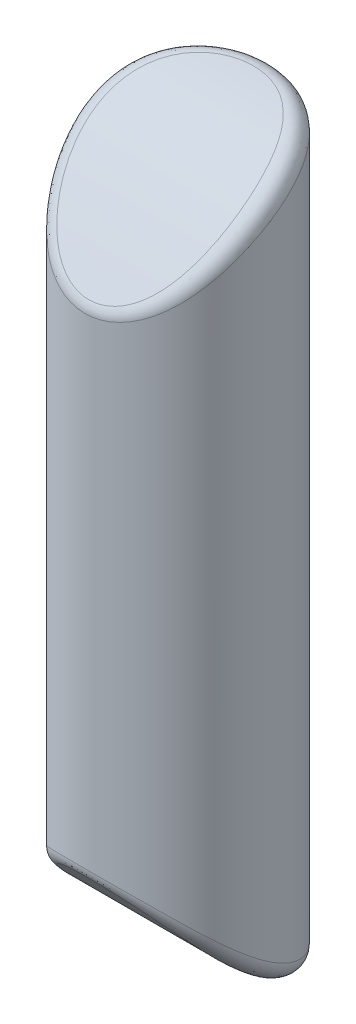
ISO-10303-21;
HEADER;
FILE_DESCRIPTION(('STEP AP214'),'2;1');
FILE_NAME('part.step','',(''),(''),'','','');
FILE_SCHEMA(('AUTOMOTIVE_DESIGN { 1 0 10303 214 1 1 1 1 }'));
ENDSEC;
DATA;
#1=APPLICATION_CONTEXT('core data for automotive mechanical design processes');
#2=APPLICATION_PROTOCOL_DEFINITION('international standard','automotive_design',2000,#1);
#3=PRODUCT_CONTEXT('',#1,'mechanical');
#4=PRODUCT('Part','Part','',(#3));
#5=PRODUCT_RELATED_PRODUCT_CATEGORY('part','',(#4));
#6=PRODUCT_DEFINITION_FORMATION('','',#4);
#7=PRODUCT_DEFINITION_CONTEXT('part definition',#1,'design');
#8=PRODUCT_DEFINITION('design','',#6,#7);
#9=PRODUCT_DEFINITION_SHAPE('','',#8);
#10=(LENGTH_UNIT() NAMED_UNIT(*) SI_UNIT(.MILLI.,.METRE.));
#11=(NAMED_UNIT(*) PLANE_ANGLE_UNIT() SI_UNIT($,.RADIAN.));
#12=(NAMED_UNIT(*) SI_UNIT($,.STERADIAN.) SOLID_ANGLE_UNIT());
#13=UNCERTAINTY_MEASURE_WITH_UNIT(LENGTH_MEASURE(1.E-05),#10,'distance_accuracy_value','');
#14=(GEOMETRIC_REPRESENTATION_CONTEXT(3) GLOBAL_UNCERTAINTY_ASSIGNED_CONTEXT((#13)) GLOBAL_UNIT_ASSIGNED_CONTEXT((#10,
#11,#12)) REPRESENTATION_CONTEXT('',''));
#15=CARTESIAN_POINT('',(0.,0.,0.));
#16=DIRECTION('',(0.,0.,1.));
#17=DIRECTION('',(1.,0.,0.));
#18=AXIS2_PLACEMENT_3D('',#15,#16,#17);
#19=CARTESIAN_POINT('',(0.,240.,0.));
#20=DIRECTION('',(0.,-1.,0.));
#21=DIRECTION('',(0.,0.,-1.));
#22=AXIS2_PLACEMENT_3D('',#19,#20,#21);
#23=CYLINDRICAL_SURFACE('',#22,60.);
#24=CARTESIAN_POINT('',(18.2376644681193,-238.684113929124,-44.9576859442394));
#25=CARTESIAN_POINT('',(22.5225589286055,-240.40904971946,-55.6165704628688));
#26=CARTESIAN_POINT('',(21.8851973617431,-228.812542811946,-55.8662522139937));
#27=CARTESIAN_POINT('',(16.9823165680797,-238.772452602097,-45.5035464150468));
#28=CARTESIAN_POINT('',(20.9580137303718,-240.451629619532,-56.2492509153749));
#29=CARTESIAN_POINT('',(20.3787798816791,-228.892128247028,-56.4563794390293));
#30=CARTESIAN_POINT('',(15.706378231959,-238.847124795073,-45.9931431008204));
#31=CARTESIAN_POINT('',(19.3693390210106,-240.4837947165,-56.815062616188));
#32=CARTESIAN_POINT('',(18.8476538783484,-228.959424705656,-56.9858560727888));
#33=CARTESIAN_POINT('',(13.122164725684,-238.973838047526,-46.8562471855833));
#34=CARTESIAN_POINT('',(16.1618835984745,-240.533947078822,-57.8081416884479));
#35=CARTESIAN_POINT('',(15.7465976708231,-229.073647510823,-57.9194865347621));
#36=CARTESIAN_POINT('',(11.8138890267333,-239.025878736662,-47.2297526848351));
#37=CARTESIAN_POINT('',(14.5420304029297,-240.552000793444,-58.2362425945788));
#38=CARTESIAN_POINT('',(14.1766668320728,-229.120573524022,-58.3236383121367));
#39=CARTESIAN_POINT('',(9.1737473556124,-239.11100893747,-47.8581464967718));
#40=CARTESIAN_POINT('',(11.2815479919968,-240.579209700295,-58.9540458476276));
#41=CARTESIAN_POINT('',(11.0084968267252,-229.197349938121,-59.0037137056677));
#42=CARTESIAN_POINT('',(7.84187866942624,-239.144096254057,-48.1130210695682));
#43=CARTESIAN_POINT('',(9.63952613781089,-240.588398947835,-59.2444083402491));
#44=CARTESIAN_POINT('',(9.41025440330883,-229.227198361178,-59.2796224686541));
#45=CARTESIAN_POINT('',(5.16365279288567,-239.19385710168,-48.502407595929));
#46=CARTESIAN_POINT('',(6.34374856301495,-240.601418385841,-59.6869887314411));
#47=CARTESIAN_POINT('',(6.19638335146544,-229.272092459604,-59.7011863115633));
#48=CARTESIAN_POINT('',(3.81729540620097,-239.210530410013,-48.6369179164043));
#49=CARTESIAN_POINT('',(4.68838663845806,-240.605263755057,-59.8396506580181));
#50=CARTESIAN_POINT('',(4.58075448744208,-229.287137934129,-59.8468396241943));
#51=CARTESIAN_POINT('',(1.08150100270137,-239.229076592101,-48.7867570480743));
#52=CARTESIAN_POINT('',(1.32823685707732,-240.609508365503,-60.0095090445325));
#53=CARTESIAN_POINT('',(1.2978012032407,-229.303873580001,-60.0090931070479));
#54=CARTESIAN_POINT('',(-0.308091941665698,-239.230524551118,-48.7986640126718));
#55=CARTESIAN_POINT('',(-0.378516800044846,-240.609813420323,-60.0230036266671));
#56=CARTESIAN_POINT('',(-0.369710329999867,-229.305180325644,-60.0219880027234));
#57=CARTESIAN_POINT('',(-3.08331354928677,-239.21764577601,-48.6943065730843));
#58=CARTESIAN_POINT('',(-3.78653911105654,-240.606905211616,-59.9047299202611));
#59=CARTESIAN_POINT('',(-3.69997625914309,-229.293558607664,-59.9089823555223));
#60=CARTESIAN_POINT('',(-4.46894212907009,-239.203318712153,-48.5780394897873));
#61=CARTESIAN_POINT('',(-5.48968645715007,-240.603688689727,-59.7728280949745));
#62=CARTESIAN_POINT('',(-5.36273055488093,-229.280629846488,-59.783078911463));
#63=CARTESIAN_POINT('',(-7.22660901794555,-239.157646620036,-48.2181012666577));
#64=CARTESIAN_POINT('',(-8.8817735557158,-240.59206871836,-59.3639606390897));
#65=CARTESIAN_POINT('',(-8.67193082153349,-229.239422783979,-59.3933796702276));
#66=CARTESIAN_POINT('',(-8.59864572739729,-239.126299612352,-47.9744153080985));
#67=CARTESIAN_POINT('',(-10.5724840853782,-240.583650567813,-59.0865394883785));
#68=CARTESIAN_POINT('',(-10.3183748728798,-229.211142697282,-59.1295678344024));
#69=CARTESIAN_POINT('',(-11.3192182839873,-239.044008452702,-47.3613244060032));
#70=CARTESIAN_POINT('',(-13.9303813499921,-240.558093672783,-58.3867812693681));
#71=CARTESIAN_POINT('',(-13.5830619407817,-229.136922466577,-58.4660159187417));
#72=CARTESIAN_POINT('',(-12.667754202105,-238.993064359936,-46.9919198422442));
#73=CARTESIAN_POINT('',(-15.5991167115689,-240.540920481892,-57.963740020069));
#74=CARTESIAN_POINT('',(-15.2013050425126,-229.090982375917,-58.0662762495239));
#75=CARTESIAN_POINT('',(-15.3364177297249,-238.86750323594,-46.1285117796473));
#76=CARTESIAN_POINT('',(-18.9094329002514,-240.492326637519,-56.9711775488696));
#77=CARTESIAN_POINT('',(-18.4037012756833,-228.977791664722,-57.1322636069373));
#78=CARTESIAN_POINT('',(-16.6564266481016,-238.792802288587,-45.6340678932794));
#79=CARTESIAN_POINT('',(-20.5520932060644,-240.460786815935,-56.4002418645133));
#80=CARTESIAN_POINT('',(-19.9877119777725,-228.910465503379,-56.597515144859));
#81=CARTESIAN_POINT('',(-19.2533515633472,-238.614713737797,-44.5250219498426));
#82=CARTESIAN_POINT('',(-23.7936535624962,-240.375979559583,-55.1131726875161));
#83=CARTESIAN_POINT('',(-23.1040218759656,-228.750016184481,-55.3984779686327));
#84=CARTESIAN_POINT('',(-20.530267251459,-238.511325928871,-43.9104190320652));
#85=CARTESIAN_POINT('',(-25.3933131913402,-240.322596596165,-54.3960576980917));
#86=CARTESIAN_POINT('',(-24.6363207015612,-228.656892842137,-54.734188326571));
#87=CARTESIAN_POINT('',(-23.0313066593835,-238.2698074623,-42.5661712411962));
#88=CARTESIAN_POINT('',(-28.5371399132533,-240.184690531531,-52.8180510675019));
#89=CARTESIAN_POINT('',(-27.6375679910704,-228.43942721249,-53.2817390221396));
#90=CARTESIAN_POINT('',(-24.2554356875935,-238.131680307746,-41.8365379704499));
#91=CARTESIAN_POINT('',(-30.0815123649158,-240.100005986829,-51.9562771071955));
#92=CARTESIAN_POINT('',(-29.1065228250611,-228.315088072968,-52.4935918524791));
#93=CARTESIAN_POINT('',(-26.6416636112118,-237.813880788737,-40.2687006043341));
#94=CARTESIAN_POINT('',(-33.1019397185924,-239.88828551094,-50.0917722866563));
#95=CARTESIAN_POINT('',(-31.9699963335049,-228.029089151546,-50.8004486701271));
#96=CARTESIAN_POINT('',(-27.803763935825,-237.634209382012,-39.4304990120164));
#97=CARTESIAN_POINT('',(-34.5775653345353,-239.761055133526,-49.0884341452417));
#98=CARTESIAN_POINT('',(-33.3645167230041,-227.86743022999,-49.895455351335));
#99=CARTESIAN_POINT('',(-30.0359972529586,-237.229962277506,-37.6702303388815));
#100=CARTESIAN_POINT('',(-37.4192351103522,-239.454540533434,-46.9661803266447));
#101=CARTESIAN_POINT('',(-36.0431967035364,-227.503757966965,-47.9951482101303));
#102=CARTESIAN_POINT('',(-31.1074376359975,-237.006282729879,-36.7500104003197));
#103=CARTESIAN_POINT('',(-38.7858965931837,-239.276088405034,-45.8495811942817));
#104=CARTESIAN_POINT('',(-37.3289251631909,-227.302550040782,-47.001824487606));
#105=CARTESIAN_POINT('',(-33.1739148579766,-236.505386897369,-34.8223732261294));
#106=CARTESIAN_POINT('',(-41.4244846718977,-238.853806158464,-43.494348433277));
#107=CARTESIAN_POINT('',(-39.8086978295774,-226.851944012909,-44.9208991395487));
#108=CARTESIAN_POINT('',(-34.1689529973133,-236.22817152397,-33.8149574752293));
#109=CARTESIAN_POINT('',(-42.6948645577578,-238.609919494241,-42.2563153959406));
#110=CARTESIAN_POINT('',(-41.0027435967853,-226.602546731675,-43.8332991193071));
#111=CARTESIAN_POINT('',(-36.0749878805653,-235.614395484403,-31.7246933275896));
#112=CARTESIAN_POINT('',(-45.1248091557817,-238.045050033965,-39.6718213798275));
#113=CARTESIAN_POINT('',(-43.289985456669,-226.050176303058,-41.5759265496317));
#114=CARTESIAN_POINT('',(-36.9860257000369,-235.277864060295,-30.641882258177));
#115=CARTESIAN_POINT('',(-46.282511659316,-237.724274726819,-38.326845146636));
#116=CARTESIAN_POINT('',(-44.3832308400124,-225.747229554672,-40.406194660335));
#117=CARTESIAN_POINT('',(-38.718595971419,-234.540663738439,-28.4132687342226));
#118=CARTESIAN_POINT('',(-48.4730561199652,-236.995779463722,-35.5458531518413));
#119=CARTESIAN_POINT('',(-46.4623151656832,-225.083163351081,-37.9971647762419));
#120=CARTESIAN_POINT('',(-39.5401315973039,-234.139997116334,-27.267468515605));
#121=CARTESIAN_POINT('',(-49.5038652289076,-236.588591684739,-34.1121386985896));
#122=CARTESIAN_POINT('',(-47.4481579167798,-224.722045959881,-36.7578692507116));
#123=CARTESIAN_POINT('',(-41.0580942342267,-233.289090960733,-24.9740698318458));
#124=CARTESIAN_POINT('',(-51.3896786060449,-235.699335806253,-31.2351946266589));
#125=CARTESIAN_POINT('',(-49.2697130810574,-223.954351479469,-34.2749216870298));
#126=CARTESIAN_POINT('',(-41.7582246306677,-232.84149404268,-23.828397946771));
#127=CARTESIAN_POINT('',(-52.2483843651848,-235.221842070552,-29.7974419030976));
#128=CARTESIAN_POINT('',(-50.1098695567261,-223.550187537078,-33.0334504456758));
#129=CARTESIAN_POINT('',(-43.069646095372,-231.88379801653,-21.5049520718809));
#130=CARTESIAN_POINT('',(-53.8322467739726,-234.179722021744,-26.8814791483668));
#131=CARTESIAN_POINT('',(-51.6835753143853,-222.684285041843,-30.5125532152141));
#132=CARTESIAN_POINT('',(-43.6809402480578,-231.373701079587,-20.3271791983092));
#133=CARTESIAN_POINT('',(-54.556158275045,-233.616381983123,-25.4063255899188));
#134=CARTESIAN_POINT('',(-52.4171282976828,-222.222548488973,-29.2331285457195));
#135=CARTESIAN_POINT('',(-44.8140926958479,-230.292111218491,-17.9522155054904));
#136=CARTESIAN_POINT('',(-55.8678538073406,-232.405436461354,-22.4387406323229));
#137=CARTESIAN_POINT('',(-53.776911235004,-221.241889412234,-26.6491223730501));
#138=CARTESIAN_POINT('',(-45.3359486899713,-229.720616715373,-16.7550241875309));
#139=CARTESIAN_POINT('',(-56.4549249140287,-231.759458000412,-20.9494231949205));
#140=CARTESIAN_POINT('',(-54.4031384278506,-220.722965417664,-25.3445402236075));
#141=CARTESIAN_POINT('',(-46.2912508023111,-228.519089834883,-14.3530710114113));
#142=CARTESIAN_POINT('',(-57.4951575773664,-230.389925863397,-17.9752065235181));
#143=CARTESIAN_POINT('',(-55.549500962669,-219.629846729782,-22.7222579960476));
#144=CARTESIAN_POINT('',(-46.7246935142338,-227.889055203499,-13.1483088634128));
#145=CARTESIAN_POINT('',(-57.9481845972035,-229.668209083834,-16.4931661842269));
#146=CARTESIAN_POINT('',(-56.0696322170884,-219.055649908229,-21.4045574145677));
#147=CARTESIAN_POINT('',(-47.5156572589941,-226.55780829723,-10.7106938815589));
#148=CARTESIAN_POINT('',(-58.7366866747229,-228.137326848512,-13.5143322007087));
#149=CARTESIAN_POINT('',(-57.0187887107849,-217.839733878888,-18.7328361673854));
#150=CARTESIAN_POINT('',(-47.8709377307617,-225.855181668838,-9.47791591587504));
#151=CARTESIAN_POINT('',(-59.0693345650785,-227.328224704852,-12.0203327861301));
#152=CARTESIAN_POINT('',(-57.4451252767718,-217.196657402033,-17.3787533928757));
#153=CARTESIAN_POINT('',(-48.4948828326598,-224.398516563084,-7.02471271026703));
#154=CARTESIAN_POINT('',(-59.610711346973,-225.649913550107,-9.07119237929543));
#155=CARTESIAN_POINT('',(-58.1938593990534,-215.860198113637,-14.6778406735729));
#156=CARTESIAN_POINT('',(-48.7635478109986,-223.644478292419,-5.80428742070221));
#157=CARTESIAN_POINT('',(-59.8202719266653,-224.782601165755,-7.61792887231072));
#158=CARTESIAN_POINT('',(-58.516257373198,-215.166815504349,-13.3310106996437));
#159=CARTESIAN_POINT('',(-49.2189780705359,-222.090900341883,-3.38244379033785));
#160=CARTESIAN_POINT('',(-60.1274903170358,-222.999257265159,-4.75943995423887));
#161=CARTESIAN_POINT('',(-59.0627736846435,-213.734543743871,-10.6517217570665));
#162=CARTESIAN_POINT('',(-49.4057086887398,-221.291341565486,-2.18103370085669));
#163=CARTESIAN_POINT('',(-60.2261763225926,-222.084834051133,-3.35542390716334));
#164=CARTESIAN_POINT('',(-59.2868504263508,-212.99563548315,-9.31926910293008));
#165=CARTESIAN_POINT('',(-49.7020903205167,-219.653183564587,0.197390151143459));
#166=CARTESIAN_POINT('',(-60.3237108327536,-220.218245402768,-0.600952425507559));
#167=CARTESIAN_POINT('',(-59.6425083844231,-211.477755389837,-6.67471767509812));
#168=CARTESIAN_POINT('',(-49.8117229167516,-218.814575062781,1.37439801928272));
#169=CARTESIAN_POINT('',(-60.3237013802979,-219.267370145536,0.748897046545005));
#170=CARTESIAN_POINT('',(-59.7740674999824,-210.69877403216,-5.36262383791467));
#171=CARTESIAN_POINT('',(-49.9438632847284,-217.277847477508,3.46480486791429));
#172=CARTESIAN_POINT('',(-60.2440502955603,-217.530750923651,3.1283261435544));
#173=CARTESIAN_POINT('',(-59.9326359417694,-209.267538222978,-3.02633609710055));
#174=CARTESIAN_POINT('',(-49.9795145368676,-216.585650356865,4.38333828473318));
#175=CARTESIAN_POINT('',(-60.1812653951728,-216.75288225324,4.16489895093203));
#176=CARTESIAN_POINT('',(-59.9754174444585,-208.621548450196,-1.99762557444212));
#177=CARTESIAN_POINT('',(-50.0072124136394,-215.18362647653,6.20129780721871));
#178=CARTESIAN_POINT('',(-60.0046912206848,-215.183706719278,6.20277251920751));
#179=CARTESIAN_POINT('',(-60.0086548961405,-207.31039433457,0.0425335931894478));
#180=CARTESIAN_POINT('',(-49.9992658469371,-214.473802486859,7.10072687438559));
#181=CARTESIAN_POINT('',(-59.8914586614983,-214.392757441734,7.20415908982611));
#182=CARTESIAN_POINT('',(-59.9991190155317,-206.645233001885,1.05398490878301));
#183=CARTESIAN_POINT('',(-49.91331074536,-212.321189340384,9.7705456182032));
#184=CARTESIAN_POINT('',(-59.4840323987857,-212.016202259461,10.1430747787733));
#185=CARTESIAN_POINT('',(-59.8959728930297,-204.623913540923,4.06235260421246));
#186=CARTESIAN_POINT('',(-49.7731501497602,-210.855724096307,11.5118383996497));
#187=CARTESIAN_POINT('',(-59.1208845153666,-210.403994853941,12.0464807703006));
#188=CARTESIAN_POINT('',(-59.7277801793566,-203.242352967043,6.03258010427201));
#189=CARTESIAN_POINT('',(-49.3412613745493,-207.881966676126,14.9189481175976));
#190=CARTESIAN_POINT('',(-58.2336068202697,-207.157107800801,15.7326391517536));
#191=CARTESIAN_POINT('',(-59.2095136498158,-200.4277532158,9.90229260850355));
#192=CARTESIAN_POINT('',(-49.0491438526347,-206.3735739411,16.5845591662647));
#193=CARTESIAN_POINT('',(-57.712287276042,-205.522668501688,17.5177095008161));
#194=CARTESIAN_POINT('',(-58.8589726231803,-198.994590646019,11.8015823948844));
#195=CARTESIAN_POINT('',(-48.3235038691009,-203.335125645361,19.8381335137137));
#196=CARTESIAN_POINT('',(-56.5269456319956,-202.252155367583,20.976217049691));
#197=CARTESIAN_POINT('',(-57.9882046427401,-196.096972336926,15.5249096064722));
#198=CARTESIAN_POINT('',(-47.8900022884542,-201.805073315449,21.4261082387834));
#199=CARTESIAN_POINT('',(-55.8654774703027,-200.615453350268,22.6525374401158));
#200=CARTESIAN_POINT('',(-57.4680027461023,-194.632521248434,17.3489580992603));
#201=CARTESIAN_POINT('',(-47.1295845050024,-199.479378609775,23.7788836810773));
#202=CARTESIAN_POINT('',(-54.7560787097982,-198.130469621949,25.1317949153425));
#203=CARTESIAN_POINT('',(-56.555501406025,-192.398877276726,20.0605469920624));
#204=CARTESIAN_POINT('',(-46.8521946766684,-198.685665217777,24.5711027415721));
#205=CARTESIAN_POINT('',(-54.3621448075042,-197.288418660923,25.9606179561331));
#206=CARTESIAN_POINT('',(-56.2226336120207,-191.635229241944,20.975218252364));
#207=CARTESIAN_POINT('',(-46.2615104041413,-197.098774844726,26.1360571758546));
#208=CARTESIAN_POINT('',(-53.53948102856,-195.609139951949,27.5936247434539));
#209=CARTESIAN_POINT('',(-55.5138124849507,-190.105841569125,22.7851132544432));
#210=CARTESIAN_POINT('',(-45.948218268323,-196.305597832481,26.9087937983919));
#211=CARTESIAN_POINT('',(-53.1109925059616,-194.771697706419,28.3982030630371));
#212=CARTESIAN_POINT('',(-55.1378619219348,-189.340102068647,23.6803382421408));
#213=CARTESIAN_POINT('',(-45.2857742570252,-194.721675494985,28.435301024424));
#214=CARTESIAN_POINT('',(-52.2193043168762,-193.103122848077,29.9841694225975));
#215=CARTESIAN_POINT('',(-54.3429291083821,-187.808453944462,25.4516919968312));
#216=CARTESIAN_POINT('',(-44.9366143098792,-193.930930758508,29.1890673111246));
#217=CARTESIAN_POINT('',(-51.7563053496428,-192.271745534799,30.7659396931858));
#218=CARTESIAN_POINT('',(-53.9239371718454,-187.042545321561,26.3278164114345));
#219=CARTESIAN_POINT('',(-44.2023380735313,-192.354181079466,30.6776447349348));
#220=CARTESIAN_POINT('',(-50.7954945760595,-190.617256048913,32.3070623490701));
#221=CARTESIAN_POINT('',(-53.0428056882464,-185.512897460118,28.060747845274));
#222=CARTESIAN_POINT('',(-43.8172244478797,-191.568175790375,31.4124572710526));
#223=CARTESIAN_POINT('',(-50.2978700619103,-189.79387602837,33.0667916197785));
#224=CARTESIAN_POINT('',(-52.5806693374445,-184.749158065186,28.917556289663));
#225=CARTESIAN_POINT('',(-43.0111320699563,-190.004063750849,32.8622663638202));
#226=CARTESIAN_POINT('',(-49.2679246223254,-188.158234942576,34.5636004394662));
#227=CARTESIAN_POINT('',(-51.6133584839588,-183.227031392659,30.6106266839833));
#228=CARTESIAN_POINT('',(-42.5902034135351,-189.225947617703,33.5772888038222));
#229=CARTESIAN_POINT('',(-48.7358196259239,-187.345682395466,35.3010662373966));
#230=CARTESIAN_POINT('',(-51.1082440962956,-182.468638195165,31.4469152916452));
#231=CARTESIAN_POINT('',(-41.7113653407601,-187.678807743,34.9884041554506));
#232=CARTESIAN_POINT('',(-47.635482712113,-185.732537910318,36.7548034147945));
#233=CARTESIAN_POINT('',(-50.0536384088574,-180.958494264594,33.0997618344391));
#234=CARTESIAN_POINT('',(-41.2534590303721,-186.909783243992,35.6844986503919));
#235=CARTESIAN_POINT('',(-47.0673948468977,-184.931640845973,37.4714326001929));
#236=CARTESIAN_POINT('',(-49.5041508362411,-180.206742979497,33.9163214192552));
#237=CARTESIAN_POINT('',(-40.29980756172,-185.38330352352,37.0573300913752));
#238=CARTESIAN_POINT('',(-45.8940315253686,-183.344016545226,38.8835111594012));
#239=CARTESIAN_POINT('',(-48.3597690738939,-178.712430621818,35.5290036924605));
#240=CARTESIAN_POINT('',(-39.8040716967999,-184.625845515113,37.7340717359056));
#241=CARTESIAN_POINT('',(-45.2888871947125,-182.556966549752,39.5793141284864));
#242=CARTESIAN_POINT('',(-47.7648860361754,-177.969867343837,36.3251313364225));
#243=CARTESIAN_POINT('',(-38.7735566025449,-183.124941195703,39.0677016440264));
#244=CARTESIAN_POINT('',(-44.0399433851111,-180.999247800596,40.9496022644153));
#245=CARTESIAN_POINT('',(-46.5282679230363,-176.496461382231,37.896166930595));
#246=CARTESIAN_POINT('',(-38.2387800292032,-182.38149393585,39.724591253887));
#247=CARTESIAN_POINT('',(-43.3962473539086,-180.228241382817,41.6244343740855));
#248=CARTESIAN_POINT('',(-45.8865360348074,-175.76561790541,38.6710763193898));
#249=CARTESIAN_POINT('',(-36.9049858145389,-180.614888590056,41.2784100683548));
#250=CARTESIAN_POINT('',(-41.8029995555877,-178.400517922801,43.2177730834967));
#251=CARTESIAN_POINT('',(-44.2859829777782,-174.026665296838,40.5064720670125));
#252=CARTESIAN_POINT('',(-36.0863519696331,-179.599788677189,42.1653550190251));
#253=CARTESIAN_POINT('',(-40.831858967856,-177.349554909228,44.1287355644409));
#254=CARTESIAN_POINT('',(-43.3036223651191,-173.025551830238,41.5561521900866));
#255=CARTESIAN_POINT('',(-34.3652511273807,-177.611236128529,43.8947478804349));
#256=CARTESIAN_POINT('',(-38.8050799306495,-175.293440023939,45.9041220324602));
#257=CARTESIAN_POINT('',(-41.2383013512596,-171.060961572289,43.6064166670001));
#258=CARTESIAN_POINT('',(-33.4627849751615,-176.637783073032,44.7371962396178));
#259=CARTESIAN_POINT('',(-37.7495662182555,-174.287255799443,46.7694989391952));
#260=CARTESIAN_POINT('',(-40.1553419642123,-170.097484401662,44.6070015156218));
#261=CARTESIAN_POINT('',(-31.5704574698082,-174.743675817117,46.3712432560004));
#262=CARTESIAN_POINT('',(-35.549826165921,-172.331667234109,48.4476214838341));
#263=CARTESIAN_POINT('',(-37.8845489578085,-168.219692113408,46.5509681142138));
#264=CARTESIAN_POINT('',(-30.5806856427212,-173.822969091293,47.1628925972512));
#265=CARTESIAN_POINT('',(-34.4057040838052,-171.381126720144,49.2613774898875));
#266=CARTESIAN_POINT('',(-36.6968227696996,-167.305328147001,47.4944068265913));
#267=CARTESIAN_POINT('',(-28.5089242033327,-172.045459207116,48.6884921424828));
#268=CARTESIAN_POINT('',(-32.0230339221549,-169.547847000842,50.8294512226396));
#269=CARTESIAN_POINT('',(-34.2107090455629,-165.537346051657,49.3153134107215));
#270=CARTESIAN_POINT('',(-27.4269592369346,-171.188639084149,49.4224576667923));
#271=CARTESIAN_POINT('',(-30.7843641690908,-168.663952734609,51.5847678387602));
#272=CARTESIAN_POINT('',(-32.9123510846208,-164.683711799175,50.1927987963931));
#273=CARTESIAN_POINT('',(-25.4365893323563,-169.747475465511,50.6561305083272));
#274=CARTESIAN_POINT('',(-28.5136245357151,-167.17747515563,52.8552874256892));
#275=CARTESIAN_POINT('',(-30.5239071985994,-163.245883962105,51.6697798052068));
#276=CARTESIAN_POINT('',(-24.5480849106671,-169.146784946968,51.1700431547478));
#277=CARTESIAN_POINT('',(-27.5036204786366,-166.558246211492,53.3846479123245));
#278=CARTESIAN_POINT('',(-29.457701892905,-162.645885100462,52.2857650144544));
#279=CARTESIAN_POINT('',(-22.7153678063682,-167.997705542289,52.1531071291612));
#280=CARTESIAN_POINT('',(-25.4260063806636,-165.374365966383,54.3973791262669));
#281=CARTESIAN_POINT('',(-27.2584413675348,-161.496983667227,53.465259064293));
#282=CARTESIAN_POINT('',(-21.7711581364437,-167.449313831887,52.6222608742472));
#283=CARTESIAN_POINT('',(-24.3581580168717,-164.809184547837,54.8812001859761));
#284=CARTESIAN_POINT('',(-26.1253897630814,-160.948078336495,54.0287707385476));
#285=CARTESIAN_POINT('',(-19.828760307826,-166.41299351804,53.5091802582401));
#286=CARTESIAN_POINT('',(-22.1665707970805,-163.7417139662,55.7959316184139));
#287=CARTESIAN_POINT('',(-23.7945123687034,-159.909855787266,55.0950276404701));
#288=CARTESIAN_POINT('',(-18.8306195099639,-165.925013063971,53.9269899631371));
#289=CARTESIAN_POINT('',(-21.0425433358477,-163.238852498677,56.2273276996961));
#290=CARTESIAN_POINT('',(-22.5967434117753,-159.420487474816,55.5978249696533));
#291=CARTESIAN_POINT('',(-16.7822887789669,-165.017141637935,54.7048041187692));
#292=CARTESIAN_POINT('',(-18.7404536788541,-162.303807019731,57.0304536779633));
#293=CARTESIAN_POINT('',(-20.1387465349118,-158.509323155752,56.5345873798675));
#294=CARTESIAN_POINT('',(-15.7321068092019,-164.597240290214,55.0648173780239));
#295=CARTESIAN_POINT('',(-17.5619473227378,-161.871115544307,57.4026157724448));
#296=CARTESIAN_POINT('',(-18.8785281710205,-158.087516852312,56.9685629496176));
#297=CARTESIAN_POINT('',(-13.7326271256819,-163.886333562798,55.6747804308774));
#298=CARTESIAN_POINT('',(-15.3214243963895,-161.138825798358,58.0332352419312));
#299=CARTESIAN_POINT('',(-16.4791525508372,-157.372923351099,57.704314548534));
#300=CARTESIAN_POINT('',(-12.7893704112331,-163.585539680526,55.9330607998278));
#301=CARTESIAN_POINT('',(-14.2657107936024,-160.828910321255,58.3004588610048));
#302=CARTESIAN_POINT('',(-15.3472444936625,-157.070366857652,58.0160670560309));
#303=CARTESIAN_POINT('',(-10.8724324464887,-163.045614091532,56.3969613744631));
#304=CARTESIAN_POINT('',(-12.1227142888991,-160.272856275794,58.7803774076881));
#305=CARTESIAN_POINT('',(-13.0469189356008,-156.527031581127,58.5762632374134));
#306=CARTESIAN_POINT('',(-9.8987540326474,-162.806476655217,56.6025864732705));
#307=CARTESIAN_POINT('',(-11.0350010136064,-160.026458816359,58.9932947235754));
#308=CARTESIAN_POINT('',(-11.8785048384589,-156.286247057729,58.8247127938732));
#309=CARTESIAN_POINT('',(-7.92759065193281,-162.394375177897,56.9571184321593));
#310=CARTESIAN_POINT('',(-8.83501666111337,-159.60204215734,59.3603243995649));
#311=CARTESIAN_POINT('',(-9.51310878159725,-155.871170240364,59.2532227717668));
#312=CARTESIAN_POINT('',(-6.93011991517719,-162.221372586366,57.106058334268));
#313=CARTESIAN_POINT('',(-7.72226794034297,-159.423780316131,59.5146459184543));
#314=CARTESIAN_POINT('',(-8.31614389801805,-155.696839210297,59.433323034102));
#315=CARTESIAN_POINT('',(-4.91823430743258,-161.94479718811,57.3442449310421));
#316=CARTESIAN_POINT('',(-5.47943569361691,-159.138934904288,59.7613579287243));
#317=CARTESIAN_POINT('',(-5.90188116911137,-155.418084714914,59.7213989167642));
#318=CARTESIAN_POINT('',(-3.90381935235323,-161.841224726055,57.4334913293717));
#319=CARTESIAN_POINT('',(-4.34881043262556,-159.032210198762,59.8538705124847));
#320=CARTESIAN_POINT('',(-4.68458322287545,-155.313661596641,59.8293741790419));
#321=CARTESIAN_POINT('',(-1.86480619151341,-161.705591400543,57.5503766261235));
#322=CARTESIAN_POINT('',(-2.07728351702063,-158.892519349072,59.9749782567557));
#323=CARTESIAN_POINT('',(-2.23776742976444,-155.176905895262,59.9707972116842));
#324=CARTESIAN_POINT('',(-0.840193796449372,-161.673650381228,57.577912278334));
#325=CARTESIAN_POINT('',(-0.935791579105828,-158.85960551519,60.0035281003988));
#326=CARTESIAN_POINT('',(-1.00823255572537,-155.144694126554,60.0041200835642));
#327=CARTESIAN_POINT('',(1.20847974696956,-161.682330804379,57.5704301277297));
#328=CARTESIAN_POINT('',(1.34602408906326,-158.868545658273,59.9957748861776));
#329=CARTESIAN_POINT('',(1.45017569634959,-155.153447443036,59.9950661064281));
#330=CARTESIAN_POINT('',(2.23254089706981,-161.722952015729,57.5354125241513));
#331=CARTESIAN_POINT('',(2.48693371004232,-158.910403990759,59.9594680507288));
#332=CARTESIAN_POINT('',(2.67904907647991,-155.194412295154,59.95268949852));
#333=CARTESIAN_POINT('',(4.27137020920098,-161.875891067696,57.403621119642));
#334=CARTESIAN_POINT('',(4.75838553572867,-159.067918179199,59.8229193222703));
#335=CARTESIAN_POINT('',(5.12564425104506,-155.348611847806,59.7932363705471));
#336=CARTESIAN_POINT('',(5.28613580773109,-161.988228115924,57.3068307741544));
#337=CARTESIAN_POINT('',(5.88949821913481,-159.183674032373,59.7225907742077));
#338=CARTESIAN_POINT('',(6.34336296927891,-155.461865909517,59.6761398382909));
#339=CARTESIAN_POINT('',(7.29771264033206,-162.282246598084,57.0536498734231));
#340=CARTESIAN_POINT('',(8.13224533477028,-159.486483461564,59.4603618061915));
#341=CARTESIAN_POINT('',(8.75725516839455,-155.758181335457,59.3699492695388));
#342=CARTESIAN_POINT('',(8.29452350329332,-162.463929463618,56.8972580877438));
#343=CARTESIAN_POINT('',(9.24441905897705,-159.673688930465,59.2983300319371));
#344=CARTESIAN_POINT('',(9.95342820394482,-155.941244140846,59.1808537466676));
#345=CARTESIAN_POINT('',(10.2571239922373,-162.891773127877,56.5292379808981));
#346=CARTESIAN_POINT('',(11.435224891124,-160.114315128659,58.9173682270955));
#347=CARTESIAN_POINT('',(12.3085487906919,-156.372134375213,58.7360849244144));
#348=CARTESIAN_POINT('',(11.2230603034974,-163.137552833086,56.3179361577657));
#349=CARTESIAN_POINT('',(12.5145061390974,-160.367554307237,58.6985936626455));
#350=CARTESIAN_POINT('',(13.4676723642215,-156.61957899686,58.4808051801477));
#351=CARTESIAN_POINT('',(13.1240866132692,-163.689633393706,55.8436699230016));
#352=CARTESIAN_POINT('',(14.6402030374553,-160.936126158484,58.2079973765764));
#353=CARTESIAN_POINT('',(15.7489039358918,-157.175077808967,57.9081619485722));
#354=CARTESIAN_POINT('',(14.0591772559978,-163.995932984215,55.5807065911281));
#355=CARTESIAN_POINT('',(15.6870397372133,-161.251712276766,57.9359580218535));
#356=CARTESIAN_POINT('',(16.8710127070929,-157.483130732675,57.5907997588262));
#357=CARTESIAN_POINT('',(15.8944050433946,-164.664177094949,55.0074368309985));
#358=CARTESIAN_POINT('',(17.7436933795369,-161.939924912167,57.3434498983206));
#359=CARTESIAN_POINT('',(19.0732860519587,-158.154744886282,56.8994067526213));
#360=CARTESIAN_POINT('',(16.7945315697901,-165.026138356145,54.6971161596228));
#361=CARTESIAN_POINT('',(18.7538536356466,-162.312858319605,57.0227187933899));
#362=CARTESIAN_POINT('',(20.153437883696,-158.518322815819,56.5253588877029));
#363=CARTESIAN_POINT('',(18.5567945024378,-165.800568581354,54.0335900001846));
#364=CARTESIAN_POINT('',(20.7341367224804,-163.110465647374,56.3375672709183));
#365=CARTESIAN_POINT('',(22.268153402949,-159.295617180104,55.7261827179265));
#366=CARTESIAN_POINT('',(19.4189211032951,-166.213050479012,53.6803735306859));
#367=CARTESIAN_POINT('',(21.7045391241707,-163.535466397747,55.9728684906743));
#368=CARTESIAN_POINT('',(23.3027053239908,-159.709346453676,55.3010413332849));
#369=CARTESIAN_POINT('',(20.8520578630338,-166.953543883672,53.046536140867));
#370=CARTESIAN_POINT('',(23.3194767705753,-164.297818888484,55.3193389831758));
#371=CARTESIAN_POINT('',(25.0224694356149,-160.451455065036,54.5387773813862));
#372=CARTESIAN_POINT('',(21.4332645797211,-167.270100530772,52.775646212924));
#373=CARTESIAN_POINT('',(23.9756031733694,-164.623951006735,55.0399420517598));
#374=CARTESIAN_POINT('',(25.7199174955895,-160.768530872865,54.2131763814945));
#375=CARTESIAN_POINT('',(22.5755012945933,-167.923707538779,52.2164073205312));
#376=CARTESIAN_POINT('',(25.2667868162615,-165.297255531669,54.463446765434));
#377=CARTESIAN_POINT('',(27.0906015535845,-161.42280807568,53.541401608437));
#378=CARTESIAN_POINT('',(23.1365358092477,-168.260753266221,51.9280623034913));
#379=CARTESIAN_POINT('',(25.9019143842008,-165.644538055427,54.1662548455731));
#380=CARTESIAN_POINT('',(27.7638429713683,-161.760004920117,53.1952324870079));
#381=CARTESIAN_POINT('',(24.7898001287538,-169.300532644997,51.0385113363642));
#382=CARTESIAN_POINT('',(27.7788161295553,-166.717257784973,53.2486453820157));
#383=CARTESIAN_POINT('',(29.74776015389,-162.799578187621,52.127982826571));
#384=CARTESIAN_POINT('',(25.8519393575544,-170.031777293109,50.4129017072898));
#385=CARTESIAN_POINT('',(28.9870688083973,-167.471234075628,52.6041942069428));
#386=CARTESIAN_POINT('',(31.0223272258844,-163.529805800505,51.3782950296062));
#387=CARTESIAN_POINT('',(27.8978926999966,-171.558963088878,49.1052050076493));
#388=CARTESIAN_POINT('',(31.3226720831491,-169.045389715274,51.2587728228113));
#389=CARTESIAN_POINT('',(33.4774712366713,-165.052685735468,49.8134833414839));
#390=CARTESIAN_POINT('',(28.8815592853,-172.355020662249,48.4230162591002));
#391=CARTESIAN_POINT('',(32.450099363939,-169.866590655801,50.5569299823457));
#392=CARTESIAN_POINT('',(34.6578711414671,-165.845450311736,48.9982417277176));
#393=CARTESIAN_POINT('',(30.7711929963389,-174.000115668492,47.0105638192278));
#394=CARTESIAN_POINT('',(34.6252350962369,-171.563427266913,49.1052979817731));
#395=CARTESIAN_POINT('',(36.9254315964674,-167.481252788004,47.3128727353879));
#396=CARTESIAN_POINT('',(31.6771592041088,-174.849153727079,46.2802995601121));
#397=CARTESIAN_POINT('',(35.6730489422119,-172.439947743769,48.3547423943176));
#398=CARTESIAN_POINT('',(38.0125910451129,-168.32429128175,46.4427447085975));
#399=CARTESIAN_POINT('',(33.2057766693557,-176.381579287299,44.958182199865));
#400=CARTESIAN_POINT('',(37.4486040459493,-174.020704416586,46.9982005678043));
#401=CARTESIAN_POINT('',(39.8469320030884,-169.843464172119,44.8699247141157));
#402=CARTESIAN_POINT('',(33.8442058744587,-177.055764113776,44.3752211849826));
#403=CARTESIAN_POINT('',(38.193976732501,-174.717250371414,46.3994942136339));
#404=CARTESIAN_POINT('',(40.6130470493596,-170.511043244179,44.1772235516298));
#405=CARTESIAN_POINT('',(35.0796858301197,-178.42590688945,43.1868207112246));
#406=CARTESIAN_POINT('',(39.6430123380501,-176.133253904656,45.1794410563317));
#407=CARTESIAN_POINT('',(42.0956229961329,-171.866073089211,42.7668728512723));
#408=CARTESIAN_POINT('',(35.6767320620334,-179.121867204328,42.5813788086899));
#409=CARTESIAN_POINT('',(40.3466394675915,-176.853070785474,44.557766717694));
#410=CARTESIAN_POINT('',(42.8120784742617,-172.55352602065,42.0492206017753));
#411=CARTESIAN_POINT('',(36.8310929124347,-180.532594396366,41.3493686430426));
#412=CARTESIAN_POINT('',(41.7141907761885,-178.312793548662,43.2929766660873));
#413=CARTESIAN_POINT('',(44.1973114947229,-173.945216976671,40.5907579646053));
#414=CARTESIAN_POINT('',(37.3883895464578,-181.247369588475,40.7227910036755));
#415=CARTESIAN_POINT('',(42.3780388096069,-179.053049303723,42.6495299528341));
#416=CARTESIAN_POINT('',(44.8660674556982,-174.649462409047,39.8499373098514));
#417=CARTESIAN_POINT('',(38.4643469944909,-182.692550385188,39.4499320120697));
#418=CARTESIAN_POINT('',(43.6673912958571,-180.55063697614,41.3424189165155));
#419=CARTESIAN_POINT('',(46.1572163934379,-176.071463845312,38.3470050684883));
#420=CARTESIAN_POINT('',(38.98300895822,-183.422955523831,38.8036512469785));
#421=CARTESIAN_POINT('',(44.2928193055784,-181.308297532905,40.6784317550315));
#422=CARTESIAN_POINT('',(46.7796107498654,-176.789219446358,37.5848941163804));
#423=CARTESIAN_POINT('',(39.9838646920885,-184.89814865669,37.4910066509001));
#424=CARTESIAN_POINT('',(45.5079973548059,-182.83972114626,39.3295492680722));
#425=CARTESIAN_POINT('',(47.9806376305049,-178.23688000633,36.039119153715));
#426=CARTESIAN_POINT('',(40.4659910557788,-185.64296019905,36.8246087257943));
#427=CARTESIAN_POINT('',(46.097575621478,-183.613817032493,38.644300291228));
#428=CARTESIAN_POINT('',(48.5591892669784,-178.966804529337,35.2554187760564));
#429=CARTESIAN_POINT('',(41.3938615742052,-187.143373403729,35.4733073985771));
#430=CARTESIAN_POINT('',(47.241224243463,-185.174719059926,37.2541693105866));
#431=CARTESIAN_POINT('',(49.6726338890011,-180.435147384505,33.6685169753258));
#432=CARTESIAN_POINT('',(41.839601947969,-187.898976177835,34.7884020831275));
#433=CARTESIAN_POINT('',(47.7951742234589,-185.961827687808,36.5489544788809));
#434=CARTESIAN_POINT('',(50.2075223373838,-181.173566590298,32.865313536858));
#435=CARTESIAN_POINT('',(42.6954252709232,-189.418525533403,33.4005795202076));
#436=CARTESIAN_POINT('',(48.8684960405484,-187.546586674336,35.1189783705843));
#437=CARTESIAN_POINT('',(51.2345103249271,-182.656389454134,31.2401777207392));
#438=CARTESIAN_POINT('',(43.1055153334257,-190.182470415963,32.6976659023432));
#439=CARTESIAN_POINT('',(49.3877410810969,-188.344522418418,34.3938825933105));
#440=CARTESIAN_POINT('',(51.726618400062,-183.40079188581,30.4182491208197));
#441=CARTESIAN_POINT('',(43.8907463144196,-191.71669934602,31.2738354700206));
#442=CARTESIAN_POINT('',(50.3925727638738,-189.949260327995,32.9236498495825));
#443=CARTESIAN_POINT('',(52.6688955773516,-184.893517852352,28.7558724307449));
#444=CARTESIAN_POINT('',(44.2658899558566,-192.486982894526,30.5529200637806));
#445=CARTESIAN_POINT('',(50.8780087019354,-190.756331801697,32.1781690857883));
#446=CARTESIAN_POINT('',(53.1190679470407,-185.641841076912,27.9154257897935));
#447=CARTESIAN_POINT('',(44.9994254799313,-194.070272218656,29.0567256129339));
#448=CARTESIAN_POINT('',(51.8392861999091,-192.418334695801,30.6285930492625));
#449=CARTESIAN_POINT('',(53.9993105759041,-187.177591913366,26.1739004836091));
#450=CARTESIAN_POINT('',(45.3560631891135,-194.883501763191,28.280523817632));
#451=CARTESIAN_POINT('',(52.3130476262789,-193.273570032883,29.82336762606));
#452=CARTESIAN_POINT('',(54.4272758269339,-187.965117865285,25.2718822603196));
#453=CARTESIAN_POINT('',(46.0314954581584,-196.512544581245,26.7078642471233));
#454=CARTESIAN_POINT('',(53.2244201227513,-194.990247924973,28.1889445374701));
#455=CARTESIAN_POINT('',(55.2377945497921,-189.539995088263,23.4474397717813));
#456=CARTESIAN_POINT('',(46.3502896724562,-197.328357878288,25.9114062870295));
#457=CARTESIAN_POINT('',(53.6618007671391,-195.851953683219,27.3593267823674));
#458=CARTESIAN_POINT('',(55.6203476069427,-190.327346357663,22.5250153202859));
#459=CARTESIAN_POINT('',(46.949943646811,-198.960458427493,24.29770823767));
#460=CARTESIAN_POINT('',(54.5003234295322,-197.579957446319,25.6745971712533));
#461=CARTESIAN_POINT('',(56.3399323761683,-191.899735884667,20.6594229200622));
#462=CARTESIAN_POINT('',(47.2307965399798,-199.77674573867,23.480464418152));
#463=CARTESIAN_POINT('',(54.9011953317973,-198.44648575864,24.8190521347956));
#464=CARTESIAN_POINT('',(56.6769558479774,-192.684773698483,19.7162512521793));
#465=CARTESIAN_POINT('',(47.7540283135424,-201.407345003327,21.8248848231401));
#466=CARTESIAN_POINT('',(55.6659743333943,-200.182177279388,23.0809940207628));
#467=CARTESIAN_POINT('',(57.3048339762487,-194.250090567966,17.8090946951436));
#468=CARTESIAN_POINT('',(47.9964077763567,-202.221656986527,20.9865493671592));
#469=CARTESIAN_POINT('',(56.0295812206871,-201.051531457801,22.1980444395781));
#470=CARTESIAN_POINT('',(57.5956893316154,-195.0303696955,16.8451101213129));
#471=CARTESIAN_POINT('',(48.4415262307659,-203.844605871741,19.2896919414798));
#472=CARTESIAN_POINT('',(56.7181048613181,-202.789562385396,20.4048024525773));
#473=CARTESIAN_POINT('',(58.1298314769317,-196.582553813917,14.8976660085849));
#474=CARTESIAN_POINT('',(48.6443302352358,-204.653249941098,18.4312057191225));
#475=CARTESIAN_POINT('',(57.0427470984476,-203.6583927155,19.4941068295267));
#476=CARTESIAN_POINT('',(58.3731962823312,-197.354470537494,13.9142413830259));
#477=CARTESIAN_POINT('',(49.0096595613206,-206.2637612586,16.6922416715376));
#478=CARTESIAN_POINT('',(57.6523103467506,-205.394828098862,17.6419055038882));
#479=CARTESIAN_POINT('',(58.8115914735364,-198.888838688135,11.9261440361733));
#480=CARTESIAN_POINT('',(49.172184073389,-207.065628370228,15.8117634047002));
#481=CARTESIAN_POINT('',(57.9368368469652,-206.262509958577,16.6999733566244));
#482=CARTESIAN_POINT('',(59.0066208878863,-199.651289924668,10.9214708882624));
#483=CARTESIAN_POINT('',(49.4554185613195,-208.659695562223,14.0287403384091));
#484=CARTESIAN_POINT('',(58.4636784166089,-207.994105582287,14.7834404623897));
#485=CARTESIAN_POINT('',(59.3465022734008,-201.163953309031,8.89110688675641));
#486=CARTESIAN_POINT('',(49.5761416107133,-209.451898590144,13.1262025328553));
#487=CARTESIAN_POINT('',(58.7055575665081,-208.858022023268,13.8084449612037));
#488=CARTESIAN_POINT('',(59.4913699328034,-201.914169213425,7.86542271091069));
#489=CARTESIAN_POINT('',(49.7739966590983,-211.023968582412,11.2987401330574));
#490=CARTESIAN_POINT('',(59.1440365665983,-210.579668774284,11.8234227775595));
#491=CARTESIAN_POINT('',(59.7287959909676,-203.399845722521,5.79298265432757));
#492=CARTESIAN_POINT('',(49.8511318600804,-211.803836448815,10.3738171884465));
#493=CARTESIAN_POINT('',(59.3401277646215,-211.4373004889,10.8130432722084));
#494=CARTESIAN_POINT('',(59.8213582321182,-204.135307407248,4.74622832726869));
#495=CARTESIAN_POINT('',(49.9838040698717,-213.691683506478,8.08528056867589));
#496=CARTESIAN_POINT('',(59.7604270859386,-213.527937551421,8.29125381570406));
#497=CARTESIAN_POINT('',(59.9805648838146,-205.911896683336,2.16182846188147));
#498=CARTESIAN_POINT('',(50.0144992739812,-214.791417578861,6.70941969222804));
#499=CARTESIAN_POINT('',(59.9554150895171,-214.750331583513,6.76504431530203));
#500=CARTESIAN_POINT('',(60.0173991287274,-206.943576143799,0.612804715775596));
#501=CARTESIAN_POINT('',(49.9727947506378,-216.948842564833,3.9128353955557));
#502=CARTESIAN_POINT('',(60.2281431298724,-217.164931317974,3.63032444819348));
#503=CARTESIAN_POINT('',(59.967353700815,-208.96123021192,-2.52567912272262));
#504=CARTESIAN_POINT('',(49.9004014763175,-218.006536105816,2.49211478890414));
#505=CARTESIAN_POINT('',(60.303896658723,-218.355855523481,2.02151216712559));
#506=CARTESIAN_POINT('',(59.8804817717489,-209.947207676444,-4.1151366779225));
#507=CARTESIAN_POINT('',(49.6439601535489,-220.067654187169,-0.388098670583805));
#508=CARTESIAN_POINT('',(60.3191276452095,-220.691948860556,-1.2782722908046));
#509=CARTESIAN_POINT('',(59.5727521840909,-211.862647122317,-7.32710533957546));
#510=CARTESIAN_POINT('',(49.4600513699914,-221.071144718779,-1.84754099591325));
#511=CARTESIAN_POINT('',(60.2566318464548,-221.835170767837,-2.96861042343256));
#512=CARTESIAN_POINT('',(59.3520616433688,-212.792178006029,-8.94957278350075));
#513=CARTESIAN_POINT('',(48.9715298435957,-223.01345620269,-4.79880216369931));
#514=CARTESIAN_POINT('',(59.973591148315,-224.05975140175,-6.42897154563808));
#515=CARTESIAN_POINT('',(58.7658358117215,-214.585965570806,-12.2202713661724));
#516=CARTESIAN_POINT('',(48.6669377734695,-223.952288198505,-6.29061541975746));
#517=CARTESIAN_POINT('',(59.7510086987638,-225.138324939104,-8.19719812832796));
#518=CARTESIAN_POINT('',(58.4003253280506,-215.450233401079,-13.8684980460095));
#519=CARTESIAN_POINT('',(47.9880729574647,-225.608208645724,-9.05162596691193));
#520=CARTESIAN_POINT('',(59.1759253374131,-227.043899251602,-11.5056817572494));
#521=CARTESIAN_POINT('',(57.5856875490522,-216.970398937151,-16.9100869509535));
#522=CARTESIAN_POINT('',(47.6329932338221,-226.336624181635,-10.3178733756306));
#523=CARTESIAN_POINT('',(58.8486674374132,-227.882807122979,-13.0373589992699));
#524=CARTESIAN_POINT('',(57.1595918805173,-217.637408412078,-18.3016283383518));
#525=CARTESIAN_POINT('',(46.8276204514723,-227.733639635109,-12.8545688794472));
#526=CARTESIAN_POINT('',(58.054345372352,-229.490247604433,-16.1330150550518));
#527=CARTESIAN_POINT('',(56.19314454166,-218.913926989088,-21.0831040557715));
#528=CARTESIAN_POINT('',(46.3773366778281,-228.402245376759,-14.1250165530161));
#529=CARTESIAN_POINT('',(57.5867927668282,-230.256589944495,-17.694285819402));
#530=CARTESIAN_POINT('',(55.6528040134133,-219.523441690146,-22.4730385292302));
#531=CARTESIAN_POINT('',(45.378722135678,-229.674351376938,-16.6576769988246));
#532=CARTESIAN_POINT('',(56.5029848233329,-231.707418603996,-20.8287558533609));
#533=CARTESIAN_POINT('',(54.454466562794,-220.680964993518,-25.2384796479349));
#534=CARTESIAN_POINT('',(44.8304250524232,-230.277873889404,-17.9198924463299));
#535=CARTESIAN_POINT('',(55.8869019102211,-232.389772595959,-22.3986261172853));
#536=CARTESIAN_POINT('',(53.7965100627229,-221.228994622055,-26.6139910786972));
#537=CARTESIAN_POINT('',(43.6344369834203,-231.416702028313,-20.4226887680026));
#538=CARTESIAN_POINT('',(54.5018454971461,-233.664543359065,-25.5261324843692));
#539=CARTESIAN_POINT('',(52.3613243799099,-222.261522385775,-29.3370070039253));
#540=CARTESIAN_POINT('',(42.9867448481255,-231.952006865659,-21.6632693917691));
#541=CARTESIAN_POINT('',(53.7337076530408,-234.255053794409,-27.0801191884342));
#542=CARTESIAN_POINT('',(51.5840938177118,-222.74601978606,-30.6845111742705));
#543=CARTESIAN_POINT('',(41.5902645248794,-232.954944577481,-24.1122400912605));
#544=CARTESIAN_POINT('',(52.0434638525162,-235.34403671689,-30.1539804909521));
#545=CARTESIAN_POINT('',(49.9083174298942,-223.652687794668,-33.3411906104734));
#546=CARTESIAN_POINT('',(40.8411208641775,-233.422326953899,-25.3204982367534));
#547=CARTESIAN_POINT('',(51.1223350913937,-235.840677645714,-31.6701036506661));
#548=CARTESIAN_POINT('',(49.0093450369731,-224.074627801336,-34.6502104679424));
#549=CARTESIAN_POINT('',(39.2464560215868,-234.288214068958,-27.6848783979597));
#550=CARTESIAN_POINT('',(49.1361120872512,-236.740403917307,-34.6349414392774));
#551=CARTESIAN_POINT('',(47.0957472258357,-224.855669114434,-37.2094530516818));
#552=CARTESIAN_POINT('',(38.4009333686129,-234.686717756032,-28.8409996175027));
#553=CARTESIAN_POINT('',(48.072994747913,-237.14251188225,-36.0805595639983));
#554=CARTESIAN_POINT('',(46.0811200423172,-225.214769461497,-38.4596748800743));
#555=CARTESIAN_POINT('',(36.6181598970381,-235.418256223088,-31.086776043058));
#556=CARTESIAN_POINT('',(45.8154635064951,-237.859343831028,-38.8801567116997));
#557=CARTESIAN_POINT('',(43.9417918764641,-225.873632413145,-40.8868772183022));
#558=CARTESIAN_POINT('',(35.6808845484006,-235.751273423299,-32.1764133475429));
#559=CARTESIAN_POINT('',(44.6231482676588,-238.173546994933,-40.2318201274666));
#560=CARTESIAN_POINT('',(42.8170614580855,-226.173379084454,-42.0638380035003));
#561=CARTESIAN_POINT('',(33.7212718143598,-236.356841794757,-34.2756207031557));
#562=CARTESIAN_POINT('',(42.1234151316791,-238.724345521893,-42.8232171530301));
#563=CARTESIAN_POINT('',(40.4655261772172,-226.718314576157,-44.3306675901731));
#564=CARTESIAN_POINT('',(32.6989369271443,-236.629394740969,-35.2851931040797));
#565=CARTESIAN_POINT('',(40.8179660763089,-238.960808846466,-44.0615874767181));
#566=CARTESIAN_POINT('',(39.2387243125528,-226.963504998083,-45.4205389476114));
#567=CARTESIAN_POINT('',(30.6390552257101,-237.106036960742,-37.1563299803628));
#568=CARTESIAN_POINT('',(38.1880930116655,-239.356390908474,-46.3432926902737));
#569=CARTESIAN_POINT('',(36.7668662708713,-227.392283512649,-47.4404291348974));
#570=CARTESIAN_POINT('',(29.6059035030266,-237.313200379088,-38.0230993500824));
#571=CARTESIAN_POINT('',(36.8708645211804,-239.519257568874,-47.393122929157));
#572=CARTESIAN_POINT('',(35.5270842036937,-227.578637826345,-48.3760710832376));
#573=CARTESIAN_POINT('',(27.4780845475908,-237.685429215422,-39.6674625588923));
#574=CARTESIAN_POINT('',(34.1634964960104,-239.7976744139,-49.3725786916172));
#575=CARTESIAN_POINT('',(32.9737014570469,-227.913514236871,-50.1512975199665));
#576=CARTESIAN_POINT('',(26.3834201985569,-237.85049660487,-40.4450605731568));
#577=CARTESIAN_POINT('',(32.7741880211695,-239.913375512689,-50.3023448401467));
#578=CARTESIAN_POINT('',(31.6601042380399,-228.062038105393,-50.9908865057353));
#579=CARTESIAN_POINT('',(24.1399906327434,-238.144426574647,-41.9044875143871));
#580=CARTESIAN_POINT('',(29.9354897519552,-240.107750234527,-52.0367060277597));
#581=CARTESIAN_POINT('',(28.9679887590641,-228.326562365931,-52.566992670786));
#582=CARTESIAN_POINT('',(22.9912247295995,-238.273288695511,-42.5863152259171));
#583=CARTESIAN_POINT('',(28.4864272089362,-240.186583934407,-52.8418191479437));
#584=CARTESIAN_POINT('',(27.5894696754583,-228.442562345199,-53.3035085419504));
#585=CARTESIAN_POINT('',(20.6472853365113,-238.50040273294,-43.84887875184));
#586=CARTESIAN_POINT('',(25.5398623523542,-240.316487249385,-54.3241242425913));
#587=CARTESIAN_POINT('',(24.7767424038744,-228.64705689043,-54.6676905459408));
#588=CARTESIAN_POINT('',(19.452110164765,-238.598653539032,-44.4296108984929));
#589=CARTESIAN_POINT('',(24.0421997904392,-240.367691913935,-55.0020487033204));
#590=CARTESIAN_POINT('',(23.3425321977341,-228.735550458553,-55.2953527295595));
#591=CARTESIAN_POINT('',(18.2376644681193,-238.684113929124,-44.9576859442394));
#592=CARTESIAN_POINT('',(22.5225589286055,-240.40904971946,-55.6165704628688));
#593=CARTESIAN_POINT('',(21.8851973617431,-228.812542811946,-55.8662522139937));
#594=(BOUNDED_SURFACE() B_SPLINE_SURFACE(3,2,((#24,#25,#26),(#27,#28,#29),(#30,#31,#32),(#33,
#34,#35),(#36,#37,#38),(#39,#40,#41),(#42,#43,#44),(#45,#46,#47),(#48,#49,#50),(#51,#52,#53),
(#54,#55,#56),(#57,#58,#59),(#60,#61,#62),(#63,#64,#65),(#66,#67,#68),(#69,#70,#71),(#72,#73,
#74),(#75,#76,#77),(#78,#79,#80),(#81,#82,#83),(#84,#85,#86),(#87,#88,#89),(#90,#91,#92),(#93,
#94,#95),(#96,#97,#98),(#99,#100,#101),(#102,#103,#104),(#105,#106,#107),(#108,#109,#110),(#111,
#112,#113),(#114,#115,#116),(#117,#118,#119),(#120,#121,#122),(#123,#124,#125),(#126,#127,#128),
(#129,#130,#131),(#132,#133,#134),(#135,#136,#137),(#138,#139,#140),(#141,#142,#143),(#144,#145,
#146),(#147,#148,#149),(#150,#151,#152),(#153,#154,#155),(#156,#157,#158),(#159,#160,#161),
(#162,#163,#164),(#165,#166,#167),(#168,#169,#170),(#171,#172,#173),(#174,#175,#176),(#177,#178,
#179),(#180,#181,#182),(#183,#184,#185),(#186,#187,#188),(#189,#190,#191),(#192,#193,#194),
(#195,#196,#197),(#198,#199,#200),(#201,#202,#203),(#204,#205,#206),(#207,#208,#209),(#210,#211,
#212),(#213,#214,#215),(#216,#217,#218),(#219,#220,#221),(#222,#223,#224),(#225,#226,#227),
(#228,#229,#230),(#231,#232,#233),(#234,#235,#236),(#237,#238,#239),(#240,#241,#242),(#243,#244,
#245),(#246,#247,#248),(#249,#250,#251),(#252,#253,#254),(#255,#256,#257),(#258,#259,#260),
(#261,#262,#263),(#264,#265,#266),(#267,#268,#269),(#270,#271,#272),(#273,#274,#275),(#276,#277,
#278),(#279,#280,#281),(#282,#283,#284),(#285,#286,#287),(#288,#289,#290),(#291,#292,#293),
(#294,#295,#296),(#297,#298,#299),(#300,#301,#302),(#303,#304,#305),(#306,#307,#308),(#309,#310,
#311),(#312,#313,#314),(#315,#316,#317),(#318,#319,#320),(#321,#322,#323),(#324,#325,#326),
(#327,#328,#329),(#330,#331,#332),(#333,#334,#335),(#336,#337,#338),(#339,#340,#341),(#342,#343,
#344),(#345,#346,#347),(#348,#349,#350),(#351,#352,#353),(#354,#355,#356),(#357,#358,#359),
(#360,#361,#362),(#363,#364,#365),(#366,#367,#368),(#369,#370,#371),(#372,#373,#374),(#375,#376,
#377),(#378,#379,#380),(#381,#382,#383),(#384,#385,#386),(#387,#388,#389),(#390,#391,#392),
(#393,#394,#395),(#396,#397,#398),(#399,#400,#401),(#402,#403,#404),(#405,#406,#407),(#408,#409,
#410),(#411,#412,#413),(#414,#415,#416),(#417,#418,#419),(#420,#421,#422),(#423,#424,#425),
(#426,#427,#428),(#429,#430,#431),(#432,#433,#434),(#435,#436,#437),(#438,#439,#440),(#441,#442,
#443),(#444,#445,#446),(#447,#448,#449),(#450,#451,#452),(#453,#454,#455),(#456,#457,#458),
(#459,#460,#461),(#462,#463,#464),(#465,#466,#467),(#468,#469,#470),(#471,#472,#473),(#474,#475,
#476),(#477,#478,#479),(#480,#481,#482),(#483,#484,#485),(#486,#487,#488),(#489,#490,#491),
(#492,#493,#494),(#495,#496,#497),(#498,#499,#500),(#501,#502,#503),(#504,#505,#506),(#507,#508,
#509),(#510,#511,#512),(#513,#514,#515),(#516,#517,#518),(#519,#520,#521),(#522,#523,#524),
(#525,#526,#527),(#528,#529,#530),(#531,#532,#533),(#534,#535,#536),(#537,#538,#539),(#540,#541,
#542),(#543,#544,#545),(#546,#547,#548),(#549,#550,#551),(#552,#553,#554),(#555,#556,#557),
(#558,#559,#560),(#561,#562,#563),(#564,#565,#566),(#567,#568,#569),(#570,#571,#572),(#573,#574,
#575),(#576,#577,#578),(#579,#580,#581),(#582,#583,#584),(#585,#586,#587),(#588,#589,#590),
(#591,#592,#593)),.UNSPECIFIED.,.T.,.F.,.F.) B_SPLINE_SURFACE_WITH_KNOTS((4,2,2,2,2,2,2,2,2,2,2,
2,2,2,2,2,2,2,2,2,2,2,2,2,2,2,2,2,2,2,2,2,2,2,2,2,2,2,2,2,2,2,2,2,2,2,2,2,2,2,2,2,2,2,2,2,2,2,2,
2,2,2,2,2,2,2,2,2,2,2,2,2,2,2,2,2,2,2,2,2,2,2,2,2,2,2,2,2,2,2,2,2,2,2,4),(3,3),(0.,
4.05062758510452,8.10132145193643,12.1524843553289,16.2037022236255,20.3676925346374,
24.5317698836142,28.6963316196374,32.8608807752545,37.0403068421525,41.2197628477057,
45.3987975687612,49.5777359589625,53.6790456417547,57.7802855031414,61.8795091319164,
65.9785873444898,69.9127677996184,73.8468116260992,77.7809566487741,81.7152532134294,
85.7507849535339,89.7863004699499,93.8235216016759,97.861706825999,101.082506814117,
104.30280382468,110.745577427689,117.204940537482,123.663350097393,127.004915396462,
130.346265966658,133.688370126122,137.030226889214,140.36748378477,143.704460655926,
147.040620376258,150.376553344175,155.057275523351,159.737950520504,164.413880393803,
169.088564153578,172.651755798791,176.21475491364,179.774674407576,183.33405083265,
186.402924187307,189.471512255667,192.538308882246,195.605120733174,198.677059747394,
201.748988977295,204.82174130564,207.894557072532,210.949503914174,214.004386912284,
217.060190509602,220.116778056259,222.26255945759,224.407857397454,228.699365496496,
232.998760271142,237.298205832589,240.564821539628,243.831793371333,247.100234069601,
250.368577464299,253.642810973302,256.917384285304,260.191302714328,263.464965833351,
266.901025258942,270.337116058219,273.773827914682,277.210487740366,280.641453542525,
284.072488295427,287.502449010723,290.932157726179,295.886410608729,300.84035337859,
305.788122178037,310.735043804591,314.883180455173,319.030912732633,323.177222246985,
327.323579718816,331.484860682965,335.646205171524,339.808665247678,343.971003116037,
347.889643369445,351.8081000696,355.726606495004,359.645255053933),(0.,1.),
.UNSPECIFIED.) GEOMETRIC_REPRESENTATION_ITEM() RATIONAL_B_SPLINE_SURFACE(((1.,0.652400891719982,
1.),(1.,0.653728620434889,1.),(1.,0.654970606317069,1.),(1.,0.657213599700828,1.),(1.,
0.658214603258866,1.),(1.,0.659924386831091,1.),(1.,0.660633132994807,1.),(1.,0.661724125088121,
1.),(1.,0.662106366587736,1.),(1.,0.662532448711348,1.),(1.,0.662566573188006,1.),(1.,
0.662269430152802,1.),(1.,0.661938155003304,1.),(1.,0.66092627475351,1.),(1.,0.660245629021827,
1.),(1.,0.658569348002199,1.),(1.,0.65757371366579,1.),(1.,0.655316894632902,1.),(1.,
0.65405477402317,1.),(1.,0.651341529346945,1.),(1.,0.649890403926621,1.),(1.,0.646894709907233,
1.),(1.,0.645350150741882,1.),(1.,0.64228317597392,1.),(1.,0.640760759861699,1.),(1.,
0.637897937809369,1.),(1.,0.636554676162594,1.),(1.,0.634153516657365,1.),(1.,0.633095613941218,
1.),(1.,0.631401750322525,1.),(1.,0.630765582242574,1.),(1.,0.630037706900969,1.),(1.,
0.629945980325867,1.),(1.,0.630393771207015,1.),(1.,0.630908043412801,1.),(1.,0.632577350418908,
1.),(1.,0.633732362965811,1.),(1.,0.63669531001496,1.),(1.,0.638503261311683,1.),(1.,
0.64274579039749,1.),(1.,0.645180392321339,1.),(1.,0.650687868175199,1.),(1.,0.653775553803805,
1.),(1.,0.660461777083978,1.),(1.,0.66406031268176,1.),(1.,0.67167087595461,1.),(1.,
0.675683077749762,1.),(1.,0.684020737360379,1.),(1.,0.688346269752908,1.),(1.,0.696318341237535,
1.),(1.,0.699925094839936,1.),(1.,0.707235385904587,1.),(1.,0.710938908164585,1.),(1.,
0.722142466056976,1.),(1.,0.72973304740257,1.),(1.,0.744933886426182,1.),(1.,0.752544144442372,
1.),(1.,0.767604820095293,1.),(1.,0.775055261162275,1.),(1.,0.786156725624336,1.),(1.,
0.789906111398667,1.),(1.,0.797323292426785,1.),(1.,0.800991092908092,1.),(1.,0.808236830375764,
1.),(1.,0.811814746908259,1.),(1.,0.8188722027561,1.),(1.,0.822351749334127,1.),(1.,
0.829201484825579,1.),(1.,0.832571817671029,1.),(1.,0.839201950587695,1.),(1.,0.842461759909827,
1.),(1.,0.848864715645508,1.),(1.,0.852007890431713,1.),(1.,0.858172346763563,1.),(1.,
0.861193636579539,1.),(1.,0.868301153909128,1.),(1.,0.872325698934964,1.),(1.,0.880104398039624,
1.),(1.,0.8838585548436,1.),(1.,0.891070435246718,1.),(1.,0.894528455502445,1.),(1.,
0.901124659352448,1.),(1.,0.904262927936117,1.),(1.,0.909483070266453,1.),(1.,0.911638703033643,
1.),(1.,0.91572955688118,1.),(1.,0.917664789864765,1.),(1.,0.921295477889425,1.),(1.,
0.922991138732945,1.),(1.,0.926125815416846,1.),(1.,0.927564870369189,1.),(1.,0.929988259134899,
1.),(1.,0.931007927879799,1.),(1.,0.93283133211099,1.),(1.,0.933635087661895,1.),(1.,
0.935016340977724,1.),(1.,0.935593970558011,1.),(1.,0.936515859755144,1.),(1.,0.936860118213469,
1.),(1.,0.937310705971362,1.),(1.,0.937416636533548,1.),(1.,0.937387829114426,1.),(1.,
0.937253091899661,1.),(1.,0.936744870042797,1.),(1.,0.936371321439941,1.),(1.,0.935390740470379,
1.),(1.,0.93478370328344,1.),(1.,0.933348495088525,1.),(1.,0.932521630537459,1.),(1.,
0.930655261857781,1.),(1.,0.929615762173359,1.),(1.,0.927335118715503,1.),(1.,0.926093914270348,
1.),(1.,0.923421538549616,1.),(1.,0.921990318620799,1.),(1.,0.919403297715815,1.),(1.,
0.91829250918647,1.),(1.,0.915987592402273,1.),(1.,0.914793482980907,1.),(1.,0.91109046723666,
1.),(1.,0.908461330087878,1.),(1.,0.902907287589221,1.),(1.,0.899981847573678,1.),(1.,
0.893863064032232,1.),(1.,0.890669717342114,1.),(1.,0.884833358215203,1.),(1.,0.882242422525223,
1.),(1.,0.876925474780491,1.),(1.,0.874199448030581,1.),(1.,0.868618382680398,1.),(1.,
0.865763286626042,1.),(1.,0.859931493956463,1.),(1.,0.856954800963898,1.),(1.,0.850879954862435,
1.),(1.,0.847781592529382,1.),(1.,0.841473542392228,1.),(1.,0.838263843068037,1.),(1.,
0.831739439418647,1.),(1.,0.828424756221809,1.),(1.,0.821695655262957,1.),(1.,0.818281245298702,
1.),(1.,0.811186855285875,1.),(1.,0.807502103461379,1.),(1.,0.800037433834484,1.),(1.,
0.796257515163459,1.),(1.,0.788611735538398,1.),(1.,0.784745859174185,1.),(1.,0.776941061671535,
1.),(1.,0.773002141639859,1.),(1.,0.765072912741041,1.),(1.,0.761082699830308,1.),(1.,
0.753063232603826,1.),(1.,0.74903397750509,1.),(1.,0.740961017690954,1.),(1.,0.736917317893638,
1.),(1.,0.728843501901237,1.),(1.,0.724813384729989,1.),(1.,0.715019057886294,1.),(1.,
0.709280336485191,1.),(1.,0.69803143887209,1.),(1.,0.692521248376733,1.),(1.,0.681894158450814,
1.),(1.,0.676776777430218,1.),(1.,0.66710859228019,1.),(1.,0.662557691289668,1.),(1.,
0.654880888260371,1.),(1.,0.65164354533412,1.),(1.,0.645792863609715,1.),(1.,0.643179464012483,
1.),(1.,0.638648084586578,1.),(1.,0.636729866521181,1.),(1.,0.633619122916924,1.),(1.,
0.632426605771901,1.),(1.,0.630748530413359,1.),(1.,0.630265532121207,1.),(1.,0.629950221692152,
1.),(1.,0.630117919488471,1.),(1.,0.630999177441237,1.),(1.,0.631712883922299,1.),(1.,
0.633554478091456,1.),(1.,0.634682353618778,1.),(1.,0.637135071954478,1.),(1.,0.638444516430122,
1.),(1.,0.64118585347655,1.),(1.,0.642617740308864,1.),(1.,0.645495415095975,1.),(1.,
0.646941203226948,1.),(1.,0.649751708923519,1.),(1.,0.651116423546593,1.),(1.,0.652400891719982,1.))) REPRESENTATION_ITEM('') SURFACE());
#595=CARTESIAN_POINT('',(21.8851973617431,-228.812542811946,-55.8662522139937));
#596=CARTESIAN_POINT('',(20.3787798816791,-228.892128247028,-56.4563794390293));
#597=CARTESIAN_POINT('',(18.8476538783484,-228.959424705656,-56.9858560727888));
#598=CARTESIAN_POINT('',(15.7465976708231,-229.073647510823,-57.9194865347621));
#599=CARTESIAN_POINT('',(14.1766668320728,-229.120573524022,-58.3236383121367));
#600=CARTESIAN_POINT('',(11.0084968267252,-229.197349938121,-59.0037137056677));
#601=CARTESIAN_POINT('',(9.41025440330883,-229.227198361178,-59.2796224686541));
#602=CARTESIAN_POINT('',(6.19638335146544,-229.272092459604,-59.7011863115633));
#603=CARTESIAN_POINT('',(4.58075448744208,-229.287137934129,-59.8468396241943));
#604=CARTESIAN_POINT('',(1.2978012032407,-229.303873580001,-60.0090931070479));
#605=CARTESIAN_POINT('',(-0.369710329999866,-229.305180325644,-60.0219880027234));
#606=CARTESIAN_POINT('',(-3.69997625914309,-229.293558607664,-59.9089823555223));
#607=CARTESIAN_POINT('',(-5.36273055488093,-229.280629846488,-59.783078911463));
#608=CARTESIAN_POINT('',(-8.67193082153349,-229.239422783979,-59.3933796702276));
#609=CARTESIAN_POINT('',(-10.3183748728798,-229.211142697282,-59.1295678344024));
#610=CARTESIAN_POINT('',(-13.5830619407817,-229.136922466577,-58.4660159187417));
#611=CARTESIAN_POINT('',(-15.2013050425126,-229.090982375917,-58.0662762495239));
#612=CARTESIAN_POINT('',(-18.4037012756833,-228.977791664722,-57.1322636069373));
#613=CARTESIAN_POINT('',(-19.9877119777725,-228.910465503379,-56.597515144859));
#614=CARTESIAN_POINT('',(-23.1040218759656,-228.750016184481,-55.3984779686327));
#615=CARTESIAN_POINT('',(-24.6363207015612,-228.656892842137,-54.734188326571));
#616=CARTESIAN_POINT('',(-27.6375679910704,-228.43942721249,-53.2817390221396));
#617=CARTESIAN_POINT('',(-29.1065228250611,-228.315088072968,-52.4935918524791));
#618=CARTESIAN_POINT('',(-31.9699963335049,-228.029089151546,-50.8004486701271));
#619=CARTESIAN_POINT('',(-33.3645167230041,-227.86743022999,-49.895455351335));
#620=CARTESIAN_POINT('',(-36.0431967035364,-227.503757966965,-47.9951482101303));
#621=CARTESIAN_POINT('',(-37.3289251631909,-227.302550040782,-47.001824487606));
#622=CARTESIAN_POINT('',(-39.8086978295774,-226.851944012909,-44.9208991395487));
#623=CARTESIAN_POINT('',(-41.0027435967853,-226.602546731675,-43.8332991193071));
#624=CARTESIAN_POINT('',(-43.289985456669,-226.050176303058,-41.5759265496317));
#625=CARTESIAN_POINT('',(-44.3832308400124,-225.747229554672,-40.406194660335));
#626=CARTESIAN_POINT('',(-46.4623151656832,-225.083163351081,-37.997164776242));
#627=CARTESIAN_POINT('',(-47.4481579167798,-224.722045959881,-36.7578692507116));
#628=CARTESIAN_POINT('',(-49.2697130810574,-223.954351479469,-34.2749216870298));
#629=CARTESIAN_POINT('',(-50.1098695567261,-223.550187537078,-33.0334504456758));
#630=CARTESIAN_POINT('',(-51.6835753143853,-222.684285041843,-30.5125532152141));
#631=CARTESIAN_POINT('',(-52.4171282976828,-222.222548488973,-29.2331285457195));
#632=CARTESIAN_POINT('',(-53.776911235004,-221.241889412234,-26.6491223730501));
#633=CARTESIAN_POINT('',(-54.4031384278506,-220.722965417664,-25.3445402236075));
#634=CARTESIAN_POINT('',(-55.5495009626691,-219.629846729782,-22.7222579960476));
#635=CARTESIAN_POINT('',(-56.0696322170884,-219.055649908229,-21.4045574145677));
#636=CARTESIAN_POINT('',(-57.0187887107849,-217.839733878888,-18.7328361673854));
#637=CARTESIAN_POINT('',(-57.4451252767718,-217.196657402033,-17.3787533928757));
#638=CARTESIAN_POINT('',(-58.1938593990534,-215.860198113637,-14.6778406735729));
#639=CARTESIAN_POINT('',(-58.516257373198,-215.166815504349,-13.3310106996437));
#640=CARTESIAN_POINT('',(-59.0627736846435,-213.734543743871,-10.6517217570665));
#641=CARTESIAN_POINT('',(-59.2868504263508,-212.99563548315,-9.31926910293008));
#642=CARTESIAN_POINT('',(-59.6425083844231,-211.477755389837,-6.67471767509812));
#643=CARTESIAN_POINT('',(-59.7740674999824,-210.698774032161,-5.36262383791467));
#644=CARTESIAN_POINT('',(-59.9326359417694,-209.267538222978,-3.02633609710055));
#645=CARTESIAN_POINT('',(-59.9754174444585,-208.621548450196,-1.99762557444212));
#646=CARTESIAN_POINT('',(-60.0086548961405,-207.31039433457,0.0425335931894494));
#647=CARTESIAN_POINT('',(-59.9991190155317,-206.645233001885,1.05398490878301));
#648=CARTESIAN_POINT('',(-59.8959728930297,-204.623913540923,4.06235260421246));
#649=CARTESIAN_POINT('',(-59.7277801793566,-203.242352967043,6.03258010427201));
#650=CARTESIAN_POINT('',(-59.2095136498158,-200.4277532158,9.90229260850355));
#651=CARTESIAN_POINT('',(-58.8589726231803,-198.994590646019,11.8015823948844));
#652=CARTESIAN_POINT('',(-57.9882046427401,-196.096972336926,15.5249096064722));
#653=CARTESIAN_POINT('',(-57.4680027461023,-194.632521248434,17.3489580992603));
#654=CARTESIAN_POINT('',(-56.555501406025,-192.398877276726,20.0605469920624));
#655=CARTESIAN_POINT('',(-56.2226336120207,-191.635229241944,20.975218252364));
#656=CARTESIAN_POINT('',(-55.5138124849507,-190.105841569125,22.7851132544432));
#657=CARTESIAN_POINT('',(-55.1378619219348,-189.340102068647,23.6803382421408));
#658=CARTESIAN_POINT('',(-54.3429291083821,-187.808453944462,25.4516919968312));
#659=CARTESIAN_POINT('',(-53.9239371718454,-187.042545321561,26.3278164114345));
#660=CARTESIAN_POINT('',(-53.0428056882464,-185.512897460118,28.060747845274));
#661=CARTESIAN_POINT('',(-52.5806693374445,-184.749158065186,28.917556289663));
#662=CARTESIAN_POINT('',(-51.6133584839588,-183.227031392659,30.6106266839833));
#663=CARTESIAN_POINT('',(-51.1082440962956,-182.468638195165,31.4469152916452));
#664=CARTESIAN_POINT('',(-50.0536384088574,-180.958494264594,33.0997618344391));
#665=CARTESIAN_POINT('',(-49.5041508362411,-180.206742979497,33.9163214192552));
#666=CARTESIAN_POINT('',(-48.3597690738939,-178.712430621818,35.5290036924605));
#667=CARTESIAN_POINT('',(-47.7648860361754,-177.969867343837,36.3251313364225));
#668=CARTESIAN_POINT('',(-46.5282679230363,-176.496461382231,37.896166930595));
#669=CARTESIAN_POINT('',(-45.8865360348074,-175.76561790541,38.6710763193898));
#670=CARTESIAN_POINT('',(-44.2859829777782,-174.026665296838,40.5064720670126));
#671=CARTESIAN_POINT('',(-43.3036223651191,-173.025551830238,41.5561521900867));
#672=CARTESIAN_POINT('',(-41.2383013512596,-171.060961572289,43.6064166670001));
#673=CARTESIAN_POINT('',(-40.1553419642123,-170.097484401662,44.6070015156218));
#674=CARTESIAN_POINT('',(-37.8845489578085,-168.219692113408,46.5509681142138));
#675=CARTESIAN_POINT('',(-36.6968227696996,-167.305328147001,47.4944068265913));
#676=CARTESIAN_POINT('',(-34.2107090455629,-165.537346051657,49.3153134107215));
#677=CARTESIAN_POINT('',(-32.9123510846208,-164.683711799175,50.1927987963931));
#678=CARTESIAN_POINT('',(-30.5239071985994,-163.245883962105,51.6697798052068));
#679=CARTESIAN_POINT('',(-29.457701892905,-162.645885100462,52.2857650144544));
#680=CARTESIAN_POINT('',(-27.2584413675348,-161.496983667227,53.465259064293));
#681=CARTESIAN_POINT('',(-26.1253897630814,-160.948078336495,54.0287707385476));
#682=CARTESIAN_POINT('',(-23.7945123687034,-159.909855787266,55.0950276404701));
#683=CARTESIAN_POINT('',(-22.5967434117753,-159.420487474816,55.5978249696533));
#684=CARTESIAN_POINT('',(-20.1387465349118,-158.509323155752,56.5345873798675));
#685=CARTESIAN_POINT('',(-18.8785281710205,-158.087516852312,56.9685629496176));
#686=CARTESIAN_POINT('',(-16.4791525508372,-157.372923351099,57.704314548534));
#687=CARTESIAN_POINT('',(-15.3472444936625,-157.070366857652,58.0160670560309));
#688=CARTESIAN_POINT('',(-13.0469189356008,-156.527031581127,58.5762632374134));
#689=CARTESIAN_POINT('',(-11.8785048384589,-156.286247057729,58.8247127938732));
#690=CARTESIAN_POINT('',(-9.51310878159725,-155.871170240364,59.2532227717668));
#691=CARTESIAN_POINT('',(-8.31614389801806,-155.696839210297,59.433323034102));
#692=CARTESIAN_POINT('',(-5.90188116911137,-155.418084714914,59.7213989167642));
#693=CARTESIAN_POINT('',(-4.68458322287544,-155.313661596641,59.8293741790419));
#694=CARTESIAN_POINT('',(-2.23776742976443,-155.176905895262,59.9707972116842));
#695=CARTESIAN_POINT('',(-1.00823255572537,-155.144694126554,60.0041200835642));
#696=CARTESIAN_POINT('',(1.45017569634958,-155.153447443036,59.9950661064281));
#697=CARTESIAN_POINT('',(2.6790490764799,-155.194412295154,59.95268949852));
#698=CARTESIAN_POINT('',(5.12564425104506,-155.348611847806,59.7932363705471));
#699=CARTESIAN_POINT('',(6.34336296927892,-155.461865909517,59.6761398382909));
#700=CARTESIAN_POINT('',(8.75725516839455,-155.758181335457,59.3699492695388));
#701=CARTESIAN_POINT('',(9.95342820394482,-155.941244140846,59.1808537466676));
#702=CARTESIAN_POINT('',(12.3085487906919,-156.372134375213,58.7360849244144));
#703=CARTESIAN_POINT('',(13.4676723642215,-156.61957899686,58.4808051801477));
#704=CARTESIAN_POINT('',(15.7489039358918,-157.175077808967,57.9081619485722));
#705=CARTESIAN_POINT('',(16.8710127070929,-157.483130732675,57.5907997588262));
#706=CARTESIAN_POINT('',(19.0732860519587,-158.154744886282,56.8994067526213));
#707=CARTESIAN_POINT('',(20.153437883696,-158.518322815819,56.5253588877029));
#708=CARTESIAN_POINT('',(22.268153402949,-159.295617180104,55.7261827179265));
#709=CARTESIAN_POINT('',(23.3027053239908,-159.709346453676,55.3010413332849));
#710=CARTESIAN_POINT('',(25.0224694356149,-160.451455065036,54.5387773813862));
#711=CARTESIAN_POINT('',(25.7199174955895,-160.768530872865,54.2131763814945));
#712=CARTESIAN_POINT('',(27.0906015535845,-161.42280807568,53.541401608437));
#713=CARTESIAN_POINT('',(27.7638429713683,-161.760004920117,53.1952324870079));
#714=CARTESIAN_POINT('',(29.74776015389,-162.799578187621,52.127982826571));
#715=CARTESIAN_POINT('',(31.0223272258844,-163.529805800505,51.3782950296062));
#716=CARTESIAN_POINT('',(33.4774712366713,-165.052685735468,49.8134833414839));
#717=CARTESIAN_POINT('',(34.6578711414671,-165.845450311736,48.9982417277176));
#718=CARTESIAN_POINT('',(36.9254315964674,-167.481252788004,47.3128727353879));
#719=CARTESIAN_POINT('',(38.0125910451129,-168.32429128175,46.4427447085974));
#720=CARTESIAN_POINT('',(39.8469320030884,-169.843464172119,44.8699247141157));
#721=CARTESIAN_POINT('',(40.6130470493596,-170.511043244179,44.1772235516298));
#722=CARTESIAN_POINT('',(42.0956229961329,-171.866073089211,42.7668728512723));
#723=CARTESIAN_POINT('',(42.8120784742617,-172.55352602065,42.0492206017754));
#724=CARTESIAN_POINT('',(44.1973114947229,-173.945216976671,40.5907579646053));
#725=CARTESIAN_POINT('',(44.8660674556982,-174.649462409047,39.8499373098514));
#726=CARTESIAN_POINT('',(46.1572163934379,-176.071463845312,38.3470050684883));
#727=CARTESIAN_POINT('',(46.7796107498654,-176.789219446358,37.5848941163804));
#728=CARTESIAN_POINT('',(47.9806376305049,-178.23688000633,36.039119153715));
#729=CARTESIAN_POINT('',(48.5591892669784,-178.966804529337,35.2554187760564));
#730=CARTESIAN_POINT('',(49.6726338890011,-180.435147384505,33.6685169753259));
#731=CARTESIAN_POINT('',(50.2075223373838,-181.173566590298,32.865313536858));
#732=CARTESIAN_POINT('',(51.2345103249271,-182.656389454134,31.2401777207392));
#733=CARTESIAN_POINT('',(51.726618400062,-183.40079188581,30.4182491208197));
#734=CARTESIAN_POINT('',(52.6688955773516,-184.893517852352,28.7558724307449));
#735=CARTESIAN_POINT('',(53.1190679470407,-185.641841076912,27.9154257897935));
#736=CARTESIAN_POINT('',(53.9993105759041,-187.177591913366,26.1739004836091));
#737=CARTESIAN_POINT('',(54.4272758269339,-187.965117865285,25.2718822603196));
#738=CARTESIAN_POINT('',(55.2377945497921,-189.539995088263,23.4474397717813));
#739=CARTESIAN_POINT('',(55.6203476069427,-190.327346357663,22.5250153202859));
#740=CARTESIAN_POINT('',(56.3399323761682,-191.899735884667,20.6594229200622));
#741=CARTESIAN_POINT('',(56.6769558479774,-192.684773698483,19.7162512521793));
#742=CARTESIAN_POINT('',(57.3048339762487,-194.250090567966,17.8090946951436));
#743=CARTESIAN_POINT('',(57.5956893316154,-195.0303696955,16.8451101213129));
#744=CARTESIAN_POINT('',(58.1298314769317,-196.582553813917,14.8976660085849));
#745=CARTESIAN_POINT('',(58.3731962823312,-197.354470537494,13.9142413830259));
#746=CARTESIAN_POINT('',(58.8115914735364,-198.888838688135,11.9261440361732));
#747=CARTESIAN_POINT('',(59.0066208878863,-199.651289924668,10.9214708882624));
#748=CARTESIAN_POINT('',(59.3465022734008,-201.163953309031,8.89110688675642));
#749=CARTESIAN_POINT('',(59.4913699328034,-201.914169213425,7.8654227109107));
#750=CARTESIAN_POINT('',(59.7287959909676,-203.399845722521,5.79298265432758));
#751=CARTESIAN_POINT('',(59.8213582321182,-204.135307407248,4.74622832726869));
#752=CARTESIAN_POINT('',(59.9805648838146,-205.911896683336,2.16182846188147));
#753=CARTESIAN_POINT('',(60.0173991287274,-206.943576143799,0.612804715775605));
#754=CARTESIAN_POINT('',(59.967353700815,-208.96123021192,-2.52567912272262));
#755=CARTESIAN_POINT('',(59.8804817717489,-209.947207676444,-4.11513667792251));
#756=CARTESIAN_POINT('',(59.5727521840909,-211.862647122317,-7.32710533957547));
#757=CARTESIAN_POINT('',(59.3520616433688,-212.792178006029,-8.94957278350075));
#758=CARTESIAN_POINT('',(58.7658358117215,-214.585965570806,-12.2202713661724));
#759=CARTESIAN_POINT('',(58.4003253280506,-215.450233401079,-13.8684980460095));
#760=CARTESIAN_POINT('',(57.5856875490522,-216.970398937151,-16.9100869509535));
#761=CARTESIAN_POINT('',(57.1595918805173,-217.637408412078,-18.3016283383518));
#762=CARTESIAN_POINT('',(56.19314454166,-218.913926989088,-21.0831040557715));
#763=CARTESIAN_POINT('',(55.6528040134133,-219.523441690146,-22.4730385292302));
#764=CARTESIAN_POINT('',(54.454466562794,-220.680964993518,-25.2384796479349));
#765=CARTESIAN_POINT('',(53.7965100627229,-221.228994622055,-26.6139910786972));
#766=CARTESIAN_POINT('',(52.3613243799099,-222.261522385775,-29.3370070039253));
#767=CARTESIAN_POINT('',(51.5840938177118,-222.74601978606,-30.6845111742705));
#768=CARTESIAN_POINT('',(49.9083174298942,-223.652687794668,-33.3411906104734));
#769=CARTESIAN_POINT('',(49.0093450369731,-224.074627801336,-34.6502104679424));
#770=CARTESIAN_POINT('',(47.0957472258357,-224.855669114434,-37.2094530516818));
#771=CARTESIAN_POINT('',(46.0811200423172,-225.214769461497,-38.4596748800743));
#772=CARTESIAN_POINT('',(43.9417918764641,-225.873632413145,-40.8868772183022));
#773=CARTESIAN_POINT('',(42.8170614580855,-226.173379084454,-42.0638380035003));
#774=CARTESIAN_POINT('',(40.4655261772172,-226.718314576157,-44.3306675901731));
#775=CARTESIAN_POINT('',(39.2387243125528,-226.963504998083,-45.4205389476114));
#776=CARTESIAN_POINT('',(36.7668662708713,-227.392283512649,-47.4404291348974));
#777=CARTESIAN_POINT('',(35.5270842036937,-227.578637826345,-48.3760710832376));
#778=CARTESIAN_POINT('',(32.9737014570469,-227.913514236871,-50.1512975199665));
#779=CARTESIAN_POINT('',(31.6601042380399,-228.062038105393,-50.9908865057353));
#780=CARTESIAN_POINT('',(28.9679887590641,-228.326562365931,-52.566992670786));
#781=CARTESIAN_POINT('',(27.5894696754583,-228.442562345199,-53.3035085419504));
#782=CARTESIAN_POINT('',(24.7767424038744,-228.64705689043,-54.6676905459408));
#783=CARTESIAN_POINT('',(23.3425321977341,-228.735550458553,-55.2953527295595));
#784=CARTESIAN_POINT('',(21.8851973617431,-228.812542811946,-55.8662522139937));
#785=B_SPLINE_CURVE_WITH_KNOTS('',3,(#595,#596,#597,#598,#599,#600,#601,#602,#603,#604,#605,
#606,#607,#608,#609,#610,#611,#612,#613,#614,#615,#616,#617,#618,#619,#620,#621,#622,#623,#624,
#625,#626,#627,#628,#629,#630,#631,#632,#633,#634,#635,#636,#637,#638,#639,#640,#641,#642,#643,
#644,#645,#646,#647,#648,#649,#650,#651,#652,#653,#654,#655,#656,#657,#658,#659,#660,#661,#662,
#663,#664,#665,#666,#667,#668,#669,#670,#671,#672,#673,#674,#675,#676,#677,#678,#679,#680,#681,
#682,#683,#684,#685,#686,#687,#688,#689,#690,#691,#692,#693,#694,#695,#696,#697,#698,#699,#700,
#701,#702,#703,#704,#705,#706,#707,#708,#709,#710,#711,#712,#713,#714,#715,#716,#717,#718,#719,
#720,#721,#722,#723,#724,#725,#726,#727,#728,#729,#730,#731,#732,#733,#734,#735,#736,#737,#738,
#739,#740,#741,#742,#743,#744,#745,#746,#747,#748,#749,#750,#751,#752,#753,#754,#755,#756,#757,
#758,#759,#760,#761,#762,#763,#764,#765,#766,#767,#768,#769,#770,#771,#772,#773,#774,#775,#776,
#777,#778,#779,#780,#781,#782,#783,#784),.UNSPECIFIED.,.T.,.F.,(4,2,2,2,2,2,2,2,2,2,2,2,2,2,2,2,
2,2,2,2,2,2,2,2,2,2,2,2,2,2,2,2,2,2,2,2,2,2,2,2,2,2,2,2,2,2,2,2,2,2,2,2,2,2,2,2,2,2,2,2,2,2,2,2,
2,2,2,2,2,2,2,2,2,2,2,2,2,2,2,2,2,2,2,2,2,2,2,2,2,2,2,2,2,2,4),(0.,4.05062758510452,
8.10132145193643,12.1524843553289,16.2037022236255,20.3676925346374,24.5317698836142,
28.6963316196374,32.8608807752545,37.0403068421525,41.2197628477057,45.3987975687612,
49.5777359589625,53.6790456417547,57.7802855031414,61.8795091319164,65.9785873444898,
69.9127677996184,73.8468116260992,77.7809566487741,81.7152532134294,85.7507849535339,
89.7863004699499,93.8235216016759,97.861706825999,101.082506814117,104.30280382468,
110.745577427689,117.204940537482,123.663350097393,127.004915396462,130.346265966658,
133.688370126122,137.030226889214,140.36748378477,143.704460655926,147.040620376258,
150.376553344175,155.057275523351,159.737950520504,164.413880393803,169.088564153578,
172.651755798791,176.21475491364,179.774674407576,183.33405083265,186.402924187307,
189.471512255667,192.538308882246,195.605120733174,198.677059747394,201.748988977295,
204.82174130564,207.894557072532,210.949503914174,214.004386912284,217.060190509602,
220.116778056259,222.26255945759,224.407857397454,228.699365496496,232.998760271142,
237.298205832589,240.564821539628,243.831793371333,247.100234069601,250.368577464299,
253.642810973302,256.917384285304,260.191302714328,263.464965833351,266.901025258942,
270.337116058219,273.773827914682,277.210487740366,280.641453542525,284.072488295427,
287.502449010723,290.932157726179,295.886410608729,300.84035337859,305.788122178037,
310.735043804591,314.883180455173,319.030912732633,323.177222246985,327.323579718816,
331.484860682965,335.646205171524,339.808665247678,343.971003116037,347.889643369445,
351.8081000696,355.726606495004,359.645255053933),.UNSPECIFIED.);
#786=CARTESIAN_POINT('',(21.8851973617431,-228.812542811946,-55.8662522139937));
#787=VERTEX_POINT('',#786);
#788=EDGE_CURVE('E61',#787,#787,#785,.T.);
#789=ORIENTED_EDGE('',*,*,#788,.T.);
#790=EDGE_LOOP('',(#789));
#791=FACE_BOUND('',#790,.T.);
#792=CARTESIAN_POINT('',(-8.03976304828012,239.13665543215,-48.0572570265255));
#793=CARTESIAN_POINT('',(-9.88275597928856,240.586138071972,-59.1809753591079));
#794=CARTESIAN_POINT('',(-9.64771565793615,229.220487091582,-59.2192669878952));
#795=CARTESIAN_POINT('',(-6.67818383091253,239.168698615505,-48.3031542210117));
#796=CARTESIAN_POINT('',(-8.20698032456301,240.595142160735,-59.4606323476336));
#797=CARTESIAN_POINT('',(-8.01382059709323,229.249392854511,-59.4854518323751));
#798=CARTESIAN_POINT('',(-5.30723026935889,239.191741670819,-48.4865399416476));
#799=CARTESIAN_POINT('',(-6.51996441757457,240.60077975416,-59.6690023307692));
#800=CARTESIAN_POINT('',(-6.36867632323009,229.270184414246,-59.6840122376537));
#801=CARTESIAN_POINT('',(-2.55617707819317,239.221754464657,-48.7270298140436));
#802=CARTESIAN_POINT('',(-3.13936632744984,240.607904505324,-59.941811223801));
#803=CARTESIAN_POINT('',(-3.06741249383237,229.297265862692,-59.9444134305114));
#804=CARTESIAN_POINT('',(-1.17607723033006,239.228723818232,-48.7841309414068));
#805=CARTESIAN_POINT('',(-1.44398151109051,240.609399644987,-60.006540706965));
#806=CARTESIAN_POINT('',(-1.41129267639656,229.303555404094,-60.0062509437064));
#807=CARTESIAN_POINT('',(1.58382197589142,239.227189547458,-48.7716647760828));
#808=CARTESIAN_POINT('',(1.94471523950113,240.609057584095,-59.9924150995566));
#809=CARTESIAN_POINT('',(1.90058637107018,229.302170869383,-59.992751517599));
#810=CARTESIAN_POINT('',(2.96362127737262,239.218684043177,-48.7020820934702));
#811=CARTESIAN_POINT('',(3.63988098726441,240.607219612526,-59.9135271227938));
#812=CARTESIAN_POINT('',(3.55634553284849,229.294495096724,-59.9173979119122));
#813=CARTESIAN_POINT('',(5.71314195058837,239.185462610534,-48.4366839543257));
#814=CARTESIAN_POINT('',(7.01919856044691,240.599229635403,-59.6123886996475));
#815=CARTESIAN_POINT('',(6.8557703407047,229.264518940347,-59.6300313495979));
#816=CARTESIAN_POINT('',(7.08286331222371,239.160746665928,-48.2408683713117));
#817=CARTESIAN_POINT('',(8.70514205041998,240.593068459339,-59.3898144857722));
#818=CARTESIAN_POINT('',(8.49943597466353,229.242218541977,-59.4180182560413));
#819=CARTESIAN_POINT('',(9.81696911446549,239.092695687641,-47.7216146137));
#820=CARTESIAN_POINT('',(12.0748585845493,240.573539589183,-58.7983657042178));
#821=CARTESIAN_POINT('',(11.7803629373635,229.180832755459,-58.8559436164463));
#822=CARTESIAN_POINT('',(11.1811460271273,239.049167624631,-47.3968562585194));
#823=CARTESIAN_POINT('',(13.7600417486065,240.560071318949,-58.4273661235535));
#824=CARTESIAN_POINT('',(13.4173752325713,229.141573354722,-58.504454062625));
#825=CARTESIAN_POINT('',(13.8796191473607,238.940026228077,-46.6221129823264));
#826=CARTESIAN_POINT('',(17.1006534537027,240.521088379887,-57.539315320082));
#827=CARTESIAN_POINT('',(16.6555429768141,229.043165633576,-57.6661945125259));
#828=CARTESIAN_POINT('',(15.2139150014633,238.874412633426,-46.1721265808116));
#829=CARTESIAN_POINT('',(18.7574447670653,240.495518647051,-57.021415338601));
#830=CARTESIAN_POINT('',(18.2566980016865,228.984017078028,-57.1794229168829));
#831=CARTESIAN_POINT('',(17.8429128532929,238.716429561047,-45.1502871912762));
#832=CARTESIAN_POINT('',(22.0311734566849,240.425570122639,-55.8399268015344));
#833=CARTESIAN_POINT('',(21.4114954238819,228.841650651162,-56.074426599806));
#834=CARTESIAN_POINT('',(19.1376133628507,238.624059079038,-44.5784296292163));
#835=CARTESIAN_POINT('',(23.6490514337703,240.381092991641,-55.1753617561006));
#836=CARTESIAN_POINT('',(22.9651360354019,228.758431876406,-55.4561969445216));
#837=CARTESIAN_POINT('',(21.6777153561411,238.406819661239,-43.3174383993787));
#838=CARTESIAN_POINT('',(26.8337278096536,240.264592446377,-53.7015417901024));
#839=CARTESIAN_POINT('',(26.0132584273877,228.562785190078,-54.0934122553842));
#840=CARTESIAN_POINT('',(22.9231175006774,238.281951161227,-42.6283063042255));
#841=CARTESIAN_POINT('',(28.4009409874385,240.19242161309,-52.8913381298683));
#842=CARTESIAN_POINT('',(27.5077410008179,228.450357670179,-53.3488589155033));
#843=CARTESIAN_POINT('',(25.3435599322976,237.994507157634,-41.1458432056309));
#844=CARTESIAN_POINT('',(31.4571155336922,240.01078939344,-51.1369062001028));
#845=CARTESIAN_POINT('',(30.4122719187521,228.191631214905,-51.7476317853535));
#846=CARTESIAN_POINT('',(26.5191581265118,237.832302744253,-40.3535689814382));
#847=CARTESIAN_POINT('',(32.9465559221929,239.901502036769,-50.1932669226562));
#848=CARTESIAN_POINT('',(31.8229897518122,228.045665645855,-50.8920953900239));
#849=CARTESIAN_POINT('',(28.8037973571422,237.462657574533,-38.667177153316));
#850=CARTESIAN_POINT('',(35.8495298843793,239.633640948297,-48.1704209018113));
#851=CARTESIAN_POINT('',(34.5645568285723,227.713090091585,-49.0713662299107));
#852=CARTESIAN_POINT('',(29.9128388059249,237.2552170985,-37.7730601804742));
#853=CARTESIAN_POINT('',(37.2622464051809,239.47488176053,-47.0909101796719));
#854=CARTESIAN_POINT('',(35.895406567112,227.526480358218,-48.1061741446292));
#855=CARTESIAN_POINT('',(32.055414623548,236.788259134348,-35.8925012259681));
#856=CARTESIAN_POINT('',(39.996156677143,239.095423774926,-44.8041959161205));
#857=CARTESIAN_POINT('',(38.4664975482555,227.106417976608,-46.0761342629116));
#858=CARTESIAN_POINT('',(33.0889827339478,236.528765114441,-34.9061009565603));
#859=CARTESIAN_POINT('',(41.3159877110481,238.874639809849,-43.5973815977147));
#860=CARTESIAN_POINT('',(39.7067792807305,226.872986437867,-45.0113314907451));
#861=CARTESIAN_POINT('',(35.0734015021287,235.951189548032,-32.8515823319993));
#862=CARTESIAN_POINT('',(43.8489267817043,238.358513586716,-41.0672798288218));
#863=CARTESIAN_POINT('',(42.0880818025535,226.353297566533,-42.7930004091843));
#864=CARTESIAN_POINT('',(36.0242554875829,235.633110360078,-31.7834672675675));
#865=CARTESIAN_POINT('',(45.0601746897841,238.063249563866,-39.7451536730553));
#866=CARTESIAN_POINT('',(43.2291065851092,226.067042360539,-41.6394756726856));
#867=CARTESIAN_POINT('',(37.8029196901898,234.946026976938,-29.6192303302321));
#868=CARTESIAN_POINT('',(47.317511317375,237.399748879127,-37.0521687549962));
#869=CARTESIAN_POINT('',(45.3635036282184,225.448364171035,-39.300952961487));
#870=CARTESIAN_POINT('',(38.6339895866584,234.579354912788,-28.525624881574));
#871=CARTESIAN_POINT('',(48.3662321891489,237.034975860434,-35.6867396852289));
#872=CARTESIAN_POINT('',(46.3607875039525,225.118052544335,-38.1187182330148));
#873=CARTESIAN_POINT('',(40.208666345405,233.78340974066,-26.2870550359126));
#874=CARTESIAN_POINT('',(50.3379176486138,236.21908549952,-32.8826699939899));
#875=CARTESIAN_POINT('',(48.2503996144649,224.400424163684,-35.6967494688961));
#876=CARTESIAN_POINT('',(40.9522762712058,233.354138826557,-25.1420924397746));
#877=CARTESIAN_POINT('',(51.2590849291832,235.768714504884,-31.4465902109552));
#878=CARTESIAN_POINT('',(49.1427315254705,224.013109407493,-34.4570174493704));
#879=CARTESIAN_POINT('',(42.3488603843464,232.431540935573,-22.814332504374));
#880=CARTESIAN_POINT('',(52.9664505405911,234.77857112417,-28.5240889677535));
#881=CARTESIAN_POINT('',(50.8186324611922,223.179683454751,-31.9336875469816));
#882=CARTESIAN_POINT('',(43.0018498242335,231.938224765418,-21.6315415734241));
#883=CARTESIAN_POINT('',(53.7511939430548,234.239990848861,-27.0407424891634));
#884=CARTESIAN_POINT('',(51.602219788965,222.733582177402,-30.6500970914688));
#885=CARTESIAN_POINT('',(44.216041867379,230.887923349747,-19.2413303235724));
#886=CARTESIAN_POINT('',(55.1813413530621,233.074726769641,-24.047634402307));
#887=CARTESIAN_POINT('',(53.059250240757,221.782333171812,-28.0523448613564));
#888=CARTESIAN_POINT('',(44.7772431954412,230.330937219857,-18.0339096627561));
#889=CARTESIAN_POINT('',(55.825788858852,232.449618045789,-22.5411297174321));
#890=CARTESIAN_POINT('',(53.7326918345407,221.277184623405,-26.7381826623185));
#891=CARTESIAN_POINT('',(45.802365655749,229.162451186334,-15.6212010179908));
#892=CARTESIAN_POINT('',(56.9692610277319,231.124598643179,-19.5424351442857));
#893=CARTESIAN_POINT('',(54.9628387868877,220.215468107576,-24.1074847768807));
#894=CARTESIAN_POINT('',(46.2673338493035,228.551653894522,-14.4160489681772));
#895=CARTESIAN_POINT('',(57.4695022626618,230.427481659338,-18.0533959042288));
#896=CARTESIAN_POINT('',(55.5208006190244,219.659560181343,-22.7911511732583));
#897=CARTESIAN_POINT('',(47.1100237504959,227.274036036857,-12.0052131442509));
#898=CARTESIAN_POINT('',(58.3394272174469,228.961391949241,-15.0922560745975));
#899=CARTESIAN_POINT('',(56.5320285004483,218.494302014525,-20.1525734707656));
#900=CARTESIAN_POINT('',(47.4877481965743,226.607217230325,-10.7995293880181));
#901=CARTESIAN_POINT('',(58.709332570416,228.194315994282,-13.6227259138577));
#902=CARTESIAN_POINT('',(56.9852978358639,217.884953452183,-18.8303295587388));
#903=CARTESIAN_POINT('',(48.1592797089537,225.222332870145,-8.39661369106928));
#904=CARTESIAN_POINT('',(59.3272889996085,226.598575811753,-10.7157474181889));
#905=CARTESIAN_POINT('',(57.7911356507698,216.616492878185,-16.1892409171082));
#906=CARTESIAN_POINT('',(48.4530669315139,224.504255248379,-7.19938381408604));
#907=CARTESIAN_POINT('',(59.5759628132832,225.77172393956,-9.28028906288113));
#908=CARTESIAN_POINT('',(58.1436803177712,215.957369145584,-14.870397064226));
#909=CARTESIAN_POINT('',(48.9607073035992,223.0226220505,-4.82099447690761));
#910=CARTESIAN_POINT('',(59.9620404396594,224.067612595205,-6.45260627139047));
#911=CARTESIAN_POINT('',(58.7528487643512,214.594031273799,-12.2442021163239));
#912=CARTESIAN_POINT('',(49.1745491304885,222.259060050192,-3.63983731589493));
#913=CARTESIAN_POINT('',(60.1003601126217,223.191969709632,-5.06173842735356));
#914=CARTESIAN_POINT('',(59.0094589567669,213.889810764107,-10.9368526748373));
#915=CARTESIAN_POINT('',(49.6105745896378,220.319624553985,-0.742391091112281));
#916=CARTESIAN_POINT('',(60.3185953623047,220.980655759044,-1.68903974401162));
#917=CARTESIAN_POINT('',(59.5326895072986,212.096532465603,-7.72194531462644));
#918=CARTESIAN_POINT('',(49.78835981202,219.120363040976,0.961247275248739));
#919=CARTESIAN_POINT('',(60.3432256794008,219.61882406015,0.270995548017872));
#920=CARTESIAN_POINT('',(59.7460317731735,210.983731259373,-5.82463058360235));
#921=CARTESIAN_POINT('',(49.9943766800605,216.654230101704,4.31012446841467));
#922=CARTESIAN_POINT('',(60.2086480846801,216.836188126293,4.07618509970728));
#923=CARTESIAN_POINT('',(59.9932520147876,208.686559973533,-2.08131151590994));
#924=CARTESIAN_POINT('',(50.0225454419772,215.387330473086,5.95533845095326));
#925=CARTESIAN_POINT('',(60.052781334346,215.418167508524,5.92099694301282));
#926=CARTESIAN_POINT('',(60.0270545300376,207.502160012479,-0.235329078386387));
#927=CARTESIAN_POINT('',(49.9425994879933,212.799677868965,9.18663088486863));
#928=CARTESIAN_POINT('',(59.5852275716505,212.542579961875,9.50357735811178));
#929=CARTESIAN_POINT('',(59.931119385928,205.07389706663,3.40337881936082));
#930=CARTESIAN_POINT('',(49.8340850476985,211.478777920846,10.7725218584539));
#931=CARTESIAN_POINT('',(59.2761039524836,211.086330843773,11.2421620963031));
#932=CARTESIAN_POINT('',(59.8009020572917,203.829869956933,5.1959323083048));
#933=CARTESIAN_POINT('',(49.4912805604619,208.801972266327,13.8790476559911));
#934=CARTESIAN_POINT('',(58.5234877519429,208.155693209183,14.6151429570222));
#935=CARTESIAN_POINT('',(59.3895366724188,201.299734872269,8.71950212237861));
#936=CARTESIAN_POINT('',(49.2569929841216,207.446067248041,15.3996837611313));
#937=CARTESIAN_POINT('',(58.0825005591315,206.681761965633,16.251315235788));
#938=CARTESIAN_POINT('',(59.1083915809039,200.013627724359,10.4505196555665));
#939=CARTESIAN_POINT('',(48.7678885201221,205.164774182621,17.8846538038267));
#940=CARTESIAN_POINT('',(57.2440694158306,204.210082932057,18.9119950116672));
#941=CARTESIAN_POINT('',(58.5214662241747,197.84239542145,13.2886235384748));
#942=CARTESIAN_POINT('',(48.545458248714,204.245233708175,18.8667195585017));
#943=CARTESIAN_POINT('',(56.8828529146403,203.220827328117,19.9553613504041));
#944=CARTESIAN_POINT('',(58.2545498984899,196.96525412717,14.4128088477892));
#945=CARTESIAN_POINT('',(48.0496826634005,202.400086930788,20.8029865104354));
#946=CARTESIAN_POINT('',(56.1099421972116,201.243289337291,22.0034237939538));
#947=CARTESIAN_POINT('',(57.6596191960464,195.201354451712,16.6340171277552));
#948=CARTESIAN_POINT('',(47.7763338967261,201.474480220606,21.757185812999));
#949=CARTESIAN_POINT('',(55.698759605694,200.254810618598,23.0087589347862));
#950=CARTESIAN_POINT('',(57.331600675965,194.3145954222,17.7310382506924));
#951=CARTESIAN_POINT('',(47.1798272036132,199.620400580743,23.6387169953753));
#952=CARTESIAN_POINT('',(54.8276586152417,198.281432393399,24.983814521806));
#953=CARTESIAN_POINT('',(56.6157926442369,192.534627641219,19.8986249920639));
#954=CARTESIAN_POINT('',(46.8566479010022,198.691926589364,24.566037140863));
#955=CARTESIAN_POINT('',(54.3681581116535,197.296247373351,25.9541670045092));
#956=CARTESIAN_POINT('',(56.2279774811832,191.641416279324,20.9691790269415));
#957=CARTESIAN_POINT('',(46.1612141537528,196.835876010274,26.3940477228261));
#958=CARTESIAN_POINT('',(53.4015511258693,195.332639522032,27.8611860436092));
#959=CARTESIAN_POINT('',(55.3934569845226,189.852294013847,23.0836911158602));
#960=CARTESIAN_POINT('',(45.7889609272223,195.908299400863,27.2947388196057));
#961=CARTESIAN_POINT('',(52.8948244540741,194.353868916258,28.7984837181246));
#962=CARTESIAN_POINT('',(54.9467531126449,188.956383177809,24.1276498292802));
#963=CARTESIAN_POINT('',(44.9957496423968,194.057966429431,29.0694380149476));
#964=CARTESIAN_POINT('',(51.8343073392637,192.406430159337,30.6407556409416));
#965=CARTESIAN_POINT('',(53.9948995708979,187.165805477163,26.1885136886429));
#966=CARTESIAN_POINT('',(44.5748249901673,193.135207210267,29.9434639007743));
#967=CARTESIAN_POINT('',(51.2808780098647,191.4373634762,31.5463572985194));
#968=CARTESIAN_POINT('',(53.4897899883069,186.271138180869,27.2054368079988));
#969=CARTESIAN_POINT('',(43.6836401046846,191.297187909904,31.665805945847));
#970=CARTESIAN_POINT('',(50.1261374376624,189.511408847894,33.327408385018));
#971=CARTESIAN_POINT('',(52.4203681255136,184.485820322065,29.2129857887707));
#972=CARTESIAN_POINT('',(43.2133783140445,190.381928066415,32.5141212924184));
#973=CARTESIAN_POINT('',(49.52510417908,188.554080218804,34.2034509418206));
#974=CARTESIAN_POINT('',(51.8560539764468,183.595169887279,30.203610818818));
#975=CARTESIAN_POINT('',(42.222868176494,188.562862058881,34.1845989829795));
#976=CARTESIAN_POINT('',(48.2743436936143,186.655057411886,35.9258862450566));
#977=CARTESIAN_POINT('',(50.6674418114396,181.821918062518,32.1576977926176));
#978=CARTESIAN_POINT('',(41.7026451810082,187.659050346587,35.0067743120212));
#979=CARTESIAN_POINT('',(47.62488362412,185.712884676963,36.7728657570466));
#980=CARTESIAN_POINT('',(50.0431742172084,180.939312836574,33.1211731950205));
#981=CARTESIAN_POINT('',(40.6107118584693,185.866226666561,36.6249179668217));
#982=CARTESIAN_POINT('',(46.2754031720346,183.847061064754,38.437891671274));
#983=CARTESIAN_POINT('',(48.7328542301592,179.185620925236,35.0205629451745));
#984=CARTESIAN_POINT('',(40.0390065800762,184.977213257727,37.420888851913));
#985=CARTESIAN_POINT('',(45.5755899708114,182.922901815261,39.2565032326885));
#986=CARTESIAN_POINT('',(48.0468078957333,178.314533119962,35.9564799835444));
#987=CARTESIAN_POINT('',(38.664368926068,182.956356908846,39.218511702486));
#988=CARTESIAN_POINT('',(43.9093347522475,180.827753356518,41.1013957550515));
#989=CARTESIAN_POINT('',(46.3972427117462,176.331240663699,38.0735295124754));
#990=CARTESIAN_POINT('',(37.8432119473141,181.830865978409,40.2109891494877));
#991=CARTESIAN_POINT('',(42.9230563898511,179.660578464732,42.1211708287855));
#992=CARTESIAN_POINT('',(45.4118543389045,175.224313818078,39.2448765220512));
#993=CARTESIAN_POINT('',(36.1063392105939,179.621267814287,42.1472001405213));
#994=CARTESIAN_POINT('',(40.8557853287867,177.37285711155,44.1090894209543));
#995=CARTESIAN_POINT('',(43.3276070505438,173.046886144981,41.5345019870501));
#996=CARTESIAN_POINT('',(35.1906247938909,178.537159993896,43.0909343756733));
#997=CARTESIAN_POINT('',(39.7750383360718,176.251057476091,45.0784338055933));
#998=CARTESIAN_POINT('',(42.2287497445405,171.976384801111,42.6527811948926));
#999=CARTESIAN_POINT('',(33.2608210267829,176.423852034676,44.9225323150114));
#1000=CARTESIAN_POINT('',(37.514296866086,174.067266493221,46.9589037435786));
#1001=CARTESIAN_POINT('',(39.9129852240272,169.88573555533,44.8271329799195));
#1002=CARTESIAN_POINT('',(32.246912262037,175.394556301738,45.8104938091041));
#1003=CARTESIAN_POINT('',(36.3346075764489,173.003861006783,47.8713207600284));
#1004=CARTESIAN_POINT('',(38.6962947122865,168.865500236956,45.8833142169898));
#1005=CARTESIAN_POINT('',(30.1139017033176,173.402772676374,47.5241632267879));
#1006=CARTESIAN_POINT('',(33.8679152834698,170.948513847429,49.6318115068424));
#1007=CARTESIAN_POINT('',(36.1366820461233,166.887838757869,47.9251373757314));
#1008=CARTESIAN_POINT('',(28.9948343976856,172.440263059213,48.3498914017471));
#1009=CARTESIAN_POINT('',(32.5808753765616,169.955149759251,50.4811306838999));
#1010=CARTESIAN_POINT('',(34.7938012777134,165.930392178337,48.9108022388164));
#1011=CARTESIAN_POINT('',(26.9691128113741,170.851186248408,49.7114296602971));
#1012=CARTESIAN_POINT('',(30.2603878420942,168.315236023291,51.8828594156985));
#1013=CARTESIAN_POINT('',(32.3629353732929,164.347168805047,50.5386301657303));
#1014=CARTESIAN_POINT('',(26.0884115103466,170.204898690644,50.2646284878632));
#1015=CARTESIAN_POINT('',(29.2558172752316,167.648851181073,52.4523354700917));
#1016=CARTESIAN_POINT('',(31.3060938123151,163.702462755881,51.2008446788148));
#1017=CARTESIAN_POINT('',(24.2681567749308,168.963328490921,51.3270395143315));
#1018=CARTESIAN_POINT('',(27.1859470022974,166.369445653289,53.5461215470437));
#1019=CARTESIAN_POINT('',(29.1217881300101,162.462595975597,52.4739887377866));
#1020=CARTESIAN_POINT('',(23.3286058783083,168.368043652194,51.8362536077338));
#1021=CARTESIAN_POINT('',(26.1204415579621,165.75585021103,54.0709206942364));
#1022=CARTESIAN_POINT('',(27.994327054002,161.867433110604,53.0849204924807));
#1023=CARTESIAN_POINT('',(21.3913420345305,167.236869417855,52.8040599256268));
#1024=CARTESIAN_POINT('',(23.9292582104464,164.59055064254,55.0684505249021));
#1025=CARTESIAN_POINT('',(25.6696104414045,160.735381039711,54.2471894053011));
#1026=CARTESIAN_POINT('',(20.3936751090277,166.70093397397,53.2626913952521));
#1027=CARTESIAN_POINT('',(22.8033221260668,164.038228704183,55.5417054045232));
#1028=CARTESIAN_POINT('',(24.4724101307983,160.198446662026,54.7985727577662));
#1029=CARTESIAN_POINT('',(18.8549838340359,165.947922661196,53.9074300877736));
#1030=CARTESIAN_POINT('',(21.0690578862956,163.261904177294,56.2076630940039));
#1031=CARTESIAN_POINT('',(22.625980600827,159.443378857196,55.5743721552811));
#1032=CARTESIAN_POINT('',(18.3350836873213,165.705412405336,54.1151316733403));
#1033=CARTESIAN_POINT('',(20.4841823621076,163.012095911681,56.4220927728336));
#1034=CARTESIAN_POINT('',(22.0021004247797,159.200090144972,55.8244140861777));
#1035=CARTESIAN_POINT('',(17.2814028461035,165.238328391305,54.5153035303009));
#1036=CARTESIAN_POINT('',(19.299966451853,162.531031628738,56.8352866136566));
#1037=CARTESIAN_POINT('',(20.7376834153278,158.731312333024,56.3063616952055));
#1038=CARTESIAN_POINT('',(16.7476185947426,165.013759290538,54.7077698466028));
#1039=CARTESIAN_POINT('',(18.7005602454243,162.299712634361,57.0341044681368));
#1040=CARTESIAN_POINT('',(20.097142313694,158.505827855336,56.5382626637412));
#1041=CARTESIAN_POINT('',(15.3311810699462,164.450205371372,55.190942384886));
#1042=CARTESIAN_POINT('',(17.1121600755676,161.719597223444,57.5330383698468));
#1043=CARTESIAN_POINT('',(18.3974172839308,157.939760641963,57.1206554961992));
#1044=CARTESIAN_POINT('',(14.4377103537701,164.126761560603,55.4684411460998));
#1045=CARTESIAN_POINT('',(16.1108531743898,161.386356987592,57.8199858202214));
#1046=CARTESIAN_POINT('',(17.3252524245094,157.614648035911,57.4553719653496));
#1047=CARTESIAN_POINT('',(12.6197329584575,163.534936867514,55.9765142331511));
#1048=CARTESIAN_POINT('',(14.0760022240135,160.776852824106,58.3453476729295));
#1049=CARTESIAN_POINT('',(15.1436795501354,157.019469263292,58.068514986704));
#1050=CARTESIAN_POINT('',(11.6952327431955,163.266544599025,56.2070982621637));
#1051=CARTESIAN_POINT('',(13.0421075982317,160.50032650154,58.5839868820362));
#1052=CARTESIAN_POINT('',(14.034279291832,156.749391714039,58.346953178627));
#1053=CARTESIAN_POINT('',(9.82090423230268,162.789370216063,56.6172878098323));
#1054=CARTESIAN_POINT('',(10.948148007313,160.008895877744,59.0084582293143));
#1055=CARTESIAN_POINT('',(11.7850850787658,156.269030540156,58.8424679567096));
#1056=CARTESIAN_POINT('',(8.87111048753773,162.580510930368,56.7969593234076));
#1057=CARTESIAN_POINT('',(9.88770872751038,159.793699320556,59.1945415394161));
#1058=CARTESIAN_POINT('',(10.6453325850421,156.058669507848,59.0596239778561));
#1059=CARTESIAN_POINT('',(6.95112104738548,162.225698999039,57.102322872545));
#1060=CARTESIAN_POINT('',(7.74579289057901,159.428282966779,59.5107312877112));
#1061=CARTESIAN_POINT('',(8.3413452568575,155.701206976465,59.4287976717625));
#1062=CARTESIAN_POINT('',(5.98093065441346,162.079730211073,57.2280287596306));
#1063=CARTESIAN_POINT('',(6.66386079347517,159.277880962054,59.6409950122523));
#1064=CARTESIAN_POINT('',(7.17711678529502,155.554089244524,59.5808320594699));
#1065=CARTESIAN_POINT('',(4.35252039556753,161.891077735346,57.3905369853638));
#1066=CARTESIAN_POINT('',(4.84874832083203,159.083557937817,59.8093651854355));
#1067=CARTESIAN_POINT('',(5.2230244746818,155.363921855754,59.7774078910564));
#1068=CARTESIAN_POINT('',(3.69793826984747,161.830187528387,57.4430038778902));
#1069=CARTESIAN_POINT('',(4.11931855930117,159.020833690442,59.8637350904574));
#1070=CARTESIAN_POINT('',(4.43752592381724,155.302532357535,59.8408844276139));
#1071=CARTESIAN_POINT('',(2.38498471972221,161.738101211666,57.522359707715));
#1072=CARTESIAN_POINT('',(2.656609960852,158.92599279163,59.9459565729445));
#1073=CARTESIAN_POINT('',(2.86198166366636,155.209685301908,59.9368981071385));
#1074=CARTESIAN_POINT('',(1.72661297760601,161.706907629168,57.5492464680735));
#1075=CARTESIAN_POINT('',(1.9231776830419,158.893858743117,59.9738232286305));
#1076=CARTESIAN_POINT('',(2.07193557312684,155.178230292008,59.9694326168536));
#1077=CARTESIAN_POINT('',(0.408455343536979,161.67451942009,57.5771629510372));
#1078=CARTESIAN_POINT('',(0.454970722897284,158.860501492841,60.0027506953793));
#1079=CARTESIAN_POINT('',(0.490146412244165,155.145570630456,60.0032131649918));
#1080=CARTESIAN_POINT('',(-0.251330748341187,161.673329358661,57.5781887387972));
#1081=CARTESIAN_POINT('',(-0.279960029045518,158.859275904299,60.003813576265));
#1082=CARTESIAN_POINT('',(-0.30159689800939,155.144370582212,60.0044544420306));
#1083=CARTESIAN_POINT('',(-1.5696812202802,161.700949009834,57.5543824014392));
#1084=CARTESIAN_POINT('',(-1.7483710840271,158.887721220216,59.9791457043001));
#1085=CARTESIAN_POINT('',(-1.88361746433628,155.172221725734,59.9756474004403));
#1086=CARTESIAN_POINT('',(-2.22824568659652,161.729756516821,57.5295521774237));
#1087=CARTESIAN_POINT('',(-2.48200734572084,158.917395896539,59.9534116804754));
#1088=CARTESIAN_POINT('',(-2.67389482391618,155.201270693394,59.9456013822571));
#1089=CARTESIAN_POINT('',(-3.99279882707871,161.847161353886,57.4283745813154));
#1090=CARTESIAN_POINT('',(-4.44798567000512,159.03833026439,59.8485635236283));
#1091=CARTESIAN_POINT('',(-4.79135859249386,155.319647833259,59.8231827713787));
#1092=CARTESIAN_POINT('',(-5.09575422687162,161.963219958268,57.3283695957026));
#1093=CARTESIAN_POINT('',(-5.67737427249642,159.157930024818,59.7448911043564));
#1094=CARTESIAN_POINT('',(-6.11490507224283,155.436659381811,59.7021914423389));
#1095=CARTESIAN_POINT('',(-7.28107470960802,162.277249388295,57.0579492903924));
#1096=CARTESIAN_POINT('',(-8.11375094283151,159.48134718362,59.4648040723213));
#1097=CARTESIAN_POINT('',(-8.73728965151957,155.753147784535,59.3751460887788));
#1098=CARTESIAN_POINT('',(-8.36343065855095,162.475255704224,56.8875034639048));
#1099=CARTESIAN_POINT('',(-9.3214211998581,159.685390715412,59.2881939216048));
#1100=CARTESIAN_POINT('',(-10.0361167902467,155.952660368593,59.1690552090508));
#1101=CARTESIAN_POINT('',(-10.4998579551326,162.948957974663,56.4800628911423));
#1102=CARTESIAN_POINT('',(-11.7064616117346,160.173248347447,58.8664366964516));
#1103=CARTESIAN_POINT('',(-12.5998295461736,156.429715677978,58.6766657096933));
#1104=CARTESIAN_POINT('',(-11.5538749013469,163.224793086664,56.242948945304));
#1105=CARTESIAN_POINT('',(-12.8843949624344,160.4574796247,58.6209304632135));
#1106=CARTESIAN_POINT('',(-13.8646498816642,156.707398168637,58.3902234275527));
#1107=CARTESIAN_POINT('',(-13.6240018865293,163.84807641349,55.7076232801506));
#1108=CARTESIAN_POINT('',(-15.1998497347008,161.099380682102,58.0672370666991));
#1109=CARTESIAN_POINT('',(-16.3488022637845,157.334444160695,57.7439546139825));
#1110=CARTESIAN_POINT('',(-14.6401145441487,164.195519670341,55.4094157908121));
#1111=CARTESIAN_POINT('',(-16.3379123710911,161.457386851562,57.7587612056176));
#1112=CARTESIAN_POINT('',(-17.5681374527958,157.683802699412,57.3841331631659));
#1113=CARTESIAN_POINT('',(-16.6187604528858,164.951459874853,54.7611213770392));
#1114=CARTESIAN_POINT('',(-18.5566011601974,162.235909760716,57.0888669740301));
#1115=CARTESIAN_POINT('',(-19.9425125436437,158.443323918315,56.6024945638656));
#1116=CARTESIAN_POINT('',(-17.5817418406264,165.359282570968,54.4116077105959));
#1117=CARTESIAN_POINT('',(-19.6381673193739,162.656125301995,56.7277013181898));
#1118=CARTESIAN_POINT('',(-21.0980902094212,158.852814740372,56.1813628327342));
#1119=CARTESIAN_POINT('',(-19.4620346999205,166.231987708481,53.6641438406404));
#1120=CARTESIAN_POINT('',(-21.7531894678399,163.554970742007,55.95611883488));
#1121=CARTESIAN_POINT('',(-23.3544416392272,159.728336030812,55.2815117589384));
#1122=CARTESIAN_POINT('',(-20.3793466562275,166.696869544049,53.2661941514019));
#1123=CARTESIAN_POINT('',(-22.7869879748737,164.03400441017,55.5453583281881));
#1124=CARTESIAN_POINT('',(-24.4552159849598,160.194365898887,54.8027930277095));
#1125=CARTESIAN_POINT('',(-22.166225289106,167.677060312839,52.4274080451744));
#1126=CARTESIAN_POINT('',(-24.8045379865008,165.043684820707,54.6804347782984));
#1127=CARTESIAN_POINT('',(-26.5994703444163,161.176050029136,53.7947161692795));
#1128=CARTESIAN_POINT('',(-23.035807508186,168.19235267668,51.9865857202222));
#1129=CARTESIAN_POINT('',(-25.7885665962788,165.574733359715,54.2259303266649));
#1130=CARTESIAN_POINT('',(-27.6429690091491,161.691687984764,53.2653746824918));
#1131=CARTESIAN_POINT('',(-24.7272579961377,169.267555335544,51.0667166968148));
#1132=CARTESIAN_POINT('',(-27.7069394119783,166.682526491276,53.2783992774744));
#1133=CARTESIAN_POINT('',(-29.6727095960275,162.766519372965,52.1619129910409));
#1134=CARTESIAN_POINT('',(-25.5491131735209,169.827477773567,50.5876595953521));
#1135=CARTESIAN_POINT('',(-28.6414561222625,167.259704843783,52.7850042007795));
#1136=CARTESIAN_POINT('',(-30.6589358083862,163.325724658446,51.5877806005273));
#1137=CARTESIAN_POINT('',(-26.983492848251,170.868798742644,49.6962378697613));
#1138=CARTESIAN_POINT('',(-30.276041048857,168.332439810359,51.868118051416));
#1139=CARTESIAN_POINT('',(-32.3801914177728,164.364591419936,50.520595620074));
#1140=CARTESIAN_POINT('',(-27.6047000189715,171.343131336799,49.2900181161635));
#1141=CARTESIAN_POINT('',(-30.9859397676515,168.821488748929,51.4501640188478));
#1142=CARTESIAN_POINT('',(-33.125640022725,164.837422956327,50.0346742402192));
#1143=CARTESIAN_POINT('',(-28.8171841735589,172.31381802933,48.4580528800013));
#1144=CARTESIAN_POINT('',(-32.3749034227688,169.822287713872,50.5946420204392));
#1145=CARTESIAN_POINT('',(-34.5806210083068,165.804178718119,49.0403590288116));
#1146=CARTESIAN_POINT('',(-29.4084663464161,172.810168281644,48.0323108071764));
#1147=CARTESIAN_POINT('',(-33.0540156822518,170.334242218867,50.1568984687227));
#1148=CARTESIAN_POINT('',(-35.2901596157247,166.298099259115,48.5319691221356));
#1149=CARTESIAN_POINT('',(-31.1391389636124,174.329302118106,46.7277374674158));
#1150=CARTESIAN_POINT('',(-35.0513838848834,171.90452101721,48.8133909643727));
#1151=CARTESIAN_POINT('',(-37.366966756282,167.808400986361,46.9755821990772));
#1152=CARTESIAN_POINT('',(-32.2349278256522,175.381854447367,45.8218276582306));
#1153=CARTESIAN_POINT('',(-36.3209125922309,172.991567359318,47.8822061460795));
#1154=CARTESIAN_POINT('',(-38.6819133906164,168.853008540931,45.8966896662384));
#1155=CARTESIAN_POINT('',(-34.3186419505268,177.55204785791,43.9460783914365));
#1156=CARTESIAN_POINT('',(-38.7511082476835,175.233036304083,45.9561177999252));
#1157=CARTESIAN_POINT('',(-41.1823703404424,171.002528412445,43.6672328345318));
#1158=CARTESIAN_POINT('',(-35.3062378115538,178.669872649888,42.9760573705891));
#1159=CARTESIAN_POINT('',(-39.9113447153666,176.389163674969,44.959676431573));
#1160=CARTESIAN_POINT('',(-42.367485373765,172.107610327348,42.5164655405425));
#1161=CARTESIAN_POINT('',(-37.176548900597,180.954000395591,40.9814028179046));
#1162=CARTESIAN_POINT('',(-42.126930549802,178.752627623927,42.9119251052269));
#1163=CARTESIAN_POINT('',(-44.6118586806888,174.360956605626,40.155136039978));
#1164=CARTESIAN_POINT('',(-38.0592692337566,182.120300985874,39.9567719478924));
#1165=CARTESIAN_POINT('',(-43.1820488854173,179.96141862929,41.8592455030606));
#1166=CARTESIAN_POINT('',(-45.6711230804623,175.509218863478,38.9445767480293));
#1167=CARTESIAN_POINT('',(-39.4985352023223,184.166793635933,38.1433690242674));
#1168=CARTESIAN_POINT('',(-44.9176341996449,182.081131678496,39.9991994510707));
#1169=CARTESIAN_POINT('',(-47.39824224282,177.519621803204,36.8068690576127));
#1170=CARTESIAN_POINT('',(-40.0784394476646,185.038398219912,37.3663617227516));
#1171=CARTESIAN_POINT('',(-45.6236422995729,182.986503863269,39.2003995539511));
#1172=CARTESIAN_POINT('',(-48.0941273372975,178.374516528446,35.8923256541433));
#1173=CARTESIAN_POINT('',(-41.1876622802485,186.797199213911,35.7866409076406));
#1174=CARTESIAN_POINT('',(-46.9862314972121,184.815341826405,37.5757211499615));
#1175=CARTESIAN_POINT('',(-49.4251947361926,180.096744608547,34.036079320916));
#1176=CARTESIAN_POINT('',(-41.7169764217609,187.684396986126,34.9839251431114));
#1177=CARTESIAN_POINT('',(-47.6426254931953,185.739304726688,36.7493034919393));
#1178=CARTESIAN_POINT('',(-50.0603717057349,180.964079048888,33.0943740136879));
#1179=CARTESIAN_POINT('',(-42.7266241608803,189.47104556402,33.3530276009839));
#1180=CARTESIAN_POINT('',(-48.90803536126,187.602463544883,35.0689647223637));
#1181=CARTESIAN_POINT('',(-51.2719489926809,182.707726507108,31.1843999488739));
#1182=CARTESIAN_POINT('',(-43.2069347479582,190.370501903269,32.5248340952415));
#1183=CARTESIAN_POINT('',(-49.5168081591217,188.542129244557,34.2144858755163));
#1184=CARTESIAN_POINT('',(-51.84832169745,183.584043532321,30.2161189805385));
#1185=CARTESIAN_POINT('',(-44.1193111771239,192.177851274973,30.8434690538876));
#1186=CARTESIAN_POINT('',(-50.6879738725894,190.433396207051,32.4777042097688));
#1187=CARTESIAN_POINT('',(-52.9431734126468,185.341754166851,28.2538951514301));
#1188=CARTESIAN_POINT('',(-44.5513783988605,193.08574406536,29.9902982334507));
#1189=CARTESIAN_POINT('',(-51.250113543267,191.38543245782,31.594838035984));
#1190=CARTESIAN_POINT('',(-53.4616540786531,186.223147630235,27.2599530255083));
#1191=CARTESIAN_POINT('',(-45.3678771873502,194.90681407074,28.2586951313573));
#1192=CARTESIAN_POINT('',(-52.3288567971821,193.298896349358,29.799980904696));
#1193=CARTESIAN_POINT('',(-54.4414526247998,187.987783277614,25.2464233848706));
#1194=CARTESIAN_POINT('',(-45.7523052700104,195.81999166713,27.3802610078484));
#1195=CARTESIAN_POINT('',(-52.8451610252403,194.260721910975,28.887407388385));
#1196=CARTESIAN_POINT('',(-54.9027663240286,188.871025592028,24.2268340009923));
#1197=CARTESIAN_POINT('',(-46.4735784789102,197.648407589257,25.5977342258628));
#1198=CARTESIAN_POINT('',(-53.8323603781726,196.191201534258,27.0314955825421));
#1199=CARTESIAN_POINT('',(-55.7682941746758,190.636087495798,22.1619186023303));
#1200=CARTESIAN_POINT('',(-46.8104225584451,198.563645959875,24.6936410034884));
#1201=CARTESIAN_POINT('',(-54.3029115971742,197.160208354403,26.0875586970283));
#1202=CARTESIAN_POINT('',(-56.1725070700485,191.517907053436,21.1165920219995));
#1203=CARTESIAN_POINT('',(-47.4359803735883,200.392629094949,22.8595557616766));
#1204=CARTESIAN_POINT('',(-55.1978894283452,199.102167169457,24.1671955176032));
#1205=CARTESIAN_POINT('',(-56.9231764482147,193.276563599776,19.0003167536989));
#1206=CARTESIAN_POINT('',(-47.7247128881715,201.306374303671,21.9295740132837));
#1207=CARTESIAN_POINT('',(-55.6219382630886,200.075417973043,23.1901663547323));
#1208=CARTESIAN_POINT('',(-57.269655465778,194.153402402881,17.9293782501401));
#1209=CARTESIAN_POINT('',(-48.2532294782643,203.129345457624,20.0428008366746));
#1210=CARTESIAN_POINT('',(-56.4227552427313,202.023582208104,21.2008647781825));
#1211=CARTESIAN_POINT('',(-57.9038753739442,195.89908738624,15.7612405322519));
#1212=CARTESIAN_POINT('',(-48.493016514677,204.038571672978,19.0860110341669));
#1213=CARTESIAN_POINT('',(-56.7990626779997,202.998718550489,20.1879784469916));
#1214=CARTESIAN_POINT('',(-58.191619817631,196.767934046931,14.6640429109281));
#1215=CARTESIAN_POINT('',(-49.0320767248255,206.31254091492,16.6480597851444));
#1216=CARTESIAN_POINT('',(-57.6849320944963,205.454271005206,17.5879733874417));
#1217=CARTESIAN_POINT('',(-58.8384920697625,198.936190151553,11.8745008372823));
#1218=CARTESIAN_POINT('',(-49.2990116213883,207.672322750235,15.1490812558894));
#1219=CARTESIAN_POINT('',(-58.1585528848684,206.927094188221,15.9823301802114));
#1220=CARTESIAN_POINT('',(-59.1588139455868,200.228441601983,10.1648845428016));
#1221=CARTESIAN_POINT('',(-49.7103393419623,210.360938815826,12.086432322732));
#1222=CARTESIAN_POINT('',(-58.9815234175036,209.859135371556,12.6739865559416));
#1223=CARTESIAN_POINT('',(-59.6524072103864,202.774729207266,6.68426165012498));
#1224=CARTESIAN_POINT('',(-49.854732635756,211.689773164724,10.5227621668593));
#1225=CARTESIAN_POINT('',(-59.3285352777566,211.318135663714,10.9694070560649));
#1226=CARTESIAN_POINT('',(-59.8256791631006,204.028765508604,4.91325528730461));
#1227=CARTESIAN_POINT('',(-50.0104618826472,214.298934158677,7.33443940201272));
#1228=CARTESIAN_POINT('',(-59.8791981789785,214.205181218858,7.45661237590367));
#1229=CARTESIAN_POINT('',(-60.0125542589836,206.482258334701,1.31553487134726));
#1230=CARTESIAN_POINT('',(-50.0220939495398,215.579362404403,5.70993061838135));
#1231=CARTESIAN_POINT('',(-60.0803271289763,215.632188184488,5.64727150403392));
#1232=CARTESIAN_POINT('',(-60.026512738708,207.68183037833,-0.511046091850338));
#1233=CARTESIAN_POINT('',(-49.9002245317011,218.077964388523,2.40060573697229));
#1234=CARTESIAN_POINT('',(-60.3147382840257,218.439519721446,1.91430388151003));
#1235=CARTESIAN_POINT('',(-59.8802694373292,210.014162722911,-4.21796961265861));
#1236=CARTESIAN_POINT('',(-49.7667672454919,219.296156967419,0.715808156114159));
#1237=CARTESIAN_POINT('',(-60.3447635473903,219.81746534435,-0.00944935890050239));
#1238=CARTESIAN_POINT('',(-59.7201206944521,211.146943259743,-6.09829562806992));
#1239=CARTESIAN_POINT('',(-49.3920540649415,221.366468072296,-2.29015079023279));
#1240=CARTESIAN_POINT('',(-60.2215605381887,222.171534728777,-3.48342997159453));
#1241=CARTESIAN_POINT('',(-59.2704648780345,213.06524536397,-9.44059301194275));
#1242=CARTESIAN_POINT('',(-49.1847586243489,222.235759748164,-3.60049305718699));
#1243=CARTESIAN_POINT('',(-60.1090264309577,223.165971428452,-5.01593605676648));
#1244=CARTESIAN_POINT('',(-59.0217103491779,213.868396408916,-10.8935229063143));
#1245=CARTESIAN_POINT('',(-48.6722200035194,223.919921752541,-6.24363950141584));
#1246=CARTESIAN_POINT('',(-59.752231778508,225.100209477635,-8.14095209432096));
#1247=CARTESIAN_POINT('',(-58.4066640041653,215.420361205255,-13.8163313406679));
#1248=CARTESIAN_POINT('',(-48.3669887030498,224.734798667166,-7.57644093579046));
#1249=CARTESIAN_POINT('',(-59.5066160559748,226.037871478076,-9.73183528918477));
#1250=CARTESIAN_POINT('',(-58.0403864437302,216.169181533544,-15.286207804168));
#1251=CARTESIAN_POINT('',(-47.6528649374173,226.301796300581,-10.2543105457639));
#1252=CARTESIAN_POINT('',(-58.8678278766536,227.843560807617,-12.9612346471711));
#1253=CARTESIAN_POINT('',(-57.1834379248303,217.605663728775,-18.2320006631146));
#1254=CARTESIAN_POINT('',(-47.2440207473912,227.053946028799,-11.599372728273));
#1255=CARTESIAN_POINT('',(-58.4737283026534,228.709124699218,-14.5971434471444));
#1256=CARTESIAN_POINT('',(-56.6928248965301,218.293353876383,-19.7079139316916));
#1257=CARTESIAN_POINT('',(-46.317914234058,228.488850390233,-14.2897805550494));
#1258=CARTESIAN_POINT('',(-57.524278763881,230.356610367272,-17.8983383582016));
#1259=CARTESIAN_POINT('',(-55.5814970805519,219.602455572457,-22.6533493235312));
#1260=CARTESIAN_POINT('',(-45.8006511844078,229.171604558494,-15.6351262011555));
#1261=CARTESIAN_POINT('',(-56.9685753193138,231.135896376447,-19.5601039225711));
#1262=CARTESIAN_POINT('',(-54.9607814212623,220.223866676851,-24.1228714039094));
#1263=CARTESIAN_POINT('',(-44.6508172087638,230.466922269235,-18.3203064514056));
#1264=CARTESIAN_POINT('',(-55.6825345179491,232.60369117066,-22.8987872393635));
#1265=CARTESIAN_POINT('',(-53.5809806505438,221.400652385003,-27.0502270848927));
#1266=CARTESIAN_POINT('',(-44.0174531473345,231.078952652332,-19.6600339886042));
#1267=CARTESIAN_POINT('',(-54.9515223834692,233.288955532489,-24.5713923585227));
#1268=CARTESIAN_POINT('',(-52.8209437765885,221.955526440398,-28.5079034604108));
#1269=CARTESIAN_POINT('',(-42.6374800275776,232.224164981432,-22.3066546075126));
#1270=CARTESIAN_POINT('',(-53.315198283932,234.554068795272,-27.8879897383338));
#1271=CARTESIAN_POINT('',(-51.1649760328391,222.992280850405,-31.3830681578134));
#1272=CARTESIAN_POINT('',(-41.8908695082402,232.757345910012,-23.613547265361));
#1273=CARTESIAN_POINT('',(-52.4113166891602,235.131828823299,-29.527519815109));
#1274=CARTESIAN_POINT('',(-50.2690434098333,223.474160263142,-32.8005559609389));
#1275=CARTESIAN_POINT('',(-40.286767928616,233.744776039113,-26.1759571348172));
#1276=CARTESIAN_POINT('',(-50.4355516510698,236.180141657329,-32.7441604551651));
#1277=CARTESIAN_POINT('',(-48.3441215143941,224.365641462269,-35.5766603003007));
#1278=CARTESIAN_POINT('',(-39.4292809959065,234.199028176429,-27.4314762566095));
#1279=CARTESIAN_POINT('',(-49.3658506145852,236.64924110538,-34.3172125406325));
#1280=CARTESIAN_POINT('',(-47.3151371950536,224.775245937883,-36.9352790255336));
#1281=CARTESIAN_POINT('',(-37.6083615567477,235.031527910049,-29.8730730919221));
#1282=CARTESIAN_POINT('',(-47.0717954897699,237.485149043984,-37.369437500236));
#1283=CARTESIAN_POINT('',(-45.1300338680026,225.525415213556,-39.5754414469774));
#1284=CARTESIAN_POINT('',(-36.6449372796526,235.409781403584,-31.0591561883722));
#1285=CARTESIAN_POINT('',(-45.8500003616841,237.851156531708,-38.8454539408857));
#1286=CARTESIAN_POINT('',(-43.9739247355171,225.865985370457,-40.8569911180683));
#1287=CARTESIAN_POINT('',(-34.7284394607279,236.058869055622,-33.2222121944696));
#1288=CARTESIAN_POINT('',(-43.4086393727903,238.457013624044,-41.5253811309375));
#1289=CARTESIAN_POINT('',(-41.6741273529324,226.450206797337,-43.1932655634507));
#1290=CARTESIAN_POINT('',(-33.7854076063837,236.336882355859,-34.2079529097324));
#1291=CARTESIAN_POINT('',(-42.2051454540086,238.705907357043,-42.7396288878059));
#1292=CARTESIAN_POINT('',(-40.5424891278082,226.700343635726,-44.2575589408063));
#1293=CARTESIAN_POINT('',(-31.8269988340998,236.841957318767,-36.1006017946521));
#1294=CARTESIAN_POINT('',(-39.7042466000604,239.140513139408,-45.0584521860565));
#1295=CARTESIAN_POINT('',(-38.1923986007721,227.154729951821,-46.3008059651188));
#1296=CARTESIAN_POINT('',(-30.8116279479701,237.069023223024,-37.0075165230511));
#1297=CARTESIAN_POINT('',(-38.4083208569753,239.326247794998,-46.1623483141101));
#1298=CARTESIAN_POINT('',(-36.9739535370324,227.358983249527,-47.2797667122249));
#1299=CARTESIAN_POINT('',(-28.7154584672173,237.478052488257,-38.7337427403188));
#1300=CARTESIAN_POINT('',(-35.7368980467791,239.64542968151,-48.2507923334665));
#1301=CARTESIAN_POINT('',(-34.4585501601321,227.726942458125,-49.143246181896));
#1302=CARTESIAN_POINT('',(-27.6346573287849,237.660014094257,-39.5530508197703));
#1303=CARTESIAN_POINT('',(-34.362435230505,239.779006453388,-49.2352753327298));
#1304=CARTESIAN_POINT('',(-33.1615887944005,227.890646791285,-50.0277612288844));
#1305=CARTESIAN_POINT('',(-25.4151243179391,237.984889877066,-41.0967246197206));
#1306=CARTESIAN_POINT('',(-31.5475737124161,240.004657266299,-51.0786366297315));
#1307=CARTESIAN_POINT('',(-30.4981491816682,228.182976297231,-51.6945950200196));
#1308=CARTESIAN_POINT('',(-24.2763904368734,238.127802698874,-41.8210870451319));
#1309=CARTESIAN_POINT('',(-30.1077038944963,240.096895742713,-51.9379147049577));
#1310=CARTESIAN_POINT('',(-29.1316685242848,228.311600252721,-52.476910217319));
#1311=CARTESIAN_POINT('',(-21.9366222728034,238.381780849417,-43.1759624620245));
#1312=CARTESIAN_POINT('',(-27.1591722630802,240.250606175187,-53.5355317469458));
#1313=CARTESIAN_POINT('',(-26.323946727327,228.540238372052,-53.9405461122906));
#1314=CARTESIAN_POINT('',(-20.7350595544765,238.492496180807,-43.8054106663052));
#1315=CARTESIAN_POINT('',(-25.6498958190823,240.31190409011,-54.2732546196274));
#1316=CARTESIAN_POINT('',(-24.8820714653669,228.639938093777,-54.6207206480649));
#1317=CARTESIAN_POINT('',(-18.2890856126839,238.68561556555,-44.956386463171));
#1318=CARTESIAN_POINT('',(-22.5882907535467,240.411171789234,-55.6148693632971));
#1319=CARTESIAN_POINT('',(-21.9469027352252,228.813886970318,-55.8647859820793));
#1320=CARTESIAN_POINT('',(-17.0446744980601,238.768019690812,-45.4779143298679));
#1321=CARTESIAN_POINT('',(-21.0354879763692,240.449259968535,-56.2196052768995));
#1322=CARTESIAN_POINT('',(-20.4536093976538,228.888136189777,-56.4286770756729));
#1323=CARTESIAN_POINT('',(-14.5212938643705,238.909334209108,-46.4093452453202));
#1324=CARTESIAN_POINT('',(-17.8970287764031,240.509433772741,-57.2946174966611));
#1325=CARTESIAN_POINT('',(-17.4255526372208,229.015495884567,-57.4360193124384));
#1326=CARTESIAN_POINT('',(-13.2423215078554,238.968242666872,-46.8192390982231));
#1327=CARTESIAN_POINT('',(-16.3104737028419,240.531595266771,-57.7657153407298));
#1328=CARTESIAN_POINT('',(-15.89078580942,229.068604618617,-57.8794605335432));
#1329=CARTESIAN_POINT('',(-10.6583963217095,239.066445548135,-47.5245729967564));
#1330=CARTESIAN_POINT('',(-13.1140067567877,240.565573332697,-58.5733556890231));
#1331=CARTESIAN_POINT('',(-12.7900755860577,229.157155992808,-58.6426755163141));
#1332=CARTESIAN_POINT('',(-9.3534428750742,239.105739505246,-47.8200103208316));
#1333=CARTESIAN_POINT('',(-11.5028648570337,240.577433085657,-58.9106081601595));
#1334=CARTESIAN_POINT('',(-11.2241314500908,229.19259821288,-58.9624463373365));
#1335=CARTESIAN_POINT('',(-8.03976304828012,239.13665543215,-48.0572570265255));
#1336=CARTESIAN_POINT('',(-9.88275597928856,240.586138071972,-59.1809753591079));
#1337=CARTESIAN_POINT('',(-9.64771565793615,229.220487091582,-59.2192669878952));
#1338=(BOUNDED_SURFACE() B_SPLINE_SURFACE(3,2,((#792,#793,#794),(#795,#796,#797),(#798,#799,
#800),(#801,#802,#803),(#804,#805,#806),(#807,#808,#809),(#810,#811,#812),(#813,#814,#815),
(#816,#817,#818),(#819,#820,#821),(#822,#823,#824),(#825,#826,#827),(#828,#829,#830),(#831,#832,
#833),(#834,#835,#836),(#837,#838,#839),(#840,#841,#842),(#843,#844,#845),(#846,#847,#848),
(#849,#850,#851),(#852,#853,#854),(#855,#856,#857),(#858,#859,#860),(#861,#862,#863),(#864,#865,
#866),(#867,#868,#869),(#870,#871,#872),(#873,#874,#875),(#876,#877,#878),(#879,#880,#881),
(#882,#883,#884),(#885,#886,#887),(#888,#889,#890),(#891,#892,#893),(#894,#895,#896),(#897,#898,
#899),(#900,#901,#902),(#903,#904,#905),(#906,#907,#908),(#909,#910,#911),(#912,#913,#914),
(#915,#916,#917),(#918,#919,#920),(#921,#922,#923),(#924,#925,#926),(#927,#928,#929),(#930,#931,
#932),(#933,#934,#935),(#936,#937,#938),(#939,#940,#941),(#942,#943,#944),(#945,#946,#947),
(#948,#949,#950),(#951,#952,#953),(#954,#955,#956),(#957,#958,#959),(#960,#961,#962),(#963,#964,
#965),(#966,#967,#968),(#969,#970,#971),(#972,#973,#974),(#975,#976,#977),(#978,#979,#980),
(#981,#982,#983),(#984,#985,#986),(#987,#988,#989),(#990,#991,#992),(#993,#994,#995),(#996,#997,
#998),(#999,#1000,#1001),(#1002,#1003,#1004),(#1005,#1006,#1007),(#1008,#1009,#1010),(#1011,
#1012,#1013),(#1014,#1015,#1016),(#1017,#1018,#1019),(#1020,#1021,#1022),(#1023,#1024,#1025),
(#1026,#1027,#1028),(#1029,#1030,#1031),(#1032,#1033,#1034),(#1035,#1036,#1037),(#1038,#1039,
#1040),(#1041,#1042,#1043),(#1044,#1045,#1046),(#1047,#1048,#1049),(#1050,#1051,#1052),(#1053,
#1054,#1055),(#1056,#1057,#1058),(#1059,#1060,#1061),(#1062,#1063,#1064),(#1065,#1066,#1067),
(#1068,#1069,#1070),(#1071,#1072,#1073),(#1074,#1075,#1076),(#1077,#1078,#1079),(#1080,#1081,
#1082),(#1083,#1084,#1085),(#1086,#1087,#1088),(#1089,#1090,#1091),(#1092,#1093,#1094),(#1095,
#1096,#1097),(#1098,#1099,#1100),(#1101,#1102,#1103),(#1104,#1105,#1106),(#1107,#1108,#1109),
(#1110,#1111,#1112),(#1113,#1114,#1115),(#1116,#1117,#1118),(#1119,#1120,#1121),(#1122,#1123,
#1124),(#1125,#1126,#1127),(#1128,#1129,#1130),(#1131,#1132,#1133),(#1134,#1135,#1136),(#1137,
#1138,#1139),(#1140,#1141,#1142),(#1143,#1144,#1145),(#1146,#1147,#1148),(#1149,#1150,#1151),
(#1152,#1153,#1154),(#1155,#1156,#1157),(#1158,#1159,#1160),(#1161,#1162,#1163),(#1164,#1165,
#1166),(#1167,#1168,#1169),(#1170,#1171,#1172),(#1173,#1174,#1175),(#1176,#1177,#1178),(#1179,
#1180,#1181),(#1182,#1183,#1184),(#1185,#1186,#1187),(#1188,#1189,#1190),(#1191,#1192,#1193),
(#1194,#1195,#1196),(#1197,#1198,#1199),(#1200,#1201,#1202),(#1203,#1204,#1205),(#1206,#1207,
#1208),(#1209,#1210,#1211),(#1212,#1213,#1214),(#1215,#1216,#1217),(#1218,#1219,#1220),(#1221,
#1222,#1223),(#1224,#1225,#1226),(#1227,#1228,#1229),(#1230,#1231,#1232),(#1233,#1234,#1235),
(#1236,#1237,#1238),(#1239,#1240,#1241),(#1242,#1243,#1244),(#1245,#1246,#1247),(#1248,#1249,
#1250),(#1251,#1252,#1253),(#1254,#1255,#1256),(#1257,#1258,#1259),(#1260,#1261,#1262),(#1263,
#1264,#1265),(#1266,#1267,#1268),(#1269,#1270,#1271),(#1272,#1273,#1274),(#1275,#1276,#1277),
(#1278,#1279,#1280),(#1281,#1282,#1283),(#1284,#1285,#1286),(#1287,#1288,#1289),(#1290,#1291,
#1292),(#1293,#1294,#1295),(#1296,#1297,#1298),(#1299,#1300,#1301),(#1302,#1303,#1304),(#1305,
#1306,#1307),(#1308,#1309,#1310),(#1311,#1312,#1313),(#1314,#1315,#1316),(#1317,#1318,#1319),
(#1320,#1321,#1322),(#1323,#1324,#1325),(#1326,#1327,#1328),(#1329,#1330,#1331),(#1332,#1333,
#1334),(#1335,#1336,#1337)),.UNSPECIFIED.,.T.,.F.,.F.) B_SPLINE_SURFACE_WITH_KNOTS((4,2,2,2,2,2,
2,2,2,2,2,2,2,2,2,2,2,2,2,2,2,2,2,2,2,2,2,2,2,2,2,2,2,2,2,2,2,2,2,2,2,2,2,2,2,2,2,2,2,2,2,2,2,2,
2,2,2,2,2,2,2,2,2,2,2,2,2,2,2,2,2,2,2,2,2,2,2,2,2,2,2,2,2,2,2,2,2,2,2,2,4),(3,3),(0.,
4.13833543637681,8.27676998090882,12.4157073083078,16.5546487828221,20.7371071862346,
24.9196150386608,29.1022798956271,33.2848886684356,37.4275952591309,41.5702761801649,
45.7110935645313,49.851744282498,53.8384988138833,57.8251136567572,61.8110566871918,
65.7970550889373,69.7370936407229,73.6770085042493,77.6178540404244,81.5592575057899,
87.375106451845,93.1933996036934,99.0287476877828,104.863981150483,108.770324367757,
112.676932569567,116.585221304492,120.493413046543,124.398938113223,128.304586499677,
132.208263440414,136.111557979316,141.174861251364,146.238092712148,151.292183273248,
156.344622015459,160.010941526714,163.677103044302,167.340399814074,169.171853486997,
171.003781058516,173.973225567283,176.942055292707,179.907018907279,182.871221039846,
184.848872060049,186.826691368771,188.8048116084,190.782786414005,194.117862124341,
197.454383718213,200.796909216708,204.139203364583,207.446653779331,210.754069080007,
214.060400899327,217.367635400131,220.005005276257,222.641916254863,227.917514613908,
233.20875294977,238.499733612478,242.349725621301,246.200055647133,250.052185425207,
253.904205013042,257.756506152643,261.608892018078,265.459770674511,269.310416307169,
275.131276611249,280.952114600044,286.759967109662,292.566050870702,296.965129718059,
301.363675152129,305.760174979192,310.156704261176,314.584470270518,319.012293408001,
323.439951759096,327.867266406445,331.818176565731,335.768757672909,339.719492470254,
343.670364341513,347.66270251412,351.655030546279,355.647687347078,359.640439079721),(0.,1.),
.UNSPECIFIED.) GEOMETRIC_REPRESENTATION_ITEM() RATIONAL_B_SPLINE_SURFACE(((1.,0.660480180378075,
1.),(1.,0.661162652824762,1.),(1.,0.661680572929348,1.),(1.,0.662361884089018,1.),(1.,
0.662525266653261,1.),(1.,0.662489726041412,1.),(1.,0.662290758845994,1.),(1.,0.661539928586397,
1.),(1.,0.660988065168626,1.),(1.,0.659550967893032,1.),(1.,0.658662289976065,1.),(1.,
0.6565990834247,1.),(1.,0.655424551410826,1.),(1.,0.652856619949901,1.),(1.,0.651463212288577,
1.),(1.,0.648545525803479,1.),(1.,0.64702124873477,1.),(1.,0.643965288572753,1.),(1.,
0.642433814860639,1.),(1.,0.639473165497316,1.),(1.,0.638043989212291,1.),(1.,0.635425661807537,
1.),(1.,0.634236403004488,1.),(1.,0.632238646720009,1.),(1.,0.631430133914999,1.),(1.,
0.630347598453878,1.),(1.,0.630054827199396,1.),(1.,0.630044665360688,1.),(1.,0.630327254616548,
1.),(1.,0.631535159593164,1.),(1.,0.632460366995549,1.),(1.,0.634981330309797,1.),(1.,
0.636577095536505,1.),(1.,0.64040338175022,1.),(1.,0.642626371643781,1.),(1.,0.647665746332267,
1.),(1.,0.650482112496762,1.),(1.,0.656634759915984,1.),(1.,0.659971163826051,1.),(1.,
0.66707437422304,1.),(1.,0.670841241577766,1.),(1.,0.680583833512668,1.),(1.,0.686758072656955,
1.),(1.,0.699555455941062,1.),(1.,0.706178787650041,1.),(1.,0.719656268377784,1.),(1.,
0.726511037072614,1.),(1.,0.74025161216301,1.),(1.,0.747137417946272,1.),(1.,0.758549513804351,
1.),(1.,0.763103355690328,1.),(1.,0.772139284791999,1.),(1.,0.776621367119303,1.),(1.,
0.785492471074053,1.),(1.,0.789881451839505,1.),(1.,0.798546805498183,1.),(1.,0.802823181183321,
1.),(1.,0.811246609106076,1.),(1.,0.815393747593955,1.),(1.,0.823550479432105,1.),(1.,
0.827560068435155,1.),(1.,0.835429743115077,1.),(1.,0.839289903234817,1.),(1.,0.846853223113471,
1.),(1.,0.850556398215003,1.),(1.,0.85887344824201,1.),(1.,0.863430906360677,1.),(1.,
0.87224539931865,1.),(1.,0.876502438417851,1.),(1.,0.884683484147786,1.),(1.,0.88860807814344,
1.),(1.,0.89610128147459,1.),(1.,0.899670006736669,1.),(1.,0.905488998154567,1.),(1.,
0.907832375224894,1.),(1.,0.912295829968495,1.),(1.,0.914415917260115,1.),(1.,0.918412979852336,
1.),(1.,0.920290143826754,1.),(1.,0.922909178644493,1.),(1.,0.923749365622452,1.),(1.,
0.925362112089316,1.),(1.,0.926134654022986,1.),(1.,0.928067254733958,1.),(1.,0.929170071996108,
1.),(1.,0.931179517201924,1.),(1.,0.932086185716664,1.),(1.,0.93369280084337,1.),(1.,
0.934393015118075,1.),(1.,0.935579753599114,1.),(1.,0.93606633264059,1.),(1.,0.936694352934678,
1.),(1.,0.936896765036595,1.),(1.,0.937202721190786,1.),(1.,0.937306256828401,1.),(1.,
0.937413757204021,1.),(1.,0.93741770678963,1.),(1.,0.937326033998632,1.),(1.,0.937230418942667,
1.),(1.,0.93684040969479,1.),(1.,0.93645464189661,1.),(1.,0.935407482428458,1.),(1.,
0.934745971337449,1.),(1.,0.933156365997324,1.),(1.,0.932227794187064,1.),(1.,0.930118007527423,
1.),(1.,0.928936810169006,1.),(1.,0.92635036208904,1.),(1.,0.924947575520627,1.),(1.,
0.921924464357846,1.),(1.,0.920304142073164,1.),(1.,0.916861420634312,1.),(1.,0.915039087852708,
1.),(1.,0.911205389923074,1.),(1.,0.909193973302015,1.),(1.,0.90542085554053,1.),(1.,
0.903691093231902,1.),(1.,0.900126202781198,1.),(1.,0.898291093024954,1.),(1.,0.892633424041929,
1.),(1.,0.888659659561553,1.),(1.,0.880336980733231,1.),(1.,0.875986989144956,1.),(1.,
0.866951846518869,1.),(1.,0.862266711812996,1.),(1.,0.853905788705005,1.),(1.,0.850302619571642,
1.),(1.,0.842940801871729,1.),(1.,0.839182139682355,1.),(1.,0.831516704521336,1.),(1.,
0.827609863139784,1.),(1.,0.819658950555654,1.),(1.,0.815614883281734,1.),(1.,0.807399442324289,
1.),(1.,0.80322805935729,1.),(1.,0.794770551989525,1.),(1.,0.790484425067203,1.),(1.,
0.78181447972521,1.),(1.,0.777430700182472,1.),(1.,0.768584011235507,1.),(1.,0.764121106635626,
1.),(1.,0.752841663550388,1.),(1.,0.745989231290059,1.),(1.,0.732274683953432,1.),(1.,
0.725412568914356,1.),(1.,0.711858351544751,1.),(1.,0.705165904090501,1.),(1.,0.692155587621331,
1.),(1.,0.685837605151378,1.),(1.,0.675300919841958,1.),(1.,0.67094451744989,1.),(1.,
0.662732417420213,1.),(1.,0.658876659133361,1.),(1.,0.651794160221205,1.),(1.,0.648567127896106,
1.),(1.,0.642846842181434,1.),(1.,0.640353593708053,1.),(1.,0.636154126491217,1.),(1.,
0.634453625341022,1.),(1.,0.631879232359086,1.),(1.,0.631005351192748,1.),(1.,0.630034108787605,
1.),(1.,0.629936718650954,1.),(1.,0.630410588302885,1.),(1.,0.630981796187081,1.),(1.,
0.632553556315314,1.),(1.,0.633501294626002,1.),(1.,0.635689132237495,1.),(1.,0.6369292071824,
1.),(1.,0.639579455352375,1.),(1.,0.640989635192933,1.),(1.,0.643864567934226,1.),(1.,
0.64532932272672,1.),(1.,0.648225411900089,1.),(1.,0.649656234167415,1.),(1.,0.652378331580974,
1.),(1.,0.653669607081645,1.),(1.,0.656040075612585,1.),(1.,0.657119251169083,1.),(1.,
0.659010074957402,1.),(1.,0.659821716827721,1.),(1.,0.660480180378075,1.))) REPRESENTATION_ITEM('') SURFACE());
#1339=CARTESIAN_POINT('',(-9.64771565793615,229.220487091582,-59.2192669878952));
#1340=CARTESIAN_POINT('',(-8.01382059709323,229.249392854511,-59.4854518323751));
#1341=CARTESIAN_POINT('',(-6.36867632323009,229.270184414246,-59.6840122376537));
#1342=CARTESIAN_POINT('',(-3.06741249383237,229.297265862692,-59.9444134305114));
#1343=CARTESIAN_POINT('',(-1.41129267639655,229.303555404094,-60.0062509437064));
#1344=CARTESIAN_POINT('',(1.90058637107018,229.302170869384,-59.992751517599));
#1345=CARTESIAN_POINT('',(3.55634553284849,229.294495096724,-59.9173979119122));
#1346=CARTESIAN_POINT('',(6.8557703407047,229.264518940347,-59.6300313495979));
#1347=CARTESIAN_POINT('',(8.49943597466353,229.242218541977,-59.4180182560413));
#1348=CARTESIAN_POINT('',(11.7803629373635,229.180832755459,-58.8559436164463));
#1349=CARTESIAN_POINT('',(13.4173752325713,229.141573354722,-58.504454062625));
#1350=CARTESIAN_POINT('',(16.6555429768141,229.043165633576,-57.6661945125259));
#1351=CARTESIAN_POINT('',(18.2566980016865,228.984017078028,-57.1794229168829));
#1352=CARTESIAN_POINT('',(21.4114954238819,228.841650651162,-56.074426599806));
#1353=CARTESIAN_POINT('',(22.9651360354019,228.758431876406,-55.4561969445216));
#1354=CARTESIAN_POINT('',(26.0132584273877,228.562785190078,-54.0934122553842));
#1355=CARTESIAN_POINT('',(27.5077410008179,228.450357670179,-53.3488589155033));
#1356=CARTESIAN_POINT('',(30.4122719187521,228.191631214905,-51.7476317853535));
#1357=CARTESIAN_POINT('',(31.8229897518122,228.045665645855,-50.8920953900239));
#1358=CARTESIAN_POINT('',(34.5645568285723,227.713090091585,-49.0713662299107));
#1359=CARTESIAN_POINT('',(35.895406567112,227.526480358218,-48.1061741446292));
#1360=CARTESIAN_POINT('',(38.4664975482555,227.106417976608,-46.0761342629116));
#1361=CARTESIAN_POINT('',(39.7067792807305,226.872986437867,-45.0113314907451));
#1362=CARTESIAN_POINT('',(42.0880818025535,226.353297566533,-42.7930004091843));
#1363=CARTESIAN_POINT('',(43.2291065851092,226.067042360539,-41.6394756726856));
#1364=CARTESIAN_POINT('',(45.3635036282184,225.448364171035,-39.300952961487));
#1365=CARTESIAN_POINT('',(46.3607875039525,225.118052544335,-38.1187182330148));
#1366=CARTESIAN_POINT('',(48.2503996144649,224.400424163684,-35.6967494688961));
#1367=CARTESIAN_POINT('',(49.1427315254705,224.013109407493,-34.4570174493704));
#1368=CARTESIAN_POINT('',(50.8186324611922,223.179683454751,-31.9336875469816));
#1369=CARTESIAN_POINT('',(51.602219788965,222.733582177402,-30.6500970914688));
#1370=CARTESIAN_POINT('',(53.059250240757,221.782333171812,-28.0523448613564));
#1371=CARTESIAN_POINT('',(53.7326918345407,221.277184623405,-26.7381826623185));
#1372=CARTESIAN_POINT('',(54.9628387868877,220.215468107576,-24.1074847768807));
#1373=CARTESIAN_POINT('',(55.5208006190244,219.659560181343,-22.7911511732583));
#1374=CARTESIAN_POINT('',(56.5320285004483,218.494302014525,-20.1525734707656));
#1375=CARTESIAN_POINT('',(56.9852978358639,217.884953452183,-18.8303295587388));
#1376=CARTESIAN_POINT('',(57.7911356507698,216.616492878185,-16.1892409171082));
#1377=CARTESIAN_POINT('',(58.1436803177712,215.957369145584,-14.870397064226));
#1378=CARTESIAN_POINT('',(58.7528487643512,214.594031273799,-12.2442021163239));
#1379=CARTESIAN_POINT('',(59.0094589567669,213.889810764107,-10.9368526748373));
#1380=CARTESIAN_POINT('',(59.5326895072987,212.096532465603,-7.72194531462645));
#1381=CARTESIAN_POINT('',(59.7460317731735,210.983731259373,-5.82463058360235));
#1382=CARTESIAN_POINT('',(59.9932520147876,208.686559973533,-2.08131151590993));
#1383=CARTESIAN_POINT('',(60.0270545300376,207.502160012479,-0.235329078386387));
#1384=CARTESIAN_POINT('',(59.931119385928,205.07389706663,3.40337881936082));
#1385=CARTESIAN_POINT('',(59.8009020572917,203.829869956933,5.1959323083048));
#1386=CARTESIAN_POINT('',(59.3895366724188,201.299734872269,8.71950212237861));
#1387=CARTESIAN_POINT('',(59.1083915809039,200.013627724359,10.4505196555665));
#1388=CARTESIAN_POINT('',(58.5214662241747,197.84239542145,13.2886235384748));
#1389=CARTESIAN_POINT('',(58.2545498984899,196.96525412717,14.4128088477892));
#1390=CARTESIAN_POINT('',(57.6596191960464,195.201354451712,16.6340171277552));
#1391=CARTESIAN_POINT('',(57.331600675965,194.314595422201,17.7310382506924));
#1392=CARTESIAN_POINT('',(56.6157926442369,192.534627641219,19.8986249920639));
#1393=CARTESIAN_POINT('',(56.2279774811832,191.641416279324,20.9691790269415));
#1394=CARTESIAN_POINT('',(55.3934569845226,189.852294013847,23.0836911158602));
#1395=CARTESIAN_POINT('',(54.9467531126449,188.956383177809,24.1276498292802));
#1396=CARTESIAN_POINT('',(53.9948995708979,187.165805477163,26.1885136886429));
#1397=CARTESIAN_POINT('',(53.4897899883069,186.271138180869,27.2054368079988));
#1398=CARTESIAN_POINT('',(52.4203681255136,184.485820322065,29.2129857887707));
#1399=CARTESIAN_POINT('',(51.8560539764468,183.595169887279,30.203610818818));
#1400=CARTESIAN_POINT('',(50.6674418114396,181.821918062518,32.1576977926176));
#1401=CARTESIAN_POINT('',(50.0431742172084,180.939312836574,33.1211731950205));
#1402=CARTESIAN_POINT('',(48.7328542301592,179.185620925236,35.0205629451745));
#1403=CARTESIAN_POINT('',(48.0468078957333,178.314533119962,35.9564799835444));
#1404=CARTESIAN_POINT('',(46.3972427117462,176.331240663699,38.0735295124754));
#1405=CARTESIAN_POINT('',(45.4118543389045,175.224313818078,39.2448765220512));
#1406=CARTESIAN_POINT('',(43.3276070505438,173.046886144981,41.5345019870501));
#1407=CARTESIAN_POINT('',(42.2287497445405,171.976384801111,42.6527811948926));
#1408=CARTESIAN_POINT('',(39.9129852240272,169.88573555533,44.8271329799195));
#1409=CARTESIAN_POINT('',(38.6962947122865,168.865500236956,45.8833142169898));
#1410=CARTESIAN_POINT('',(36.1366820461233,166.887838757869,47.9251373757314));
#1411=CARTESIAN_POINT('',(34.7938012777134,165.930392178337,48.9108022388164));
#1412=CARTESIAN_POINT('',(32.3629353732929,164.347168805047,50.5386301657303));
#1413=CARTESIAN_POINT('',(31.3060938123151,163.702462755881,51.2008446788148));
#1414=CARTESIAN_POINT('',(29.1217881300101,162.462595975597,52.4739887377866));
#1415=CARTESIAN_POINT('',(27.994327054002,161.867433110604,53.0849204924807));
#1416=CARTESIAN_POINT('',(25.6696104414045,160.735381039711,54.2471894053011));
#1417=CARTESIAN_POINT('',(24.4724101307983,160.198446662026,54.7985727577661));
#1418=CARTESIAN_POINT('',(22.625980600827,159.443378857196,55.5743721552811));
#1419=CARTESIAN_POINT('',(22.0021004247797,159.200090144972,55.8244140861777));
#1420=CARTESIAN_POINT('',(20.7376834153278,158.731312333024,56.3063616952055));
#1421=CARTESIAN_POINT('',(20.097142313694,158.505827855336,56.5382626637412));
#1422=CARTESIAN_POINT('',(18.3974172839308,157.939760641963,57.1206554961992));
#1423=CARTESIAN_POINT('',(17.3252524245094,157.614648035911,57.4553719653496));
#1424=CARTESIAN_POINT('',(15.1436795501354,157.019469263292,58.068514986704));
#1425=CARTESIAN_POINT('',(14.034279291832,156.749391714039,58.346953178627));
#1426=CARTESIAN_POINT('',(11.7850850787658,156.269030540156,58.8424679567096));
#1427=CARTESIAN_POINT('',(10.6453325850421,156.058669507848,59.0596239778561));
#1428=CARTESIAN_POINT('',(8.34134525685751,155.701206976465,59.4287976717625));
#1429=CARTESIAN_POINT('',(7.17711678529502,155.554089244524,59.5808320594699));
#1430=CARTESIAN_POINT('',(5.2230244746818,155.363921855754,59.7774078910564));
#1431=CARTESIAN_POINT('',(4.43752592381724,155.302532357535,59.8408844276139));
#1432=CARTESIAN_POINT('',(2.86198166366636,155.209685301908,59.9368981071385));
#1433=CARTESIAN_POINT('',(2.07193557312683,155.178230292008,59.9694326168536));
#1434=CARTESIAN_POINT('',(0.490146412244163,155.145570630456,60.0032131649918));
#1435=CARTESIAN_POINT('',(-0.301596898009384,155.144370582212,60.0044544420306));
#1436=CARTESIAN_POINT('',(-1.88361746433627,155.172221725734,59.9756474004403));
#1437=CARTESIAN_POINT('',(-2.67389482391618,155.201270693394,59.945601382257));
#1438=CARTESIAN_POINT('',(-4.79135859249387,155.319647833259,59.8231827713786));
#1439=CARTESIAN_POINT('',(-6.11490507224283,155.436659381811,59.7021914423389));
#1440=CARTESIAN_POINT('',(-8.73728965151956,155.753147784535,59.3751460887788));
#1441=CARTESIAN_POINT('',(-10.0361167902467,155.952660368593,59.1690552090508));
#1442=CARTESIAN_POINT('',(-12.5998295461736,156.429715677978,58.6766657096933));
#1443=CARTESIAN_POINT('',(-13.8646498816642,156.707398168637,58.3902234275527));
#1444=CARTESIAN_POINT('',(-16.3488022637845,157.334444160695,57.7439546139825));
#1445=CARTESIAN_POINT('',(-17.5681374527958,157.683802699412,57.3841331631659));
#1446=CARTESIAN_POINT('',(-19.9425125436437,158.443323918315,56.6024945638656));
#1447=CARTESIAN_POINT('',(-21.0980902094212,158.852814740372,56.1813628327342));
#1448=CARTESIAN_POINT('',(-23.3544416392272,159.728336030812,55.2815117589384));
#1449=CARTESIAN_POINT('',(-24.4552159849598,160.194365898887,54.8027930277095));
#1450=CARTESIAN_POINT('',(-26.5994703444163,161.176050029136,53.7947161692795));
#1451=CARTESIAN_POINT('',(-27.6429690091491,161.691687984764,53.2653746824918));
#1452=CARTESIAN_POINT('',(-29.6727095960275,162.766519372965,52.1619129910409));
#1453=CARTESIAN_POINT('',(-30.6589358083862,163.325724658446,51.5877806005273));
#1454=CARTESIAN_POINT('',(-32.3801914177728,164.364591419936,50.520595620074));
#1455=CARTESIAN_POINT('',(-33.1256400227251,164.837422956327,50.0346742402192));
#1456=CARTESIAN_POINT('',(-34.5806210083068,165.804178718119,49.0403590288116));
#1457=CARTESIAN_POINT('',(-35.2901596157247,166.298099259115,48.5319691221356));
#1458=CARTESIAN_POINT('',(-37.366966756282,167.808400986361,46.9755821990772));
#1459=CARTESIAN_POINT('',(-38.6819133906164,168.853008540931,45.8966896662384));
#1460=CARTESIAN_POINT('',(-41.1823703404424,171.002528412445,43.6672328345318));
#1461=CARTESIAN_POINT('',(-42.367485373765,172.107610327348,42.5164655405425));
#1462=CARTESIAN_POINT('',(-44.6118586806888,174.360956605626,40.155136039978));
#1463=CARTESIAN_POINT('',(-45.6711230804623,175.509218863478,38.9445767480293));
#1464=CARTESIAN_POINT('',(-47.39824224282,177.519621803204,36.8068690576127));
#1465=CARTESIAN_POINT('',(-48.0941273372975,178.374516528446,35.8923256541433));
#1466=CARTESIAN_POINT('',(-49.4251947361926,180.096744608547,34.036079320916));
#1467=CARTESIAN_POINT('',(-50.0603717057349,180.964079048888,33.0943740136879));
#1468=CARTESIAN_POINT('',(-51.2719489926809,182.707726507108,31.1843999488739));
#1469=CARTESIAN_POINT('',(-51.8483216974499,183.584043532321,30.2161189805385));
#1470=CARTESIAN_POINT('',(-52.9431734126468,185.341754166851,28.2538951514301));
#1471=CARTESIAN_POINT('',(-53.4616540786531,186.223147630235,27.2599530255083));
#1472=CARTESIAN_POINT('',(-54.4414526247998,187.987783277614,25.2464233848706));
#1473=CARTESIAN_POINT('',(-54.9027663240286,188.871025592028,24.2268340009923));
#1474=CARTESIAN_POINT('',(-55.7682941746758,190.636087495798,22.1619186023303));
#1475=CARTESIAN_POINT('',(-56.1725070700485,191.517907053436,21.1165920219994));
#1476=CARTESIAN_POINT('',(-56.9231764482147,193.276563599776,19.0003167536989));
#1477=CARTESIAN_POINT('',(-57.269655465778,194.153402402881,17.9293782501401));
#1478=CARTESIAN_POINT('',(-57.9038753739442,195.89908738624,15.7612405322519));
#1479=CARTESIAN_POINT('',(-58.191619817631,196.767934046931,14.6640429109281));
#1480=CARTESIAN_POINT('',(-58.8384920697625,198.936190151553,11.8745008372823));
#1481=CARTESIAN_POINT('',(-59.1588139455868,200.228441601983,10.1648845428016));
#1482=CARTESIAN_POINT('',(-59.6524072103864,202.774729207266,6.68426165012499));
#1483=CARTESIAN_POINT('',(-59.8256791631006,204.028765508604,4.91325528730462));
#1484=CARTESIAN_POINT('',(-60.0125542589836,206.482258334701,1.31553487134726));
#1485=CARTESIAN_POINT('',(-60.026512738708,207.68183037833,-0.511046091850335));
#1486=CARTESIAN_POINT('',(-59.8802694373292,210.014162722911,-4.2179696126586));
#1487=CARTESIAN_POINT('',(-59.7201206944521,211.146943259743,-6.09829562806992));
#1488=CARTESIAN_POINT('',(-59.2704648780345,213.06524536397,-9.44059301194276));
#1489=CARTESIAN_POINT('',(-59.0217103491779,213.868396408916,-10.8935229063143));
#1490=CARTESIAN_POINT('',(-58.4066640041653,215.420361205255,-13.8163313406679));
#1491=CARTESIAN_POINT('',(-58.0403864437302,216.169181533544,-15.286207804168));
#1492=CARTESIAN_POINT('',(-57.1834379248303,217.605663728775,-18.2320006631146));
#1493=CARTESIAN_POINT('',(-56.6928248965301,218.293353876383,-19.7079139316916));
#1494=CARTESIAN_POINT('',(-55.5814970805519,219.602455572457,-22.6533493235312));
#1495=CARTESIAN_POINT('',(-54.9607814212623,220.223866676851,-24.1228714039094));
#1496=CARTESIAN_POINT('',(-53.5809806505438,221.400652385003,-27.0502270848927));
#1497=CARTESIAN_POINT('',(-52.8209437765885,221.955526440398,-28.5079034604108));
#1498=CARTESIAN_POINT('',(-51.1649760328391,222.992280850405,-31.3830681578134));
#1499=CARTESIAN_POINT('',(-50.2690434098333,223.474160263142,-32.8005559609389));
#1500=CARTESIAN_POINT('',(-48.3441215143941,224.365641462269,-35.5766603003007));
#1501=CARTESIAN_POINT('',(-47.3151371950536,224.775245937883,-36.9352790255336));
#1502=CARTESIAN_POINT('',(-45.1300338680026,225.525415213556,-39.5754414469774));
#1503=CARTESIAN_POINT('',(-43.9739247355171,225.865985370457,-40.8569911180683));
#1504=CARTESIAN_POINT('',(-41.6741273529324,226.450206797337,-43.1932655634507));
#1505=CARTESIAN_POINT('',(-40.5424891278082,226.700343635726,-44.2575589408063));
#1506=CARTESIAN_POINT('',(-38.1923986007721,227.154729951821,-46.3008059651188));
#1507=CARTESIAN_POINT('',(-36.9739535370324,227.358983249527,-47.2797667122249));
#1508=CARTESIAN_POINT('',(-34.4585501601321,227.726942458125,-49.143246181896));
#1509=CARTESIAN_POINT('',(-33.1615887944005,227.890646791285,-50.0277612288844));
#1510=CARTESIAN_POINT('',(-30.4981491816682,228.182976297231,-51.6945950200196));
#1511=CARTESIAN_POINT('',(-29.1316685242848,228.311600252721,-52.476910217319));
#1512=CARTESIAN_POINT('',(-26.323946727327,228.540238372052,-53.9405461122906));
#1513=CARTESIAN_POINT('',(-24.8820714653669,228.639938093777,-54.6207206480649));
#1514=CARTESIAN_POINT('',(-21.9469027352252,228.813886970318,-55.8647859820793));
#1515=CARTESIAN_POINT('',(-20.4536093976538,228.888136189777,-56.4286770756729));
#1516=CARTESIAN_POINT('',(-17.4255526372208,229.015495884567,-57.4360193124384));
#1517=CARTESIAN_POINT('',(-15.89078580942,229.068604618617,-57.8794605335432));
#1518=CARTESIAN_POINT('',(-12.7900755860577,229.157155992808,-58.6426755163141));
#1519=CARTESIAN_POINT('',(-11.2241314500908,229.19259821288,-58.9624463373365));
#1520=CARTESIAN_POINT('',(-9.64771565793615,229.220487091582,-59.2192669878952));
#1521=B_SPLINE_CURVE_WITH_KNOTS('',3,(#1339,#1340,#1341,#1342,#1343,#1344,#1345,#1346,#1347,
#1348,#1349,#1350,#1351,#1352,#1353,#1354,#1355,#1356,#1357,#1358,#1359,#1360,#1361,#1362,#1363,
#1364,#1365,#1366,#1367,#1368,#1369,#1370,#1371,#1372,#1373,#1374,#1375,#1376,#1377,#1378,#1379,
#1380,#1381,#1382,#1383,#1384,#1385,#1386,#1387,#1388,#1389,#1390,#1391,#1392,#1393,#1394,#1395,
#1396,#1397,#1398,#1399,#1400,#1401,#1402,#1403,#1404,#1405,#1406,#1407,#1408,#1409,#1410,#1411,
#1412,#1413,#1414,#1415,#1416,#1417,#1418,#1419,#1420,#1421,#1422,#1423,#1424,#1425,#1426,#1427,
#1428,#1429,#1430,#1431,#1432,#1433,#1434,#1435,#1436,#1437,#1438,#1439,#1440,#1441,#1442,#1443,
#1444,#1445,#1446,#1447,#1448,#1449,#1450,#1451,#1452,#1453,#1454,#1455,#1456,#1457,#1458,#1459,
#1460,#1461,#1462,#1463,#1464,#1465,#1466,#1467,#1468,#1469,#1470,#1471,#1472,#1473,#1474,#1475,
#1476,#1477,#1478,#1479,#1480,#1481,#1482,#1483,#1484,#1485,#1486,#1487,#1488,#1489,#1490,#1491,
#1492,#1493,#1494,#1495,#1496,#1497,#1498,#1499,#1500,#1501,#1502,#1503,#1504,#1505,#1506,#1507,
#1508,#1509,#1510,#1511,#1512,#1513,#1514,#1515,#1516,#1517,#1518,#1519,#1520),.UNSPECIFIED.,
.T.,.F.,(4,2,2,2,2,2,2,2,2,2,2,2,2,2,2,2,2,2,2,2,2,2,2,2,2,2,2,2,2,2,2,2,2,2,2,2,2,2,2,2,2,2,2,
2,2,2,2,2,2,2,2,2,2,2,2,2,2,2,2,2,2,2,2,2,2,2,2,2,2,2,2,2,2,2,2,2,2,2,2,2,2,2,2,2,2,2,2,2,2,2,
4),(0.,4.13833543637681,8.27676998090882,12.4157073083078,16.5546487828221,20.7371071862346,
24.9196150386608,29.1022798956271,33.2848886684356,37.4275952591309,41.5702761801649,
45.7110935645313,49.851744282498,53.8384988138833,57.8251136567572,61.8110566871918,
65.7970550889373,69.7370936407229,73.6770085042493,77.6178540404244,81.5592575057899,
87.375106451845,93.1933996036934,99.0287476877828,104.863981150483,108.770324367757,
112.676932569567,116.585221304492,120.493413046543,124.398938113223,128.304586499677,
132.208263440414,136.111557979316,141.174861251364,146.238092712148,151.292183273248,
156.344622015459,160.010941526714,163.677103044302,167.340399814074,169.171853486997,
171.003781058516,173.973225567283,176.942055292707,179.907018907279,182.871221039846,
184.848872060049,186.826691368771,188.8048116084,190.782786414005,194.117862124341,
197.454383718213,200.796909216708,204.139203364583,207.446653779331,210.754069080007,
214.060400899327,217.367635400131,220.005005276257,222.641916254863,227.917514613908,
233.20875294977,238.499733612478,242.349725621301,246.200055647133,250.052185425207,
253.904205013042,257.756506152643,261.608892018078,265.459770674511,269.310416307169,
275.131276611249,280.952114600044,286.759967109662,292.566050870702,296.965129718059,
301.363675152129,305.760174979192,310.156704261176,314.584470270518,319.012293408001,
323.439951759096,327.867266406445,331.818176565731,335.768757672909,339.719492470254,
343.670364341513,347.66270251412,351.655030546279,355.647687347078,359.640439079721),.UNSPECIFIED.);
#1522=CARTESIAN_POINT('',(-9.64771565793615,229.220487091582,-59.2192669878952));
#1523=VERTEX_POINT('',#1522);
#1524=EDGE_CURVE('E104',#1523,#1523,#1521,.T.);
#1525=ORIENTED_EDGE('',*,*,#1524,.T.);
#1526=EDGE_LOOP('',(#1525));
#1527=FACE_BOUND('',#1526,.T.);
#1528=ADVANCED_FACE('F43',(#791,#1527),#23,.T.);
#1529=CARTESIAN_POINT('',(-60.,-240.,-60.));
#1530=CARTESIAN_POINT('',(-60.,-239.092439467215,-3.9475905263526));
#1531=CARTESIAN_POINT('',(-60.,-195.786218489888,27.9383763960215));
#1532=CARTESIAN_POINT('',(-60.,-158.873788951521,60.));
#1533=B_SPLINE_CURVE_WITH_KNOTS('',3,(#1529,#1530,#1531,#1532),.UNSPECIFIED.,.F.,.F.,(4,4),(0.,
1.),.UNSPECIFIED.);
#1534=DIRECTION('',(1.,0.,0.));
#1535=VECTOR('',#1534,1.);
#1536=SURFACE_OF_LINEAR_EXTRUSION('',#1533,#1535);
#1537=CARTESIAN_POINT('',(18.2376644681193,-238.684113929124,-44.9576859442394));
#1538=CARTESIAN_POINT('',(19.452110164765,-238.598653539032,-44.4296108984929));
#1539=CARTESIAN_POINT('',(20.6472853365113,-238.50040273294,-43.84887875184));
#1540=CARTESIAN_POINT('',(22.9912247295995,-238.273288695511,-42.5863152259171));
#1541=CARTESIAN_POINT('',(24.1399906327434,-238.144426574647,-41.9044875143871));
#1542=CARTESIAN_POINT('',(26.3834201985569,-237.85049660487,-40.4450605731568));
#1543=CARTESIAN_POINT('',(27.4780845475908,-237.685429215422,-39.6674625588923));
#1544=CARTESIAN_POINT('',(29.6059035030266,-237.313200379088,-38.0230993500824));
#1545=CARTESIAN_POINT('',(30.6390552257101,-237.106036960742,-37.1563299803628));
#1546=CARTESIAN_POINT('',(32.6989369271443,-236.629394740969,-35.2851931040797));
#1547=CARTESIAN_POINT('',(33.7212718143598,-236.356841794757,-34.2756207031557));
#1548=CARTESIAN_POINT('',(35.6808845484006,-235.751273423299,-32.1764133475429));
#1549=CARTESIAN_POINT('',(36.6181598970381,-235.418256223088,-31.086776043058));
#1550=CARTESIAN_POINT('',(38.4009333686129,-234.686717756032,-28.8409996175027));
#1551=CARTESIAN_POINT('',(39.2464560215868,-234.288214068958,-27.6848783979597));
#1552=CARTESIAN_POINT('',(40.8411208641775,-233.422326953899,-25.3204982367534));
#1553=CARTESIAN_POINT('',(41.5902645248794,-232.954944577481,-24.1122400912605));
#1554=CARTESIAN_POINT('',(42.9867448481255,-231.952006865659,-21.6632693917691));
#1555=CARTESIAN_POINT('',(43.6344369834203,-231.416702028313,-20.4226887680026));
#1556=CARTESIAN_POINT('',(44.8304250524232,-230.277873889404,-17.9198924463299));
#1557=CARTESIAN_POINT('',(45.378722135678,-229.674351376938,-16.6576769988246));
#1558=CARTESIAN_POINT('',(46.3773366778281,-228.402245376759,-14.1250165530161));
#1559=CARTESIAN_POINT('',(46.8276204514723,-227.733639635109,-12.8545688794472));
#1560=CARTESIAN_POINT('',(47.6329932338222,-226.336624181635,-10.3178733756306));
#1561=CARTESIAN_POINT('',(47.9880729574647,-225.608208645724,-9.05162596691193));
#1562=CARTESIAN_POINT('',(48.6669377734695,-223.952288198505,-6.29061541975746));
#1563=CARTESIAN_POINT('',(48.9715298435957,-223.01345620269,-4.79880216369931));
#1564=CARTESIAN_POINT('',(49.4600513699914,-221.071144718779,-1.84754099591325));
#1565=CARTESIAN_POINT('',(49.6439601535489,-220.067654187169,-0.388098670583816));
#1566=CARTESIAN_POINT('',(49.9004014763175,-218.006536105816,2.49211478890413));
#1567=CARTESIAN_POINT('',(49.9727947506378,-216.948842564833,3.91283539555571));
#1568=CARTESIAN_POINT('',(50.0144992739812,-214.791417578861,6.70941969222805));
#1569=CARTESIAN_POINT('',(49.9838040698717,-213.691683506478,8.08528056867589));
#1570=CARTESIAN_POINT('',(49.8511318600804,-211.803836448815,10.3738171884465));
#1571=CARTESIAN_POINT('',(49.7739966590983,-211.023968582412,11.2987401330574));
#1572=CARTESIAN_POINT('',(49.5761416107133,-209.451898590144,13.1262025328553));
#1573=CARTESIAN_POINT('',(49.4554185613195,-208.659695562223,14.0287403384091));
#1574=CARTESIAN_POINT('',(49.172184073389,-207.065628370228,15.8117634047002));
#1575=CARTESIAN_POINT('',(49.0096595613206,-206.2637612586,16.6922416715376));
#1576=CARTESIAN_POINT('',(48.6443302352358,-204.653249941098,18.4312057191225));
#1577=CARTESIAN_POINT('',(48.4415262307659,-203.844605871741,19.2896919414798));
#1578=CARTESIAN_POINT('',(47.9964077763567,-202.221656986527,20.9865493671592));
#1579=CARTESIAN_POINT('',(47.7540283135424,-201.407345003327,21.8248848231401));
#1580=CARTESIAN_POINT('',(47.2307965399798,-199.77674573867,23.480464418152));
#1581=CARTESIAN_POINT('',(46.949943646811,-198.960458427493,24.29770823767));
#1582=CARTESIAN_POINT('',(46.3502896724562,-197.328357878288,25.9114062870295));
#1583=CARTESIAN_POINT('',(46.0314954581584,-196.512544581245,26.7078642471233));
#1584=CARTESIAN_POINT('',(45.3560631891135,-194.883501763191,28.280523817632));
#1585=CARTESIAN_POINT('',(44.9994254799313,-194.070272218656,29.0567256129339));
#1586=CARTESIAN_POINT('',(44.2658899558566,-192.486982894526,30.5529200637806));
#1587=CARTESIAN_POINT('',(43.8907463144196,-191.71669934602,31.2738354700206));
#1588=CARTESIAN_POINT('',(43.1055153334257,-190.182470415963,32.6976659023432));
#1589=CARTESIAN_POINT('',(42.6954252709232,-189.418525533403,33.4005795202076));
#1590=CARTESIAN_POINT('',(41.839601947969,-187.898976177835,34.7884020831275));
#1591=CARTESIAN_POINT('',(41.3938615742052,-187.143373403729,35.4733073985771));
#1592=CARTESIAN_POINT('',(40.4659910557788,-185.64296019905,36.8246087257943));
#1593=CARTESIAN_POINT('',(39.9838646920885,-184.89814865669,37.4910066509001));
#1594=CARTESIAN_POINT('',(38.98300895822,-183.422955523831,38.8036512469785));
#1595=CARTESIAN_POINT('',(38.4643469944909,-182.692550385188,39.4499320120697));
#1596=CARTESIAN_POINT('',(37.3883895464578,-181.247369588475,40.7227910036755));
#1597=CARTESIAN_POINT('',(36.8310929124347,-180.532594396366,41.3493686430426));
#1598=CARTESIAN_POINT('',(35.6767320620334,-179.121867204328,42.5813788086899));
#1599=CARTESIAN_POINT('',(35.0796858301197,-178.42590688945,43.1868207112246));
#1600=CARTESIAN_POINT('',(33.8442058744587,-177.055764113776,44.3752211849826));
#1601=CARTESIAN_POINT('',(33.2057766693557,-176.381579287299,44.958182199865));
#1602=CARTESIAN_POINT('',(31.6771592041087,-174.849153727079,46.2802995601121));
#1603=CARTESIAN_POINT('',(30.7711929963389,-174.000115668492,47.0105638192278));
#1604=CARTESIAN_POINT('',(28.8815592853,-172.355020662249,48.4230162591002));
#1605=CARTESIAN_POINT('',(27.8978926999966,-171.558963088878,49.1052050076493));
#1606=CARTESIAN_POINT('',(25.8519393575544,-170.031777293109,50.4129017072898));
#1607=CARTESIAN_POINT('',(24.7898001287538,-169.300532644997,51.0385113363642));
#1608=CARTESIAN_POINT('',(23.1365358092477,-168.260753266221,51.9280623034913));
#1609=CARTESIAN_POINT('',(22.5755012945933,-167.923707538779,52.2164073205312));
#1610=CARTESIAN_POINT('',(21.4332645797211,-167.270100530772,52.775646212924));
#1611=CARTESIAN_POINT('',(20.8520578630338,-166.953543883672,53.046536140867));
#1612=CARTESIAN_POINT('',(19.4189211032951,-166.213050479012,53.6803735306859));
#1613=CARTESIAN_POINT('',(18.5567945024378,-165.800568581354,54.0335900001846));
#1614=CARTESIAN_POINT('',(16.7945315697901,-165.026138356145,54.6971161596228));
#1615=CARTESIAN_POINT('',(15.8944050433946,-164.664177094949,55.0074368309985));
#1616=CARTESIAN_POINT('',(14.0591772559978,-163.995932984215,55.5807065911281));
#1617=CARTESIAN_POINT('',(13.1240866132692,-163.689633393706,55.8436699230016));
#1618=CARTESIAN_POINT('',(11.2230603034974,-163.137552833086,56.3179361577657));
#1619=CARTESIAN_POINT('',(10.2571239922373,-162.891773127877,56.5292379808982));
#1620=CARTESIAN_POINT('',(8.29452350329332,-162.463929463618,56.8972580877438));
#1621=CARTESIAN_POINT('',(7.29771264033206,-162.282246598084,57.0536498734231));
#1622=CARTESIAN_POINT('',(5.2861358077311,-161.988228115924,57.3068307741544));
#1623=CARTESIAN_POINT('',(4.27137020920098,-161.875891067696,57.403621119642));
#1624=CARTESIAN_POINT('',(2.23254089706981,-161.722952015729,57.5354125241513));
#1625=CARTESIAN_POINT('',(1.20847974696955,-161.682330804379,57.5704301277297));
#1626=CARTESIAN_POINT('',(-0.840193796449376,-161.673650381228,57.577912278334));
#1627=CARTESIAN_POINT('',(-1.86480619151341,-161.705591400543,57.5503766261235));
#1628=CARTESIAN_POINT('',(-3.90381935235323,-161.841224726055,57.4334913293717));
#1629=CARTESIAN_POINT('',(-4.91823430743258,-161.94479718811,57.3442449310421));
#1630=CARTESIAN_POINT('',(-6.93011991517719,-162.221372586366,57.106058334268));
#1631=CARTESIAN_POINT('',(-7.92759065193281,-162.394375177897,56.9571184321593));
#1632=CARTESIAN_POINT('',(-9.8987540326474,-162.806476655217,56.6025864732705));
#1633=CARTESIAN_POINT('',(-10.8724324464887,-163.045614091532,56.3969613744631));
#1634=CARTESIAN_POINT('',(-12.7893704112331,-163.585539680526,55.9330607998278));
#1635=CARTESIAN_POINT('',(-13.7326271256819,-163.886333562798,55.6747804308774));
#1636=CARTESIAN_POINT('',(-15.7321068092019,-164.597240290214,55.0648173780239));
#1637=CARTESIAN_POINT('',(-16.7822887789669,-165.017141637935,54.7048041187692));
#1638=CARTESIAN_POINT('',(-18.8306195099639,-165.925013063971,53.9269899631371));
#1639=CARTESIAN_POINT('',(-19.828760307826,-166.41299351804,53.5091802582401));
#1640=CARTESIAN_POINT('',(-21.7711581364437,-167.449313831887,52.6222608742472));
#1641=CARTESIAN_POINT('',(-22.7153678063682,-167.997705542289,52.1531071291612));
#1642=CARTESIAN_POINT('',(-24.5480849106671,-169.146784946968,51.1700431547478));
#1643=CARTESIAN_POINT('',(-25.4365893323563,-169.747475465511,50.6561305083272));
#1644=CARTESIAN_POINT('',(-27.4269592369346,-171.188639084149,49.4224576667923));
#1645=CARTESIAN_POINT('',(-28.5089242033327,-172.045459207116,48.6884921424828));
#1646=CARTESIAN_POINT('',(-30.5806856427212,-173.822969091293,47.1628925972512));
#1647=CARTESIAN_POINT('',(-31.5704574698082,-174.743675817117,46.3712432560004));
#1648=CARTESIAN_POINT('',(-33.4627849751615,-176.637783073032,44.7371962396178));
#1649=CARTESIAN_POINT('',(-34.3652511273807,-177.611236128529,43.8947478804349));
#1650=CARTESIAN_POINT('',(-36.0863519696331,-179.599788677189,42.1653550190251));
#1651=CARTESIAN_POINT('',(-36.9049858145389,-180.614888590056,41.2784100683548));
#1652=CARTESIAN_POINT('',(-38.2387800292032,-182.38149393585,39.724591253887));
#1653=CARTESIAN_POINT('',(-38.7735566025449,-183.124941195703,39.0677016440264));
#1654=CARTESIAN_POINT('',(-39.8040716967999,-184.625845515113,37.7340717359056));
#1655=CARTESIAN_POINT('',(-40.29980756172,-185.38330352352,37.0573300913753));
#1656=CARTESIAN_POINT('',(-41.2534590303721,-186.909783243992,35.6844986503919));
#1657=CARTESIAN_POINT('',(-41.7113653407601,-187.678807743,34.9884041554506));
#1658=CARTESIAN_POINT('',(-42.5902034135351,-189.225947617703,33.5772888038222));
#1659=CARTESIAN_POINT('',(-43.0111320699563,-190.004063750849,32.8622663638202));
#1660=CARTESIAN_POINT('',(-43.8172244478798,-191.568175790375,31.4124572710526));
#1661=CARTESIAN_POINT('',(-44.2023380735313,-192.354181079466,30.6776447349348));
#1662=CARTESIAN_POINT('',(-44.9366143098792,-193.930930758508,29.1890673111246));
#1663=CARTESIAN_POINT('',(-45.2857742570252,-194.721675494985,28.435301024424));
#1664=CARTESIAN_POINT('',(-45.948218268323,-196.30559783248,26.9087937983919));
#1665=CARTESIAN_POINT('',(-46.2615104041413,-197.098774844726,26.1360571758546));
#1666=CARTESIAN_POINT('',(-46.8521946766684,-198.685665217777,24.5711027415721));
#1667=CARTESIAN_POINT('',(-47.1295845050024,-199.479378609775,23.7788836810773));
#1668=CARTESIAN_POINT('',(-47.8900022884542,-201.805073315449,21.4261082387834));
#1669=CARTESIAN_POINT('',(-48.3235038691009,-203.335125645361,19.8381335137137));
#1670=CARTESIAN_POINT('',(-49.0491438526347,-206.3735739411,16.5845591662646));
#1671=CARTESIAN_POINT('',(-49.3412613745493,-207.881966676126,14.9189481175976));
#1672=CARTESIAN_POINT('',(-49.7731501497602,-210.855724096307,11.5118383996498));
#1673=CARTESIAN_POINT('',(-49.91331074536,-212.321189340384,9.77054561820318));
#1674=CARTESIAN_POINT('',(-49.9992658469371,-214.473802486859,7.10072687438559));
#1675=CARTESIAN_POINT('',(-50.0072124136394,-215.18362647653,6.20129780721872));
#1676=CARTESIAN_POINT('',(-49.9795145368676,-216.585650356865,4.38333828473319));
#1677=CARTESIAN_POINT('',(-49.9438632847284,-217.277847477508,3.46480486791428));
#1678=CARTESIAN_POINT('',(-49.8117229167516,-218.814575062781,1.3743980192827));
#1679=CARTESIAN_POINT('',(-49.7020903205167,-219.653183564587,0.197390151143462));
#1680=CARTESIAN_POINT('',(-49.4057086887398,-221.291341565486,-2.18103370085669));
#1681=CARTESIAN_POINT('',(-49.2189780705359,-222.090900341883,-3.38244379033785));
#1682=CARTESIAN_POINT('',(-48.7635478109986,-223.644478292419,-5.80428742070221));
#1683=CARTESIAN_POINT('',(-48.4948828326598,-224.398516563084,-7.02471271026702));
#1684=CARTESIAN_POINT('',(-47.8709377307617,-225.855181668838,-9.47791591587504));
#1685=CARTESIAN_POINT('',(-47.5156572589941,-226.55780829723,-10.7106938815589));
#1686=CARTESIAN_POINT('',(-46.7246935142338,-227.889055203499,-13.1483088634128));
#1687=CARTESIAN_POINT('',(-46.2912508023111,-228.519089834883,-14.3530710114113));
#1688=CARTESIAN_POINT('',(-45.3359486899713,-229.720616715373,-16.7550241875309));
#1689=CARTESIAN_POINT('',(-44.8140926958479,-230.292111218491,-17.9522155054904));
#1690=CARTESIAN_POINT('',(-43.6809402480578,-231.373701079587,-20.3271791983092));
#1691=CARTESIAN_POINT('',(-43.069646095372,-231.88379801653,-21.5049520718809));
#1692=CARTESIAN_POINT('',(-41.7582246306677,-232.84149404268,-23.828397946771));
#1693=CARTESIAN_POINT('',(-41.0580942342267,-233.289090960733,-24.9740698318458));
#1694=CARTESIAN_POINT('',(-39.5401315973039,-234.139997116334,-27.267468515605));
#1695=CARTESIAN_POINT('',(-38.718595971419,-234.540663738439,-28.4132687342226));
#1696=CARTESIAN_POINT('',(-36.9860257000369,-235.277864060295,-30.641882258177));
#1697=CARTESIAN_POINT('',(-36.0749878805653,-235.614395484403,-31.7246933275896));
#1698=CARTESIAN_POINT('',(-34.1689529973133,-236.22817152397,-33.8149574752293));
#1699=CARTESIAN_POINT('',(-33.1739148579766,-236.505386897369,-34.8223732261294));
#1700=CARTESIAN_POINT('',(-31.1074376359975,-237.006282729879,-36.7500104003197));
#1701=CARTESIAN_POINT('',(-30.0359972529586,-237.229962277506,-37.6702303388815));
#1702=CARTESIAN_POINT('',(-27.803763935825,-237.634209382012,-39.4304990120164));
#1703=CARTESIAN_POINT('',(-26.6416636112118,-237.813880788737,-40.2687006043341));
#1704=CARTESIAN_POINT('',(-24.2554356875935,-238.131680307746,-41.8365379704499));
#1705=CARTESIAN_POINT('',(-23.0313066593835,-238.2698074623,-42.5661712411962));
#1706=CARTESIAN_POINT('',(-20.530267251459,-238.51132592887,-43.9104190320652));
#1707=CARTESIAN_POINT('',(-19.2533515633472,-238.614713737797,-44.5250219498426));
#1708=CARTESIAN_POINT('',(-16.6564266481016,-238.792802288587,-45.6340678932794));
#1709=CARTESIAN_POINT('',(-15.3364177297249,-238.86750323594,-46.1285117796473));
#1710=CARTESIAN_POINT('',(-12.667754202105,-238.993064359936,-46.9919198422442));
#1711=CARTESIAN_POINT('',(-11.3192182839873,-239.044008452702,-47.3613244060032));
#1712=CARTESIAN_POINT('',(-8.59864572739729,-239.126299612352,-47.9744153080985));
#1713=CARTESIAN_POINT('',(-7.22660901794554,-239.157646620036,-48.2181012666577));
#1714=CARTESIAN_POINT('',(-4.46894212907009,-239.203318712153,-48.5780394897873));
#1715=CARTESIAN_POINT('',(-3.08331354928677,-239.21764577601,-48.6943065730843));
#1716=CARTESIAN_POINT('',(-0.308091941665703,-239.230524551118,-48.7986640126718));
#1717=CARTESIAN_POINT('',(1.08150100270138,-239.229076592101,-48.7867570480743));
#1718=CARTESIAN_POINT('',(3.81729540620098,-239.210530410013,-48.6369179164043));
#1719=CARTESIAN_POINT('',(5.16365279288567,-239.19385710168,-48.502407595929));
#1720=CARTESIAN_POINT('',(7.84187866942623,-239.144096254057,-48.1130210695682));
#1721=CARTESIAN_POINT('',(9.17374735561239,-239.11100893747,-47.8581464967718));
#1722=CARTESIAN_POINT('',(11.8138890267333,-239.025878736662,-47.2297526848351));
#1723=CARTESIAN_POINT('',(13.122164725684,-238.973838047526,-46.8562471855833));
#1724=CARTESIAN_POINT('',(15.706378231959,-238.847124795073,-45.9931431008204));
#1725=CARTESIAN_POINT('',(16.9823165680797,-238.772452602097,-45.5035464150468));
#1726=CARTESIAN_POINT('',(18.2376644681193,-238.684113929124,-44.9576859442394));
#1727=B_SPLINE_CURVE_WITH_KNOTS('',3,(#1537,#1538,#1539,#1540,#1541,#1542,#1543,#1544,#1545,
#1546,#1547,#1548,#1549,#1550,#1551,#1552,#1553,#1554,#1555,#1556,#1557,#1558,#1559,#1560,#1561,
#1562,#1563,#1564,#1565,#1566,#1567,#1568,#1569,#1570,#1571,#1572,#1573,#1574,#1575,#1576,#1577,
#1578,#1579,#1580,#1581,#1582,#1583,#1584,#1585,#1586,#1587,#1588,#1589,#1590,#1591,#1592,#1593,
#1594,#1595,#1596,#1597,#1598,#1599,#1600,#1601,#1602,#1603,#1604,#1605,#1606,#1607,#1608,#1609,
#1610,#1611,#1612,#1613,#1614,#1615,#1616,#1617,#1618,#1619,#1620,#1621,#1622,#1623,#1624,#1625,
#1626,#1627,#1628,#1629,#1630,#1631,#1632,#1633,#1634,#1635,#1636,#1637,#1638,#1639,#1640,#1641,
#1642,#1643,#1644,#1645,#1646,#1647,#1648,#1649,#1650,#1651,#1652,#1653,#1654,#1655,#1656,#1657,
#1658,#1659,#1660,#1661,#1662,#1663,#1664,#1665,#1666,#1667,#1668,#1669,#1670,#1671,#1672,#1673,
#1674,#1675,#1676,#1677,#1678,#1679,#1680,#1681,#1682,#1683,#1684,#1685,#1686,#1687,#1688,#1689,
#1690,#1691,#1692,#1693,#1694,#1695,#1696,#1697,#1698,#1699,#1700,#1701,#1702,#1703,#1704,#1705,
#1706,#1707,#1708,#1709,#1710,#1711,#1712,#1713,#1714,#1715,#1716,#1717,#1718,#1719,#1720,#1721,
#1722,#1723,#1724,#1725,#1726),.UNSPECIFIED.,.T.,.F.,(4,2,2,2,2,2,2,2,2,2,2,2,2,2,2,2,2,2,2,2,2,
2,2,2,2,2,2,2,2,2,2,2,2,2,2,2,2,2,2,2,2,2,2,2,2,2,2,2,2,2,2,2,2,2,2,2,2,2,2,2,2,2,2,2,2,2,2,2,2,
2,2,2,2,2,2,2,2,2,2,2,2,2,2,2,2,2,2,2,2,2,2,2,2,2,4),(0.,3.91864855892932,7.83715498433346,
11.7556116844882,15.6742519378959,19.8365898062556,23.9990498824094,28.1603943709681,
32.3216753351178,36.4680328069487,40.6143423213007,44.7620745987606,48.9102112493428,
53.8571328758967,58.8049016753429,63.7588444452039,68.7130973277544,72.1428060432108,
75.5727667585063,79.0038015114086,82.4347673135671,85.8714271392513,89.3081389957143,
92.7442297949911,96.1802892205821,99.453952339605,102.727870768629,106.002444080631,
109.276677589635,112.545020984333,115.813461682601,119.080433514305,122.347049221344,
126.646494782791,130.945889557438,135.237397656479,137.382695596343,139.528476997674,
142.585064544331,145.640868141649,148.695751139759,151.750697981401,154.823513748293,
157.896266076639,160.96819530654,164.040134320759,167.106946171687,170.173742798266,
173.242330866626,176.311204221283,179.870580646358,183.430500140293,186.993499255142,
190.556690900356,195.231374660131,199.907304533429,204.587979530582,209.268701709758,
212.604634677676,215.940794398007,219.277771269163,222.615028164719,225.956884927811,
229.298989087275,232.640339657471,235.98190495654,242.440314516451,248.899677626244,
255.342451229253,258.562748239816,261.783548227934,265.821733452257,269.858954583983,
273.894470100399,277.930001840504,281.864298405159,285.798443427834,289.732487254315,
293.666667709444,297.765745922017,301.864969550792,305.966209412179,310.067519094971,
314.246457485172,318.425492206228,322.604948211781,326.784374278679,330.948923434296,
335.113485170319,339.277562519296,343.441552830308,347.492770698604,351.543933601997,
355.594627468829,359.645255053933),.UNSPECIFIED.);
#1728=CARTESIAN_POINT('',(18.2376644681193,-238.684113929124,-44.9576859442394));
#1729=VERTEX_POINT('',#1728);
#1730=EDGE_CURVE('E55',#1729,#1729,#1727,.T.);
#1731=ORIENTED_EDGE('',*,*,#1730,.T.);
#1732=EDGE_LOOP('',(#1731));
#1733=FACE_BOUND('',#1732,.T.);
#1734=ADVANCED_FACE('F88',(#1733),#1536,.F.);
#1735=CARTESIAN_POINT('',(-60.,240.,-60.));
#1736=CARTESIAN_POINT('',(-60.,239.092439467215,-3.9475905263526));
#1737=CARTESIAN_POINT('',(-60.,195.786218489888,27.9383763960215));
#1738=CARTESIAN_POINT('',(-60.,158.873788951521,60.));
#1739=B_SPLINE_CURVE_WITH_KNOTS('',3,(#1735,#1736,#1737,#1738),.UNSPECIFIED.,.F.,.F.,(4,4),(0.,
1.),.UNSPECIFIED.);
#1740=DIRECTION('',(1.,0.,0.));
#1741=VECTOR('',#1740,1.);
#1742=SURFACE_OF_LINEAR_EXTRUSION('',#1739,#1741);
#1743=CARTESIAN_POINT('',(-8.03976304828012,239.13665543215,-48.0572570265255));
#1744=CARTESIAN_POINT('',(-9.3534428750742,239.105739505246,-47.8200103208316));
#1745=CARTESIAN_POINT('',(-10.6583963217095,239.066445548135,-47.5245729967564));
#1746=CARTESIAN_POINT('',(-13.2423215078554,238.968242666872,-46.8192390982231));
#1747=CARTESIAN_POINT('',(-14.5212938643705,238.909334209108,-46.4093452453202));
#1748=CARTESIAN_POINT('',(-17.0446744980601,238.768019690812,-45.4779143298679));
#1749=CARTESIAN_POINT('',(-18.2890856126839,238.68561556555,-44.956386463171));
#1750=CARTESIAN_POINT('',(-20.7350595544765,238.492496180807,-43.8054106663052));
#1751=CARTESIAN_POINT('',(-21.9366222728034,238.381780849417,-43.1759624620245));
#1752=CARTESIAN_POINT('',(-24.2763904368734,238.127802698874,-41.8210870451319));
#1753=CARTESIAN_POINT('',(-25.4151243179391,237.984889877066,-41.0967246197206));
#1754=CARTESIAN_POINT('',(-27.6346573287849,237.660014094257,-39.5530508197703));
#1755=CARTESIAN_POINT('',(-28.7154584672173,237.478052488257,-38.7337427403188));
#1756=CARTESIAN_POINT('',(-30.8116279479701,237.069023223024,-37.0075165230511));
#1757=CARTESIAN_POINT('',(-31.8269988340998,236.841957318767,-36.1006017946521));
#1758=CARTESIAN_POINT('',(-33.7854076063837,236.336882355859,-34.2079529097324));
#1759=CARTESIAN_POINT('',(-34.7284394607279,236.058869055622,-33.2222121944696));
#1760=CARTESIAN_POINT('',(-36.6449372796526,235.409781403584,-31.0591561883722));
#1761=CARTESIAN_POINT('',(-37.6083615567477,235.031527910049,-29.8730730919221));
#1762=CARTESIAN_POINT('',(-39.4292809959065,234.199028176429,-27.4314762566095));
#1763=CARTESIAN_POINT('',(-40.286767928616,233.744776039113,-26.1759571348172));
#1764=CARTESIAN_POINT('',(-41.8908695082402,232.757345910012,-23.613547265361));
#1765=CARTESIAN_POINT('',(-42.6374800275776,232.224164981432,-22.3066546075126));
#1766=CARTESIAN_POINT('',(-44.0174531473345,231.078952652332,-19.6600339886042));
#1767=CARTESIAN_POINT('',(-44.6508172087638,230.466922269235,-18.3203064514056));
#1768=CARTESIAN_POINT('',(-45.8006511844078,229.171604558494,-15.6351262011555));
#1769=CARTESIAN_POINT('',(-46.317914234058,228.488850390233,-14.2897805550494));
#1770=CARTESIAN_POINT('',(-47.2440207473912,227.053946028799,-11.599372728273));
#1771=CARTESIAN_POINT('',(-47.6528649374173,226.301796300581,-10.2543105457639));
#1772=CARTESIAN_POINT('',(-48.3669887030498,224.734798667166,-7.57644093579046));
#1773=CARTESIAN_POINT('',(-48.6722200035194,223.919921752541,-6.24363950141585));
#1774=CARTESIAN_POINT('',(-49.1847586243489,222.235759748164,-3.600493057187));
#1775=CARTESIAN_POINT('',(-49.3920540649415,221.366468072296,-2.2901507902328));
#1776=CARTESIAN_POINT('',(-49.7667672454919,219.296156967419,0.715808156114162));
#1777=CARTESIAN_POINT('',(-49.9002245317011,218.077964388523,2.40060573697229));
#1778=CARTESIAN_POINT('',(-50.0220939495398,215.579362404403,5.70993061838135));
#1779=CARTESIAN_POINT('',(-50.0104618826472,214.298934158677,7.33443940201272));
#1780=CARTESIAN_POINT('',(-49.854732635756,211.689773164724,10.5227621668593));
#1781=CARTESIAN_POINT('',(-49.7103393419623,210.360938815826,12.086432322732));
#1782=CARTESIAN_POINT('',(-49.2990116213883,207.672322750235,15.1490812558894));
#1783=CARTESIAN_POINT('',(-49.0320767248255,206.31254091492,16.6480597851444));
#1784=CARTESIAN_POINT('',(-48.493016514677,204.038571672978,19.0860110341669));
#1785=CARTESIAN_POINT('',(-48.2532294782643,203.129345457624,20.0428008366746));
#1786=CARTESIAN_POINT('',(-47.7247128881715,201.306374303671,21.9295740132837));
#1787=CARTESIAN_POINT('',(-47.4359803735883,200.392629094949,22.8595557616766));
#1788=CARTESIAN_POINT('',(-46.8104225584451,198.563645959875,24.6936410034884));
#1789=CARTESIAN_POINT('',(-46.4735784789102,197.648407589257,25.5977342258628));
#1790=CARTESIAN_POINT('',(-45.7523052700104,195.81999166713,27.3802610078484));
#1791=CARTESIAN_POINT('',(-45.3678771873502,194.90681407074,28.2586951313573));
#1792=CARTESIAN_POINT('',(-44.5513783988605,193.08574406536,29.9902982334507));
#1793=CARTESIAN_POINT('',(-44.1193111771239,192.177851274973,30.8434690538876));
#1794=CARTESIAN_POINT('',(-43.2069347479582,190.370501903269,32.5248340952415));
#1795=CARTESIAN_POINT('',(-42.7266241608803,189.47104556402,33.3530276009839));
#1796=CARTESIAN_POINT('',(-41.7169764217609,187.684396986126,34.9839251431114));
#1797=CARTESIAN_POINT('',(-41.1876622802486,186.797199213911,35.7866409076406));
#1798=CARTESIAN_POINT('',(-40.0784394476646,185.038398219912,37.3663617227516));
#1799=CARTESIAN_POINT('',(-39.4985352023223,184.166793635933,38.1433690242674));
#1800=CARTESIAN_POINT('',(-38.0592692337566,182.120300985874,39.9567719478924));
#1801=CARTESIAN_POINT('',(-37.176548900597,180.954000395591,40.9814028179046));
#1802=CARTESIAN_POINT('',(-35.3062378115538,178.669872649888,42.9760573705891));
#1803=CARTESIAN_POINT('',(-34.3186419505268,177.55204785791,43.9460783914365));
#1804=CARTESIAN_POINT('',(-32.2349278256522,175.381854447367,45.8218276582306));
#1805=CARTESIAN_POINT('',(-31.1391389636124,174.329302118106,46.7277374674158));
#1806=CARTESIAN_POINT('',(-29.4084663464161,172.810168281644,48.0323108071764));
#1807=CARTESIAN_POINT('',(-28.8171841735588,172.31381802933,48.4580528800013));
#1808=CARTESIAN_POINT('',(-27.6047000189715,171.343131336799,49.2900181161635));
#1809=CARTESIAN_POINT('',(-26.983492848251,170.868798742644,49.6962378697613));
#1810=CARTESIAN_POINT('',(-25.5491131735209,169.827477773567,50.5876595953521));
#1811=CARTESIAN_POINT('',(-24.7272579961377,169.267555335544,51.0667166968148));
#1812=CARTESIAN_POINT('',(-23.035807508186,168.19235267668,51.9865857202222));
#1813=CARTESIAN_POINT('',(-22.166225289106,167.677060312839,52.4274080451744));
#1814=CARTESIAN_POINT('',(-20.3793466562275,166.696869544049,53.2661941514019));
#1815=CARTESIAN_POINT('',(-19.4620346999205,166.231987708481,53.6641438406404));
#1816=CARTESIAN_POINT('',(-17.5817418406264,165.359282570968,54.4116077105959));
#1817=CARTESIAN_POINT('',(-16.6187604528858,164.951459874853,54.7611213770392));
#1818=CARTESIAN_POINT('',(-14.6401145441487,164.195519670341,55.4094157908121));
#1819=CARTESIAN_POINT('',(-13.6240018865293,163.84807641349,55.7076232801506));
#1820=CARTESIAN_POINT('',(-11.5538749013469,163.224793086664,56.242948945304));
#1821=CARTESIAN_POINT('',(-10.4998579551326,162.948957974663,56.4800628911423));
#1822=CARTESIAN_POINT('',(-8.36343065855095,162.475255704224,56.8875034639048));
#1823=CARTESIAN_POINT('',(-7.28107470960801,162.277249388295,57.0579492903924));
#1824=CARTESIAN_POINT('',(-5.09575422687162,161.963219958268,57.3283695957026));
#1825=CARTESIAN_POINT('',(-3.99279882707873,161.847161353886,57.4283745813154));
#1826=CARTESIAN_POINT('',(-2.22824568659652,161.729756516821,57.5295521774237));
#1827=CARTESIAN_POINT('',(-1.56968122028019,161.700949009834,57.5543824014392));
#1828=CARTESIAN_POINT('',(-0.251330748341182,161.673329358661,57.5781887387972));
#1829=CARTESIAN_POINT('',(0.408455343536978,161.67451942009,57.5771629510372));
#1830=CARTESIAN_POINT('',(1.72661297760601,161.706907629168,57.5492464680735));
#1831=CARTESIAN_POINT('',(2.38498471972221,161.738101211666,57.522359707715));
#1832=CARTESIAN_POINT('',(3.69793826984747,161.830187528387,57.4430038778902));
#1833=CARTESIAN_POINT('',(4.35252039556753,161.891077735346,57.3905369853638));
#1834=CARTESIAN_POINT('',(5.98093065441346,162.079730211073,57.2280287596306));
#1835=CARTESIAN_POINT('',(6.95112104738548,162.225698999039,57.102322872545));
#1836=CARTESIAN_POINT('',(8.87111048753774,162.580510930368,56.7969593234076));
#1837=CARTESIAN_POINT('',(9.82090423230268,162.789370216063,56.6172878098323));
#1838=CARTESIAN_POINT('',(11.6952327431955,163.266544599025,56.2070982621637));
#1839=CARTESIAN_POINT('',(12.6197329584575,163.534936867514,55.9765142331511));
#1840=CARTESIAN_POINT('',(14.4377103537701,164.126761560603,55.4684411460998));
#1841=CARTESIAN_POINT('',(15.3311810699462,164.450205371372,55.190942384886));
#1842=CARTESIAN_POINT('',(16.7476185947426,165.013759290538,54.7077698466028));
#1843=CARTESIAN_POINT('',(17.2814028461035,165.238328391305,54.5153035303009));
#1844=CARTESIAN_POINT('',(18.3350836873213,165.705412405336,54.1151316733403));
#1845=CARTESIAN_POINT('',(18.8549838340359,165.947922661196,53.9074300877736));
#1846=CARTESIAN_POINT('',(20.3936751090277,166.70093397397,53.2626913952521));
#1847=CARTESIAN_POINT('',(21.3913420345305,167.236869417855,52.8040599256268));
#1848=CARTESIAN_POINT('',(23.3286058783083,168.368043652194,51.8362536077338));
#1849=CARTESIAN_POINT('',(24.2681567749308,168.963328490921,51.3270395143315));
#1850=CARTESIAN_POINT('',(26.0884115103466,170.204898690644,50.2646284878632));
#1851=CARTESIAN_POINT('',(26.9691128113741,170.851186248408,49.7114296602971));
#1852=CARTESIAN_POINT('',(28.9948343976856,172.440263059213,48.3498914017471));
#1853=CARTESIAN_POINT('',(30.1139017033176,173.402772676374,47.5241632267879));
#1854=CARTESIAN_POINT('',(32.2469122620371,175.394556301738,45.8104938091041));
#1855=CARTESIAN_POINT('',(33.2608210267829,176.423852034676,44.9225323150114));
#1856=CARTESIAN_POINT('',(35.1906247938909,178.537159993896,43.0909343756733));
#1857=CARTESIAN_POINT('',(36.1063392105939,179.621267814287,42.1472001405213));
#1858=CARTESIAN_POINT('',(37.8432119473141,181.830865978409,40.2109891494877));
#1859=CARTESIAN_POINT('',(38.664368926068,182.956356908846,39.218511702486));
#1860=CARTESIAN_POINT('',(40.0390065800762,184.977213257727,37.420888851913));
#1861=CARTESIAN_POINT('',(40.6107118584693,185.866226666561,36.6249179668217));
#1862=CARTESIAN_POINT('',(41.7026451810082,187.659050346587,35.0067743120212));
#1863=CARTESIAN_POINT('',(42.222868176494,188.562862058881,34.1845989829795));
#1864=CARTESIAN_POINT('',(43.2133783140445,190.381928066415,32.5141212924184));
#1865=CARTESIAN_POINT('',(43.6836401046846,191.297187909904,31.665805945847));
#1866=CARTESIAN_POINT('',(44.5748249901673,193.135207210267,29.9434639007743));
#1867=CARTESIAN_POINT('',(44.9957496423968,194.057966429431,29.0694380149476));
#1868=CARTESIAN_POINT('',(45.7889609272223,195.908299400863,27.2947388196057));
#1869=CARTESIAN_POINT('',(46.1612141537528,196.835876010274,26.3940477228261));
#1870=CARTESIAN_POINT('',(46.8566479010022,198.691926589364,24.566037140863));
#1871=CARTESIAN_POINT('',(47.1798272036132,199.620400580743,23.6387169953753));
#1872=CARTESIAN_POINT('',(47.7763338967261,201.474480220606,21.757185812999));
#1873=CARTESIAN_POINT('',(48.0496826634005,202.400086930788,20.8029865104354));
#1874=CARTESIAN_POINT('',(48.545458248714,204.245233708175,18.8667195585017));
#1875=CARTESIAN_POINT('',(48.7678885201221,205.164774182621,17.8846538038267));
#1876=CARTESIAN_POINT('',(49.2569929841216,207.446067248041,15.3996837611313));
#1877=CARTESIAN_POINT('',(49.4912805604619,208.801972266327,13.8790476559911));
#1878=CARTESIAN_POINT('',(49.8340850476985,211.478777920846,10.7725218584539));
#1879=CARTESIAN_POINT('',(49.9425994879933,212.799677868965,9.18663088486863));
#1880=CARTESIAN_POINT('',(50.0225454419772,215.387330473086,5.95533845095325));
#1881=CARTESIAN_POINT('',(49.9943766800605,216.654230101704,4.31012446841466));
#1882=CARTESIAN_POINT('',(49.78835981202,219.120363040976,0.961247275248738));
#1883=CARTESIAN_POINT('',(49.6105745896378,220.319624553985,-0.742391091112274));
#1884=CARTESIAN_POINT('',(49.1745491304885,222.259060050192,-3.63983731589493));
#1885=CARTESIAN_POINT('',(48.9607073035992,223.0226220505,-4.82099447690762));
#1886=CARTESIAN_POINT('',(48.4530669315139,224.504255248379,-7.19938381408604));
#1887=CARTESIAN_POINT('',(48.1592797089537,225.222332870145,-8.39661369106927));
#1888=CARTESIAN_POINT('',(47.4877481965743,226.607217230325,-10.7995293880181));
#1889=CARTESIAN_POINT('',(47.1100237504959,227.274036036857,-12.0052131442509));
#1890=CARTESIAN_POINT('',(46.2673338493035,228.551653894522,-14.4160489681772));
#1891=CARTESIAN_POINT('',(45.802365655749,229.162451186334,-15.6212010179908));
#1892=CARTESIAN_POINT('',(44.7772431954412,230.330937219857,-18.0339096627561));
#1893=CARTESIAN_POINT('',(44.216041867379,230.887923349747,-19.2413303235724));
#1894=CARTESIAN_POINT('',(43.0018498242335,231.938224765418,-21.6315415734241));
#1895=CARTESIAN_POINT('',(42.3488603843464,232.431540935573,-22.814332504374));
#1896=CARTESIAN_POINT('',(40.9522762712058,233.354138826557,-25.1420924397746));
#1897=CARTESIAN_POINT('',(40.208666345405,233.78340974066,-26.2870550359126));
#1898=CARTESIAN_POINT('',(38.6339895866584,234.579354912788,-28.525624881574));
#1899=CARTESIAN_POINT('',(37.8029196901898,234.946026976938,-29.6192303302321));
#1900=CARTESIAN_POINT('',(36.0242554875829,235.633110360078,-31.7834672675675));
#1901=CARTESIAN_POINT('',(35.0734015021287,235.951189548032,-32.8515823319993));
#1902=CARTESIAN_POINT('',(33.0889827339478,236.528765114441,-34.9061009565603));
#1903=CARTESIAN_POINT('',(32.055414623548,236.788259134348,-35.8925012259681));
#1904=CARTESIAN_POINT('',(29.9128388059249,237.2552170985,-37.7730601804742));
#1905=CARTESIAN_POINT('',(28.8037973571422,237.462657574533,-38.667177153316));
#1906=CARTESIAN_POINT('',(26.5191581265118,237.832302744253,-40.3535689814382));
#1907=CARTESIAN_POINT('',(25.3435599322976,237.994507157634,-41.1458432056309));
#1908=CARTESIAN_POINT('',(22.9231175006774,238.281951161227,-42.6283063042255));
#1909=CARTESIAN_POINT('',(21.6777153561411,238.406819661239,-43.3174383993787));
#1910=CARTESIAN_POINT('',(19.1376133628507,238.624059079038,-44.5784296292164));
#1911=CARTESIAN_POINT('',(17.8429128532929,238.716429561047,-45.1502871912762));
#1912=CARTESIAN_POINT('',(15.2139150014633,238.874412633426,-46.1721265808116));
#1913=CARTESIAN_POINT('',(13.8796191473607,238.940026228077,-46.6221129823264));
#1914=CARTESIAN_POINT('',(11.1811460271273,239.049167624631,-47.3968562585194));
#1915=CARTESIAN_POINT('',(9.81696911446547,239.092695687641,-47.7216146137));
#1916=CARTESIAN_POINT('',(7.0828633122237,239.160746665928,-48.2408683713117));
#1917=CARTESIAN_POINT('',(5.71314195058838,239.185462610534,-48.4366839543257));
#1918=CARTESIAN_POINT('',(2.96362127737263,239.218684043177,-48.7020820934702));
#1919=CARTESIAN_POINT('',(1.58382197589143,239.227189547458,-48.7716647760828));
#1920=CARTESIAN_POINT('',(-1.17607723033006,239.228723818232,-48.7841309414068));
#1921=CARTESIAN_POINT('',(-2.55617707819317,239.221754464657,-48.7270298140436));
#1922=CARTESIAN_POINT('',(-5.3072302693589,239.191741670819,-48.4865399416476));
#1923=CARTESIAN_POINT('',(-6.67818383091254,239.168698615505,-48.3031542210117));
#1924=CARTESIAN_POINT('',(-8.03976304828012,239.13665543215,-48.0572570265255));
#1925=B_SPLINE_CURVE_WITH_KNOTS('',3,(#1743,#1744,#1745,#1746,#1747,#1748,#1749,#1750,#1751,
#1752,#1753,#1754,#1755,#1756,#1757,#1758,#1759,#1760,#1761,#1762,#1763,#1764,#1765,#1766,#1767,
#1768,#1769,#1770,#1771,#1772,#1773,#1774,#1775,#1776,#1777,#1778,#1779,#1780,#1781,#1782,#1783,
#1784,#1785,#1786,#1787,#1788,#1789,#1790,#1791,#1792,#1793,#1794,#1795,#1796,#1797,#1798,#1799,
#1800,#1801,#1802,#1803,#1804,#1805,#1806,#1807,#1808,#1809,#1810,#1811,#1812,#1813,#1814,#1815,
#1816,#1817,#1818,#1819,#1820,#1821,#1822,#1823,#1824,#1825,#1826,#1827,#1828,#1829,#1830,#1831,
#1832,#1833,#1834,#1835,#1836,#1837,#1838,#1839,#1840,#1841,#1842,#1843,#1844,#1845,#1846,#1847,
#1848,#1849,#1850,#1851,#1852,#1853,#1854,#1855,#1856,#1857,#1858,#1859,#1860,#1861,#1862,#1863,
#1864,#1865,#1866,#1867,#1868,#1869,#1870,#1871,#1872,#1873,#1874,#1875,#1876,#1877,#1878,#1879,
#1880,#1881,#1882,#1883,#1884,#1885,#1886,#1887,#1888,#1889,#1890,#1891,#1892,#1893,#1894,#1895,
#1896,#1897,#1898,#1899,#1900,#1901,#1902,#1903,#1904,#1905,#1906,#1907,#1908,#1909,#1910,#1911,
#1912,#1913,#1914,#1915,#1916,#1917,#1918,#1919,#1920,#1921,#1922,#1923,#1924),.UNSPECIFIED.,
.T.,.F.,(4,2,2,2,2,2,2,2,2,2,2,2,2,2,2,2,2,2,2,2,2,2,2,2,2,2,2,2,2,2,2,2,2,2,2,2,2,2,2,2,2,2,2,
2,2,2,2,2,2,2,2,2,2,2,2,2,2,2,2,2,2,2,2,2,2,2,2,2,2,2,2,2,2,2,2,2,2,2,2,2,2,2,2,2,2,2,2,2,2,2,
4),(0.,3.99275173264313,7.98540853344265,11.9777365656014,15.9700747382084,19.9209466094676,
23.8716814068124,27.82226251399,31.7731726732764,36.2004873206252,40.6281456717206,
45.0559688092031,49.4837348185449,53.8802641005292,58.2767639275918,62.6753093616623,
67.0743882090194,72.8804719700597,78.6883244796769,84.509162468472,90.3300227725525,
94.1806684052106,98.0315470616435,101.883932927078,105.736234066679,109.588253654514,
113.440383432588,117.290713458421,121.140705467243,126.431686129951,131.722924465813,
136.998522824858,139.635433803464,142.27280367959,145.580038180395,148.886369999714,
152.193785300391,155.501235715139,158.843529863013,162.186055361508,165.52257695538,
168.857652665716,170.835627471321,172.81374771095,174.791567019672,176.769218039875,
179.733420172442,182.698383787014,185.667213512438,188.636658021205,190.468585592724,
192.300039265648,195.963336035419,199.629497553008,203.295817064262,208.348255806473,
213.402346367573,218.465577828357,223.528881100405,227.432175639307,231.335852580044,
235.241500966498,239.147026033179,243.055217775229,246.963506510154,250.870114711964,
254.776457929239,260.611691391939,266.447039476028,272.265332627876,278.081181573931,
282.022585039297,285.963430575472,289.903345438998,293.843383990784,297.82938239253,
301.815325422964,305.801940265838,309.788694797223,313.92934551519,318.070162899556,
322.21284382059,326.355550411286,330.538159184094,334.72082404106,338.903331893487,
343.085790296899,347.224731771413,351.363669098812,355.502103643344,359.640439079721),.UNSPECIFIED.);
#1926=CARTESIAN_POINT('',(-8.03976304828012,239.13665543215,-48.0572570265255));
#1927=VERTEX_POINT('',#1926);
#1928=EDGE_CURVE('E10',#1927,#1927,#1925,.T.);
#1929=ORIENTED_EDGE('',*,*,#1928,.T.);
#1930=EDGE_LOOP('',(#1929));
#1931=FACE_BOUND('',#1930,.T.);
#1932=ADVANCED_FACE('F83',(#1931),#1742,.T.);
#1933=CARTESIAN_POINT('',(18.2376644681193,-228.812542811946,-46.5552101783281));
#1934=DIRECTION('',(0.929486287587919,0.0589257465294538,0.364119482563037));
#1935=DIRECTION('',(0.,-0.987157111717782,0.159752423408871));
#1936=AXIS2_PLACEMENT_3D('',#1933,#1934,#1935);
#1937=CIRCLE('',#1936,10.);
#1938=EDGE_CURVE('',#1729,#787,#1937,.T.);
#1939=ORIENTED_EDGE('',*,*,#1730,.F.);
#1940=ORIENTED_EDGE('',*,*,#788,.F.);
#1941=ORIENTED_EDGE('',*,*,#1938,.T.);
#1942=ORIENTED_EDGE('',*,*,#1938,.F.);
#1943=EDGE_LOOP('',(#1939,#1941,#1940,#1942));
#1944=FACE_BOUND('',#1943,.T.);
#1945=ADVANCED_FACE('F87',(#1944),#594,.T.);
#1946=CARTESIAN_POINT('',(-8.03976304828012,229.220487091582,-49.3493891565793));
#1947=DIRECTION('',(0.986771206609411,0.0209479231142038,-0.160759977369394));
#1948=DIRECTION('',(-0.160795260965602,0.,-0.986987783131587));
#1949=AXIS2_PLACEMENT_3D('',#1946,#1947,#1948);
#1950=CIRCLE('',#1949,10.);
#1951=EDGE_CURVE('',#1523,#1927,#1950,.T.);
#1952=ORIENTED_EDGE('',*,*,#1524,.F.);
#1953=ORIENTED_EDGE('',*,*,#1928,.F.);
#1954=ORIENTED_EDGE('',*,*,#1951,.T.);
#1955=ORIENTED_EDGE('',*,*,#1951,.F.);
#1956=EDGE_LOOP('',(#1952,#1954,#1953,#1955));
#1957=FACE_BOUND('',#1956,.T.);
#1958=ADVANCED_FACE('F126',(#1957),#1338,.T.);
#1959=CLOSED_SHELL('',(#1528,#1734,#1932,#1945,#1958));
#1960=MANIFOLD_SOLID_BREP('B2',#1959);
#1961=ADVANCED_BREP_SHAPE_REPRESENTATION('',(#18,#1960),#14);
#1962=SHAPE_DEFINITION_REPRESENTATION(#9,#1961);
ENDSEC;
END-ISO-10303-21;
